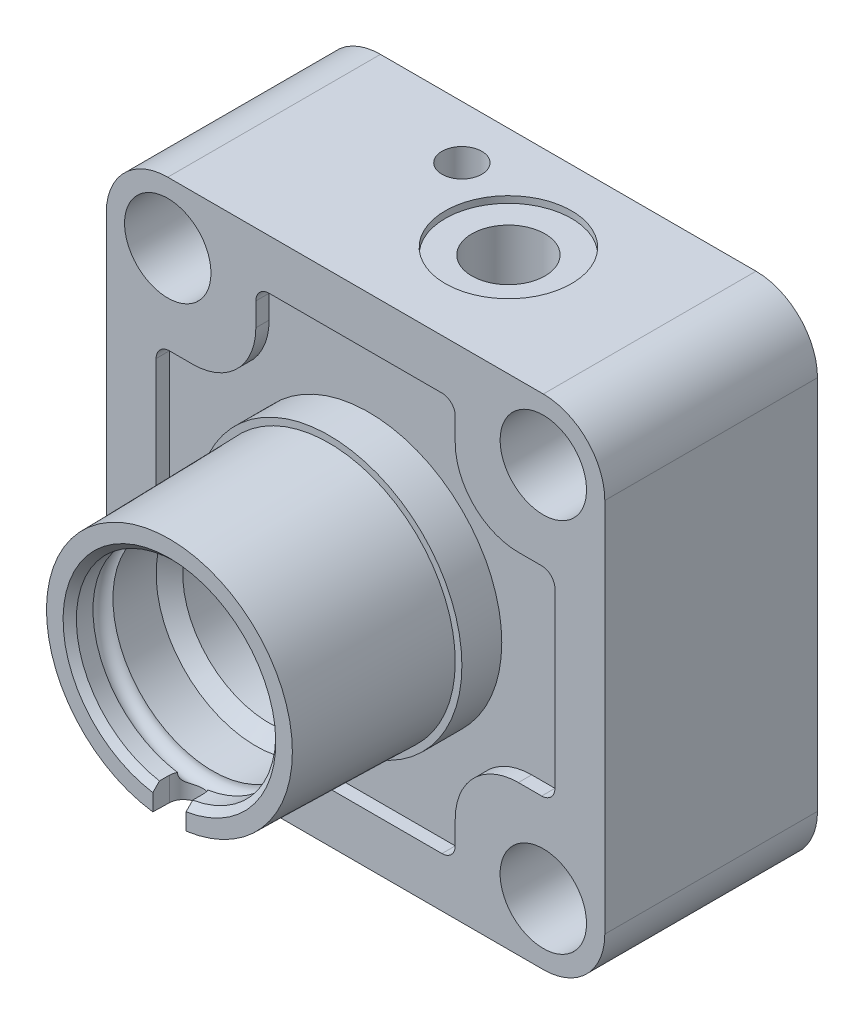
ISO-10303-21;
HEADER;
FILE_DESCRIPTION(('STEP AP214'),'2;1');
FILE_NAME('part.step','',(''),(''),'','','');
FILE_SCHEMA(('AUTOMOTIVE_DESIGN { 1 0 10303 214 1 1 1 1 }'));
ENDSEC;
DATA;
#1=APPLICATION_CONTEXT('core data for automotive mechanical design processes');
#2=APPLICATION_PROTOCOL_DEFINITION('international standard','automotive_design',2000,#1);
#3=PRODUCT_CONTEXT('',#1,'mechanical');
#4=PRODUCT('Part','Part','',(#3));
#5=PRODUCT_RELATED_PRODUCT_CATEGORY('part','',(#4));
#6=PRODUCT_DEFINITION_FORMATION('','',#4);
#7=PRODUCT_DEFINITION_CONTEXT('part definition',#1,'design');
#8=PRODUCT_DEFINITION('design','',#6,#7);
#9=PRODUCT_DEFINITION_SHAPE('','',#8);
#10=(LENGTH_UNIT() NAMED_UNIT(*) SI_UNIT(.MILLI.,.METRE.));
#11=(NAMED_UNIT(*) PLANE_ANGLE_UNIT() SI_UNIT($,.RADIAN.));
#12=(NAMED_UNIT(*) SI_UNIT($,.STERADIAN.) SOLID_ANGLE_UNIT());
#13=UNCERTAINTY_MEASURE_WITH_UNIT(LENGTH_MEASURE(1.E-05),#10,'distance_accuracy_value','');
#14=(GEOMETRIC_REPRESENTATION_CONTEXT(3) GLOBAL_UNCERTAINTY_ASSIGNED_CONTEXT((#13)) GLOBAL_UNIT_ASSIGNED_CONTEXT((#10,
#11,#12)) REPRESENTATION_CONTEXT('',''));
#15=CARTESIAN_POINT('',(0.,0.,0.));
#16=DIRECTION('',(0.,0.,1.));
#17=DIRECTION('',(1.,0.,0.));
#18=AXIS2_PLACEMENT_3D('',#15,#16,#17);
#19=CARTESIAN_POINT('',(0.,0.,-39.5));
#20=DIRECTION('',(0.,0.,1.));
#21=DIRECTION('',(1.,0.,0.));
#22=AXIS2_PLACEMENT_3D('',#19,#20,#21);
#23=CYLINDRICAL_SURFACE('',#22,17.);
#24=CARTESIAN_POINT('',(0.,0.,-27.9999999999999));
#25=DIRECTION('',(0.,0.,-1.));
#26=DIRECTION('',(-1.,0.,0.));
#27=AXIS2_PLACEMENT_3D('',#24,#25,#26);
#28=CIRCLE('',#27,17.);
#29=CARTESIAN_POINT('',(-16.9999999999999,0.,-27.9999999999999));
#30=VERTEX_POINT('',#29);
#31=EDGE_CURVE('E796',#30,#30,#28,.T.);
#32=ORIENTED_EDGE('',*,*,#31,.F.);
#33=EDGE_LOOP('',(#32));
#34=FACE_BOUND('',#33,.T.);
#35=CARTESIAN_POINT('',(0.,0.,-37.5));
#36=DIRECTION('',(0.,0.,-1.));
#37=DIRECTION('',(-1.,0.,0.));
#38=AXIS2_PLACEMENT_3D('',#35,#36,#37);
#39=CIRCLE('',#38,17.);
#40=CARTESIAN_POINT('',(-16.9999999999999,0.,-37.5));
#41=VERTEX_POINT('',#40);
#42=EDGE_CURVE('E30',#41,#41,#39,.T.);
#43=ORIENTED_EDGE('',*,*,#42,.T.);
#44=EDGE_LOOP('',(#43));
#45=FACE_BOUND('',#44,.T.);
#46=ADVANCED_FACE('F26',(#34,#45),#23,.F.);
#47=CARTESIAN_POINT('',(0.,0.,30.));
#48=DIRECTION('',(0.,0.,1.));
#49=DIRECTION('',(1.,0.,0.));
#50=AXIS2_PLACEMENT_3D('',#47,#48,#49);
#51=CYLINDRICAL_SURFACE('',#50,13.);
#52=CARTESIAN_POINT('',(6.50000000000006,11.2583302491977,-10.9999999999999));
#53=CARTESIAN_POINT('',(6.36123098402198,11.3384493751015,-10.9999996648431));
#54=CARTESIAN_POINT('',(6.22098080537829,11.4159960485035,-11.0052535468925));
#55=CARTESIAN_POINT('',(5.9383403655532,11.5655380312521,-11.02691808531));
#56=CARTESIAN_POINT('',(5.79594970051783,11.637532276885,-11.043330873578));
#57=CARTESIAN_POINT('',(5.51003134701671,11.7756006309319,-11.0878927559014));
#58=CARTESIAN_POINT('',(5.36650310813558,11.8416716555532,-11.116047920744));
#59=CARTESIAN_POINT('',(5.07960506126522,11.967545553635,-11.1845298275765));
#60=CARTESIAN_POINT('',(4.93623523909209,12.0273490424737,-11.2248553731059));
#61=CARTESIAN_POINT('',(4.6503520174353,12.1407569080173,-11.31815586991));
#62=CARTESIAN_POINT('',(4.5078452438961,12.1943325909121,-11.3711861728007));
#63=CARTESIAN_POINT('',(4.22579039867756,12.2949223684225,-11.4898723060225));
#64=CARTESIAN_POINT('',(4.08624240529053,12.3419362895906,-11.5555284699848));
#65=CARTESIAN_POINT('',(3.81164687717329,12.4294856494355,-11.699294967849));
#66=CARTESIAN_POINT('',(3.67659816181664,12.470022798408,-11.7774020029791));
#67=CARTESIAN_POINT('',(3.41245002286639,12.5448806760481,-11.9457101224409));
#68=CARTESIAN_POINT('',(3.28335024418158,12.5792017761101,-12.0359104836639));
#69=CARTESIAN_POINT('',(3.0414754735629,12.6397725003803,-12.2209679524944));
#70=CARTESIAN_POINT('',(2.92819310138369,12.6664235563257,-12.3150321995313));
#71=CARTESIAN_POINT('',(2.70897385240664,12.7151120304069,-12.5125330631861));
#72=CARTESIAN_POINT('',(2.60303955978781,12.7371478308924,-12.6159729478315));
#73=CARTESIAN_POINT('',(2.39954518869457,12.7770471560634,-12.8314546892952));
#74=CARTESIAN_POINT('',(2.3019821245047,12.7949121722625,-12.9434934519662));
#75=CARTESIAN_POINT('',(2.11598508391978,12.8269840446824,-13.1754664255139));
#76=CARTESIAN_POINT('',(2.02755455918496,12.8411895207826,-13.2954035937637));
#77=CARTESIAN_POINT('',(1.86106529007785,12.8663703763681,-13.5415815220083));
#78=CARTESIAN_POINT('',(1.78295007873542,12.8773637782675,-13.667782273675));
#79=CARTESIAN_POINT('',(1.6370765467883,12.8967204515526,-13.9262848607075));
#80=CARTESIAN_POINT('',(1.56932197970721,12.9050827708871,-14.0585888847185));
#81=CARTESIAN_POINT('',(1.44472537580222,12.9196247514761,-14.3283048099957));
#82=CARTESIAN_POINT('',(1.38788007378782,12.9258050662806,-14.4657151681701));
#83=CARTESIAN_POINT('',(1.28546561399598,12.9363917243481,-14.7447979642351));
#84=CARTESIAN_POINT('',(1.23990066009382,12.9407974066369,-14.8864719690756));
#85=CARTESIAN_POINT('',(1.15942871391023,12.9482585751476,-15.1765576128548));
#86=CARTESIAN_POINT('',(1.12480686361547,12.9512787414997,-15.3250493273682));
#87=CARTESIAN_POINT('',(1.06799613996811,12.9560872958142,-15.6244646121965));
#88=CARTESIAN_POINT('',(1.0458116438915,12.9578752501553,-15.7753890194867));
#89=CARTESIAN_POINT('',(1.01405355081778,12.9603992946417,-16.0785523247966));
#90=CARTESIAN_POINT('',(1.00447868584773,12.9611354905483,-16.2307910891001));
#91=CARTESIAN_POINT('',(0.998003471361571,12.9616356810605,-16.5355397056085));
#92=CARTESIAN_POINT('',(1.00110318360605,12.9613996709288,-16.6880495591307));
#93=CARTESIAN_POINT('',(1.02005800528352,12.9599218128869,-16.9939336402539));
#94=CARTESIAN_POINT('',(1.03605122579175,12.9586690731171,-17.147299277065));
#95=CARTESIAN_POINT('',(1.08084341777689,12.9550098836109,-17.4520811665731));
#96=CARTESIAN_POINT('',(1.10963799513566,12.9526038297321,-17.603498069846));
#97=CARTESIAN_POINT('',(1.17983589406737,12.9463982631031,-17.903418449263));
#98=CARTESIAN_POINT('',(1.22124443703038,12.9425981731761,-18.0519206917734));
#99=CARTESIAN_POINT('',(1.31634035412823,12.9332721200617,-18.3448230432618));
#100=CARTESIAN_POINT('',(1.37002303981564,12.9277468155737,-18.4892246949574));
#101=CARTESIAN_POINT('',(1.48920545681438,12.9145598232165,-18.7727881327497));
#102=CARTESIAN_POINT('',(1.5546927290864,12.9069003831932,-18.9119552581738));
#103=CARTESIAN_POINT('',(1.6969818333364,12.8889638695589,-19.1841364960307));
#104=CARTESIAN_POINT('',(1.77377922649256,12.8786878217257,-19.3171529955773));
#105=CARTESIAN_POINT('',(1.93810530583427,12.854984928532,-19.5761407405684));
#106=CARTESIAN_POINT('',(2.02563686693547,12.841557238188,-19.7021100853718));
#107=CARTESIAN_POINT('',(2.21063347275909,12.8110062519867,-19.9459755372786));
#108=CARTESIAN_POINT('',(2.30809445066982,12.7938844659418,-20.0638749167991));
#109=CARTESIAN_POINT('',(2.51046865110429,12.7557036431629,-20.2889542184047));
#110=CARTESIAN_POINT('',(2.61523686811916,12.7347123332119,-20.3962760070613));
#111=CARTESIAN_POINT('',(2.83259024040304,12.6881352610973,-20.60151647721));
#112=CARTESIAN_POINT('',(2.94517236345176,12.662551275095,-20.6994387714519));
#113=CARTESIAN_POINT('',(3.17712605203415,12.6063517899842,-20.8852697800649));
#114=CARTESIAN_POINT('',(3.29649711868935,12.5757366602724,-20.9731792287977));
#115=CARTESIAN_POINT('',(3.54088854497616,12.5091224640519,-21.1384718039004));
#116=CARTESIAN_POINT('',(3.66590881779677,12.4731234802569,-21.2158550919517));
#117=CARTESIAN_POINT('',(3.91748612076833,12.3963785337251,-21.3580887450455));
#118=CARTESIAN_POINT('',(4.0439433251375,12.3557593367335,-21.4231843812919));
#119=CARTESIAN_POINT('',(4.29998047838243,12.269003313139,-21.542805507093));
#120=CARTESIAN_POINT('',(4.42956147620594,12.2228646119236,-21.5973273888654));
#121=CARTESIAN_POINT('',(4.69061036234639,12.1250812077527,-21.6957252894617));
#122=CARTESIAN_POINT('',(4.82207760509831,12.0734383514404,-21.7396048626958));
#123=CARTESIAN_POINT('',(5.08588824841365,11.964702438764,-21.8168777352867));
#124=CARTESIAN_POINT('',(5.21823195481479,11.9076073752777,-21.8502671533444));
#125=CARTESIAN_POINT('',(5.48657888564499,11.7864223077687,-21.9076193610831));
#126=CARTESIAN_POINT('',(5.62257649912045,11.7221770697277,-21.93127946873));
#127=CARTESIAN_POINT('',(5.89342189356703,11.5883737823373,-21.9681580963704));
#128=CARTESIAN_POINT('',(6.0282691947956,11.518813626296,-21.9813724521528));
#129=CARTESIAN_POINT('',(6.2959113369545,11.3747351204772,-21.9978473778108));
#130=CARTESIAN_POINT('',(6.42870600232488,11.3002163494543,-22.0011071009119));
#131=CARTESIAN_POINT('',(6.69152585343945,11.1465989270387,-21.9982358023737));
#132=CARTESIAN_POINT('',(6.8215504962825,11.0674993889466,-21.9921029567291));
#133=CARTESIAN_POINT('',(7.12843087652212,10.8733648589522,-21.9669146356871));
#134=CARTESIAN_POINT('',(7.30372169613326,10.7563707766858,-21.9437443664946));
#135=CARTESIAN_POINT('',(7.64661076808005,10.5153841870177,-21.8819751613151));
#136=CARTESIAN_POINT('',(7.81420659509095,10.391389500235,-21.8433713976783));
#137=CARTESIAN_POINT('',(8.14118399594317,10.1372614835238,-21.752177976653));
#138=CARTESIAN_POINT('',(8.30055042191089,10.00711762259,-21.6995635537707));
#139=CARTESIAN_POINT('',(8.61025063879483,9.74192811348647,-21.5817610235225));
#140=CARTESIAN_POINT('',(8.76058437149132,9.60688243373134,-21.5165728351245));
#141=CARTESIAN_POINT('',(9.09480543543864,9.29254869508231,-21.3539622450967));
#142=CARTESIAN_POINT('',(9.27557108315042,9.1119211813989,-21.2526967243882));
#143=CARTESIAN_POINT('',(9.62138461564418,8.74599206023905,-21.0330942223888));
#144=CARTESIAN_POINT('',(9.78642615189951,8.56068860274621,-20.9147503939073));
#145=CARTESIAN_POINT('',(10.1008481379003,8.18733579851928,-20.6622801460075));
#146=CARTESIAN_POINT('',(10.250218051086,7.99928470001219,-20.528143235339));
#147=CARTESIAN_POINT('',(10.5331905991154,7.62281262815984,-20.2447937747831));
#148=CARTESIAN_POINT('',(10.6667997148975,7.43439183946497,-20.0955874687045));
#149=CARTESIAN_POINT('',(10.8738248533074,7.1260957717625,-19.8371466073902));
#150=CARTESIAN_POINT('',(10.9518359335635,7.00551079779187,-19.732402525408));
#151=CARTESIAN_POINT('',(11.1011655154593,6.76638548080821,-19.5160504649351));
#152=CARTESIAN_POINT('',(11.1724852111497,6.64784477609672,-19.4044437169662));
#153=CARTESIAN_POINT('',(11.3081036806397,6.41443386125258,-19.1739462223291));
#154=CARTESIAN_POINT('',(11.3724174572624,6.29955619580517,-19.0550719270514));
#155=CARTESIAN_POINT('',(11.4938018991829,6.07525743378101,-18.8088478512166));
#156=CARTESIAN_POINT('',(11.5508765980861,5.96583331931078,-18.6815028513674));
#157=CARTESIAN_POINT('',(11.6588308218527,5.75208005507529,-18.412626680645));
#158=CARTESIAN_POINT('',(11.709456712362,5.64802224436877,-18.2707738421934));
#159=CARTESIAN_POINT('',(11.8009569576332,5.45425000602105,-17.9744078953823));
#160=CARTESIAN_POINT('',(11.8418369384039,5.3645273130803,-17.8199021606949));
#161=CARTESIAN_POINT('',(11.9036619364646,5.2256388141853,-17.5328921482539));
#162=CARTESIAN_POINT('',(11.9270201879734,5.1718904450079,-17.4031832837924));
#163=CARTESIAN_POINT('',(11.9647491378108,5.08400339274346,-17.1360896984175));
#164=CARTESIAN_POINT('',(11.9791404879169,5.04981966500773,-16.9987234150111));
#165=CARTESIAN_POINT('',(11.9975141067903,5.00602620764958,-16.7175548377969));
#166=CARTESIAN_POINT('',(12.0013717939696,4.9967106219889,-16.5736958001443));
#167=CARTESIAN_POINT('',(11.9977453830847,5.00540788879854,-16.2869436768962));
#168=CARTESIAN_POINT('',(11.9902560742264,5.02343329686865,-16.1440510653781));
#169=CARTESIAN_POINT('',(11.9639534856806,5.08576254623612,-15.8532352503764));
#170=CARTESIAN_POINT('',(11.9442710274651,5.13207915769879,-15.7058440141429));
#171=CARTESIAN_POINT('',(11.8950385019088,5.24517100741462,-15.4208248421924));
#172=CARTESIAN_POINT('',(11.8654615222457,5.31200200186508,-15.283224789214));
#173=CARTESIAN_POINT('',(11.8019380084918,5.45156016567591,-15.0322260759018));
#174=CARTESIAN_POINT('',(11.7688016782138,5.52288367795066,-14.9178152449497));
#175=CARTESIAN_POINT('',(11.697029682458,5.67331025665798,-14.6959812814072));
#176=CARTESIAN_POINT('',(11.658389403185,5.75241983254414,-14.5885641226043));
#177=CARTESIAN_POINT('',(11.5761256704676,5.91622659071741,-14.3797239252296));
#178=CARTESIAN_POINT('',(11.5324913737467,6.00093575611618,-14.2783146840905));
#179=CARTESIAN_POINT('',(11.4406640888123,6.17420810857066,-14.0809773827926));
#180=CARTESIAN_POINT('',(11.3924695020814,6.26277264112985,-13.9850512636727));
#181=CARTESIAN_POINT('',(11.2445274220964,6.5268946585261,-13.7103936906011));
#182=CARTESIAN_POINT('',(11.1388230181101,6.70613671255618,-13.5383808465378));
#183=CARTESIAN_POINT('',(10.9119941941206,7.06925658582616,-13.2100027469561));
#184=CARTESIAN_POINT('',(10.7908577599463,7.25313792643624,-13.0536498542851));
#185=CARTESIAN_POINT('',(10.5331939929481,7.62250716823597,-12.755372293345));
#186=CARTESIAN_POINT('',(10.3966403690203,7.80799730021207,-12.6134730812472));
#187=CARTESIAN_POINT('',(10.1083589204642,8.17777775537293,-12.3444509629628));
#188=CARTESIAN_POINT('',(9.95663595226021,8.36206844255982,-12.2173233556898));
#189=CARTESIAN_POINT('',(9.63219568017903,8.73406417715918,-11.9743085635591));
#190=CARTESIAN_POINT('',(9.45892093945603,8.92165498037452,-11.8589873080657));
#191=CARTESIAN_POINT('',(9.09594395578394,9.29144439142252,-11.6466208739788));
#192=CARTESIAN_POINT('',(8.90623586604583,9.47364104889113,-11.549582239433));
#193=CARTESIAN_POINT('',(8.51180313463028,9.82951722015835,-11.3766432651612));
#194=CARTESIAN_POINT('',(8.30715987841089,10.0032353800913,-11.3006378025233));
#195=CARTESIAN_POINT('',(7.88305135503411,10.3407332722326,-11.172133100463));
#196=CARTESIAN_POINT('',(7.66360286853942,10.5045238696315,-11.1196077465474));
#197=CARTESIAN_POINT('',(7.28671384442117,10.7674377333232,-11.0544019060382));
#198=CARTESIAN_POINT('',(7.13290143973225,10.8699630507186,-11.0342809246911));
#199=CARTESIAN_POINT('',(6.82005983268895,11.0689264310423,-11.0070756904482));
#200=CARTESIAN_POINT('',(6.66102712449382,11.1653602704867,-11.0000003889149));
#201=CARTESIAN_POINT('',(6.50000000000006,11.2583302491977,-10.9999999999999));
#202=B_SPLINE_CURVE_WITH_KNOTS('',3,(#52,#53,#54,#55,#56,#57,#58,#59,#60,#61,#62,#63,#64,#65,
#66,#67,#68,#69,#70,#71,#72,#73,#74,#75,#76,#77,#78,#79,#80,#81,#82,#83,#84,#85,#86,#87,#88,#89,
#90,#91,#92,#93,#94,#95,#96,#97,#98,#99,#100,#101,#102,#103,#104,#105,#106,#107,#108,#109,#110,
#111,#112,#113,#114,#115,#116,#117,#118,#119,#120,#121,#122,#123,#124,#125,#126,#127,#128,#129,
#130,#131,#132,#133,#134,#135,#136,#137,#138,#139,#140,#141,#142,#143,#144,#145,#146,#147,#148,
#149,#150,#151,#152,#153,#154,#155,#156,#157,#158,#159,#160,#161,#162,#163,#164,#165,#166,#167,
#168,#169,#170,#171,#172,#173,#174,#175,#176,#177,#178,#179,#180,#181,#182,#183,#184,#185,#186,
#187,#188,#189,#190,#191,#192,#193,#194,#195,#196,#197,#198,#199,#200,#201),.UNSPECIFIED.,.T.,
.F.,(4,2,2,2,2,2,2,2,2,2,2,2,2,2,2,2,2,2,2,2,2,2,2,2,2,2,2,2,2,2,2,2,2,2,2,2,2,2,2,2,2,2,2,2,2,
2,2,2,2,2,2,2,2,2,2,2,2,2,2,2,2,2,2,2,2,2,2,2,2,2,2,2,2,2,4),(0.,0.48057895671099,
0.961249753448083,1.44216936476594,1.92304171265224,2.40604847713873,2.88906800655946,
3.37195977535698,3.85482268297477,4.30319455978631,4.75172332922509,5.20009145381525,
5.6486284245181,6.09459814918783,6.54072906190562,6.98672623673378,7.43288937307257,
7.88986819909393,8.34700775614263,8.8041013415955,9.2611971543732,9.72325533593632,
10.1851550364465,10.6472461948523,11.109161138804,11.5705913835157,12.0318410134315,
12.493214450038,12.9543996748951,13.4081702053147,13.8617656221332,14.3153277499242,
14.7688829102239,15.2121097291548,15.6554875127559,16.0987170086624,16.5421103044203,
16.9984099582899,17.4548914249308,17.911411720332,18.3680206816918,19.0031435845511,
19.6384653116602,20.2749175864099,20.9113739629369,21.7348579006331,22.5586729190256,
23.3830383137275,24.2070635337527,24.7401063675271,25.2730539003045,25.8048367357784,
26.3363219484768,26.8846494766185,27.4326597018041,27.8582498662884,28.2828561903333,
28.7124630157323,29.1422671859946,29.6069311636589,30.0728694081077,30.4887767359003,
30.9050347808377,31.322214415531,31.7395408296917,32.5482764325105,33.35764554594,
34.1684163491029,34.978928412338,35.818480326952,36.6583321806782,37.4939073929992,
38.3285509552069,38.8858310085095,39.4434933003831),.UNSPECIFIED.);
#203=CARTESIAN_POINT('',(6.50000000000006,11.2583302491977,-10.9999999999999));
#204=VERTEX_POINT('',#203);
#205=EDGE_CURVE('E432',#204,#204,#202,.T.);
#206=ORIENTED_EDGE('',*,*,#205,.F.);
#207=EDGE_LOOP('',(#206));
#208=FACE_BOUND('',#207,.T.);
#209=CARTESIAN_POINT('',(-7.99999999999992,10.2469507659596,-23.25));
#210=CARTESIAN_POINT('',(-8.05004134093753,10.2078820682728,-23.2500000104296));
#211=CARTESIAN_POINT('',(-8.09980246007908,10.1684379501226,-23.25499997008));
#212=CARTESIAN_POINT('',(-8.19762447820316,10.0897425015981,-23.2747833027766));
#213=CARTESIAN_POINT('',(-8.24568257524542,10.0504915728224,-23.2895820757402));
#214=CARTESIAN_POINT('',(-8.34219547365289,9.97055535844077,-23.3304131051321));
#215=CARTESIAN_POINT('',(-8.39042792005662,9.92997143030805,-23.3571799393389));
#216=CARTESIAN_POINT('',(-8.48154424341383,9.85225684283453,-23.4223018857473));
#217=CARTESIAN_POINT('',(-8.52444280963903,9.81511677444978,-23.4606241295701));
#218=CARTESIAN_POINT('',(-8.58688383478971,9.76045200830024,-23.5316604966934));
#219=CARTESIAN_POINT('',(-8.60897280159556,9.74096100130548,-23.5606437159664));
#220=CARTESIAN_POINT('',(-8.64935208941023,9.70512400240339,-23.6228892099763));
#221=CARTESIAN_POINT('',(-8.66764845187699,9.68877301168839,-23.6561445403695));
#222=CARTESIAN_POINT('',(-8.69678114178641,9.66262477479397,-23.7206593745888));
#223=CARTESIAN_POINT('',(-8.70835294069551,9.65218913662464,-23.7513253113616));
#224=CARTESIAN_POINT('',(-8.72753740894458,9.6348460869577,-23.8148326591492));
#225=CARTESIAN_POINT('',(-8.73515231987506,9.627936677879,-23.84767282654));
#226=CARTESIAN_POINT('',(-8.74593168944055,9.61814608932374,-23.9148610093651));
#227=CARTESIAN_POINT('',(-8.74907234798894,9.61528645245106,-23.949216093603));
#228=CARTESIAN_POINT('',(-8.7505718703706,9.61392185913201,-24.0181155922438));
#229=CARTESIAN_POINT('',(-8.74893177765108,9.61541595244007,-24.0526599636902));
#230=CARTESIAN_POINT('',(-8.74136183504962,9.62229778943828,-24.1177327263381));
#231=CARTESIAN_POINT('',(-8.73582301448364,9.6273305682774,-24.1483466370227));
#232=CARTESIAN_POINT('',(-8.72123364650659,9.64054873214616,-24.2080041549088));
#233=CARTESIAN_POINT('',(-8.71218249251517,9.64873466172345,-24.237047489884));
#234=CARTESIAN_POINT('',(-8.69032414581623,9.66842774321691,-24.2949103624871));
#235=CARTESIAN_POINT('',(-8.67730726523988,9.68011950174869,-24.3235866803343));
#236=CARTESIAN_POINT('',(-8.64838330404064,9.70596948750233,-24.3782284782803));
#237=CARTESIAN_POINT('',(-8.63247435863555,9.72012930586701,-24.404192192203));
#238=CARTESIAN_POINT('',(-8.58946799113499,9.75818771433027,-24.4659192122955));
#239=CARTESIAN_POINT('',(-8.5608289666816,9.78334528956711,-24.4998397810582));
#240=CARTESIAN_POINT('',(-8.49954223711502,9.83663774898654,-24.5611092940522));
#241=CARTESIAN_POINT('',(-8.46688545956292,9.86477935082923,-24.5884429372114));
#242=CARTESIAN_POINT('',(-8.38974786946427,9.93052422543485,-24.642937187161));
#243=CARTESIAN_POINT('',(-8.34440142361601,9.96868414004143,-24.6682022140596));
#244=CARTESIAN_POINT('',(-8.25063258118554,10.046431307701,-24.7087271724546));
#245=CARTESIAN_POINT('',(-8.20220935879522,10.0860189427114,-24.7239844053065));
#246=CARTESIAN_POINT('',(-8.10309448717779,10.1658221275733,-24.7446168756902));
#247=CARTESIAN_POINT('',(-8.05238695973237,10.2060401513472,-24.7499063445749));
#248=CARTESIAN_POINT('',(-7.95031603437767,10.2857508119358,-24.7500912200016));
#249=CARTESIAN_POINT('',(-7.89895225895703,10.325242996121,-24.7449803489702));
#250=CARTESIAN_POINT('',(-7.794867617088,10.4040605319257,-24.7234401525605));
#251=CARTESIAN_POINT('',(-7.74218216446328,10.4433070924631,-24.7065378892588));
#252=CARTESIAN_POINT('',(-7.63992174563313,10.5183454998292,-24.6602848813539));
#253=CARTESIAN_POINT('',(-7.59033969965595,10.5541453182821,-24.6309637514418));
#254=CARTESIAN_POINT('',(-7.51267834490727,10.6094835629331,-24.571450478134));
#255=CARTESIAN_POINT('',(-7.48292291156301,10.6304763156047,-24.544775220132));
#256=CARTESIAN_POINT('',(-7.42719509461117,10.6694856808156,-24.4858349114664));
#257=CARTESIAN_POINT('',(-7.40122068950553,10.6875038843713,-24.4535728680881));
#258=CARTESIAN_POINT('',(-7.35412607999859,10.7199654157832,-24.3835880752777));
#259=CARTESIAN_POINT('',(-7.33304787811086,10.7343778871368,-24.3458222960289));
#260=CARTESIAN_POINT('',(-7.29739361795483,10.7586484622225,-24.2659861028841));
#261=CARTESIAN_POINT('',(-7.2828111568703,10.7685110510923,-24.2239199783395));
#262=CARTESIAN_POINT('',(-7.26277483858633,10.7820325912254,-24.1431199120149));
#263=CARTESIAN_POINT('',(-7.2563290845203,10.7863665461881,-24.1047434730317));
#264=CARTESIAN_POINT('',(-7.24948712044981,10.7909663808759,-24.0272216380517));
#265=CARTESIAN_POINT('',(-7.2490870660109,10.791234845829,-23.9880767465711));
#266=CARTESIAN_POINT('',(-7.25410663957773,10.7878608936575,-23.9140274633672));
#267=CARTESIAN_POINT('',(-7.25898744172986,10.7845805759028,-23.8790678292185));
#268=CARTESIAN_POINT('',(-7.27346338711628,10.774822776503,-23.8106106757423));
#269=CARTESIAN_POINT('',(-7.28305835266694,10.7683454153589,-23.7771131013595));
#270=CARTESIAN_POINT('',(-7.30668140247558,10.7523305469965,-23.7118424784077));
#271=CARTESIAN_POINT('',(-7.32078114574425,10.7427435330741,-23.6801077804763));
#272=CARTESIAN_POINT('',(-7.35272796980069,10.720903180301,-23.6195909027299));
#273=CARTESIAN_POINT('',(-7.37057626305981,10.7086489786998,-23.5908096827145));
#274=CARTESIAN_POINT('',(-7.41140571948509,10.6804373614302,-23.5337221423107));
#275=CARTESIAN_POINT('',(-7.43473019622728,10.6642252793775,-23.505788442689));
#276=CARTESIAN_POINT('',(-7.48428206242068,10.6295079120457,-23.454276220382));
#277=CARTESIAN_POINT('',(-7.51051092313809,10.6110014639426,-23.4306999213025));
#278=CARTESIAN_POINT('',(-7.56961090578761,10.5689408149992,-23.3844555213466));
#279=CARTESIAN_POINT('',(-7.60286442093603,10.5450573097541,-23.3625769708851));
#280=CARTESIAN_POINT('',(-7.67126668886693,10.4954017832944,-23.324748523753));
#281=CARTESIAN_POINT('',(-7.70641662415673,10.4696285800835,-23.3088023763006));
#282=CARTESIAN_POINT('',(-7.78427743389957,10.4119053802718,-23.2802919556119));
#283=CARTESIAN_POINT('',(-7.82720335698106,10.3796829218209,-23.2688656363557));
#284=CARTESIAN_POINT('',(-7.91348884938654,10.314050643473,-23.2537178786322));
#285=CARTESIAN_POINT('',(-7.95684860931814,10.280640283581,-23.2499999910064));
#286=CARTESIAN_POINT('',(-7.99999999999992,10.2469507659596,-23.25));
#287=B_SPLINE_CURVE_WITH_KNOTS('',3,(#209,#210,#211,#212,#213,#214,#215,#216,#217,#218,#219,
#220,#221,#222,#223,#224,#225,#226,#227,#228,#229,#230,#231,#232,#233,#234,#235,#236,#237,#238,
#239,#240,#241,#242,#243,#244,#245,#246,#247,#248,#249,#250,#251,#252,#253,#254,#255,#256,#257,
#258,#259,#260,#261,#262,#263,#264,#265,#266,#267,#268,#269,#270,#271,#272,#273,#274,#275,#276,
#277,#278,#279,#280,#281,#282,#283,#284,#285,#286),.UNSPECIFIED.,.T.,.F.,(4,2,2,2,2,2,2,2,2,2,2,
2,2,2,2,2,2,2,2,2,2,2,2,2,2,2,2,2,2,2,2,2,2,2,2,2,2,2,4),(0.,0.190288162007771,
0.380876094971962,0.585238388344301,0.789024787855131,0.912589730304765,1.03595630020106,
1.13872861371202,1.24144264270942,1.3447010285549,1.44793687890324,1.54206926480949,
1.63621791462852,1.73662515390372,1.83709736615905,1.98933233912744,2.14191760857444,
2.3342051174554,2.52654445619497,2.72053137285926,2.91463541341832,3.11700912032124,
3.31890292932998,3.45380952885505,3.58864373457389,3.72459510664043,3.86041217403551,
3.97722269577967,4.09395893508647,4.19981725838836,4.30567159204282,4.41330146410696,
4.520966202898,4.64002531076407,4.75914500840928,4.8978897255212,5.03672197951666,
5.20073474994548,5.36482305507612),.UNSPECIFIED.);
#288=CARTESIAN_POINT('',(-7.99999999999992,10.2469507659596,-23.25));
#289=VERTEX_POINT('',#288);
#290=EDGE_CURVE('E420',#289,#289,#287,.T.);
#291=ORIENTED_EDGE('',*,*,#290,.F.);
#292=EDGE_LOOP('',(#291));
#293=FACE_BOUND('',#292,.T.);
#294=CARTESIAN_POINT('',(0.,0.,13.));
#295=DIRECTION('',(0.,0.,1.));
#296=DIRECTION('',(1.,0.,0.));
#297=AXIS2_PLACEMENT_3D('',#294,#295,#296);
#298=CIRCLE('',#297,13.);
#299=CARTESIAN_POINT('',(13.0000000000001,0.,13.));
#300=VERTEX_POINT('',#299);
#301=EDGE_CURVE('E11',#300,#300,#298,.T.);
#302=ORIENTED_EDGE('',*,*,#301,.T.);
#303=EDGE_LOOP('',(#302));
#304=FACE_BOUND('',#303,.T.);
#305=CARTESIAN_POINT('',(0.,0.,-27.9999999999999));
#306=DIRECTION('',(0.,0.,-1.));
#307=DIRECTION('',(-1.,0.,0.));
#308=AXIS2_PLACEMENT_3D('',#305,#306,#307);
#309=CIRCLE('',#308,13.);
#310=CARTESIAN_POINT('',(-12.9999999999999,0.,-27.9999999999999));
#311=VERTEX_POINT('',#310);
#312=EDGE_CURVE('E795',#311,#311,#309,.T.);
#313=ORIENTED_EDGE('',*,*,#312,.T.);
#314=EDGE_LOOP('',(#313));
#315=FACE_BOUND('',#314,.T.);
#316=ADVANCED_FACE('F441',(#208,#293,#304,#315),#51,.F.);
#317=CARTESIAN_POINT('',(-8.00000000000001,23.5,-24.));
#318=DIRECTION('',(0.,1.,0.));
#319=DIRECTION('',(0.,0.,1.));
#320=AXIS2_PLACEMENT_3D('',#317,#318,#319);
#321=PLANE('',#320);
#322=DIRECTION('',(0.,0.,-1.));
#323=VECTOR('',#322,1.);
#324=CARTESIAN_POINT('',(-7.09861218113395,23.5,-19.5));
#325=LINE('',#324,#323);
#326=CARTESIAN_POINT('',(-7.098612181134,23.5,-22.5));
#327=VERTEX_POINT('',#326);
#328=CARTESIAN_POINT('',(-7.098612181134,23.5,-25.5));
#329=VERTEX_POINT('',#328);
#330=EDGE_CURVE('E413',#327,#329,#325,.T.);
#331=ORIENTED_EDGE('',*,*,#330,.F.);
#332=CARTESIAN_POINT('',(-8.00000000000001,23.5,-24.));
#333=DIRECTION('',(0.,1.,0.));
#334=DIRECTION('',(0.,0.,1.));
#335=AXIS2_PLACEMENT_3D('',#332,#333,#334);
#336=CIRCLE('',#335,1.75);
#337=EDGE_CURVE('E412',#327,#329,#336,.T.);
#338=ORIENTED_EDGE('',*,*,#337,.T.);
#339=EDGE_LOOP('',(#331,#338));
#340=FACE_BOUND('',#339,.T.);
#341=ADVANCED_FACE('F623',(#340),#321,.T.);
#342=CARTESIAN_POINT('',(0.,0.,28.));
#343=DIRECTION('',(0.,0.,1.));
#344=DIRECTION('',(1.,0.,0.));
#345=AXIS2_PLACEMENT_3D('',#342,#343,#344);
#346=PLANE('',#345);
#347=DIRECTION('',(0.,-1.,0.));
#348=VECTOR('',#347,1.);
#349=CARTESIAN_POINT('',(-2.49999999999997,0.,28.));
#350=LINE('',#349,#348);
#351=CARTESIAN_POINT('',(-2.49999999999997,-15.8034806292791,28.));
#352=VERTEX_POINT('',#351);
#353=CARTESIAN_POINT('',(-2.5,-18.3275491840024,28.));
#354=VERTEX_POINT('',#353);
#355=EDGE_CURVE('E1086',#352,#354,#350,.T.);
#356=ORIENTED_EDGE('',*,*,#355,.F.);
#357=CARTESIAN_POINT('',(0.,0.,28.));
#358=DIRECTION('',(0.,0.,1.));
#359=DIRECTION('',(1.,0.,0.));
#360=AXIS2_PLACEMENT_3D('',#357,#358,#359);
#361=CIRCLE('',#360,16.);
#362=CARTESIAN_POINT('',(2.5,-15.8034806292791,28.));
#363=VERTEX_POINT('',#362);
#364=EDGE_CURVE('E43',#352,#363,#361,.F.);
#365=ORIENTED_EDGE('',*,*,#364,.T.);
#366=DIRECTION('',(0.,1.,0.));
#367=VECTOR('',#366,1.);
#368=CARTESIAN_POINT('',(2.49999999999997,0.,28.));
#369=LINE('',#368,#367);
#370=CARTESIAN_POINT('',(2.5,-18.3275491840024,28.));
#371=VERTEX_POINT('',#370);
#372=EDGE_CURVE('E876',#371,#363,#369,.T.);
#373=ORIENTED_EDGE('',*,*,#372,.F.);
#374=CARTESIAN_POINT('',(0.,0.,28.));
#375=DIRECTION('',(0.,0.,1.));
#376=DIRECTION('',(1.,0.,0.));
#377=AXIS2_PLACEMENT_3D('',#374,#375,#376);
#378=CIRCLE('',#377,18.4972716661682);
#379=EDGE_CURVE('E1026',#371,#354,#378,.T.);
#380=ORIENTED_EDGE('',*,*,#379,.T.);
#381=EDGE_LOOP('',(#356,#365,#373,#380));
#382=FACE_BOUND('',#381,.T.);
#383=ADVANCED_FACE('F863',(#382),#346,.T.);
#384=CARTESIAN_POINT('',(0.,-37.5,25.5));
#385=DIRECTION('',(0.,1.,0.));
#386=DIRECTION('',(0.,0.,1.));
#387=AXIS2_PLACEMENT_3D('',#384,#385,#386);
#388=CYLINDRICAL_SURFACE('',#387,2.5);
#389=CARTESIAN_POINT('',(0.,-15.,28.));
#390=CARTESIAN_POINT('',(-0.139390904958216,-14.9999976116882,27.9999944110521));
#391=CARTESIAN_POINT('',(-0.278857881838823,-14.9980367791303,27.9883027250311));
#392=CARTESIAN_POINT('',(-0.553880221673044,-14.9904034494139,27.9418643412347));
#393=CARTESIAN_POINT('',(-0.689431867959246,-14.9847275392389,27.9070964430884));
#394=CARTESIAN_POINT('',(-0.952604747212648,-14.9703006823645,27.8155845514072));
#395=CARTESIAN_POINT('',(-1.08023236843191,-14.9615522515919,27.7588585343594));
#396=CARTESIAN_POINT('',(-1.32414184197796,-14.9419422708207,27.6250877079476));
#397=CARTESIAN_POINT('',(-1.44042498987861,-14.9310809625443,27.548045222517));
#398=CARTESIAN_POINT('',(-1.65947261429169,-14.9083331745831,27.3750449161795));
#399=CARTESIAN_POINT('',(-1.76211290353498,-14.8964387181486,27.2789308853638));
#400=CARTESIAN_POINT('',(-1.94988849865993,-14.8730262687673,27.0708520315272));
#401=CARTESIAN_POINT('',(-2.03502269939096,-14.8615082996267,26.9588862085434));
#402=CARTESIAN_POINT('',(-2.18586712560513,-14.8400756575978,26.7214290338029));
#403=CARTESIAN_POINT('',(-2.251454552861,-14.8301712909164,26.5958586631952));
#404=CARTESIAN_POINT('',(-2.36055836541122,-14.8131978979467,26.3352904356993));
#405=CARTESIAN_POINT('',(-2.40407624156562,-14.806128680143,26.2002932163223));
#406=CARTESIAN_POINT('',(-2.46741437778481,-14.7957053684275,25.9260197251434));
#407=CARTESIAN_POINT('',(-2.4874490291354,-14.792317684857,25.7867942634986));
#408=CARTESIAN_POINT('',(-2.50391672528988,-14.7895393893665,25.5069197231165));
#409=CARTESIAN_POINT('',(-2.50035144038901,-14.7901484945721,25.3662707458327));
#410=CARTESIAN_POINT('',(-2.46989509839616,-14.7952642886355,25.0890721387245));
#411=CARTESIAN_POINT('',(-2.44324488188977,-14.7997307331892,24.9524951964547));
#412=CARTESIAN_POINT('',(-2.36775314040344,-14.8119949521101,24.6857786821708));
#413=CARTESIAN_POINT('',(-2.31891085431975,-14.8197928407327,24.5556393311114));
#414=CARTESIAN_POINT('',(-2.20017724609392,-14.837884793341,24.3047711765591));
#415=CARTESIAN_POINT('',(-2.13018591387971,-14.8481906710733,24.1840905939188));
#416=CARTESIAN_POINT('',(-1.97121201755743,-14.8701291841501,23.9560955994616));
#417=CARTESIAN_POINT('',(-1.88222792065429,-14.8817619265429,23.848782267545));
#418=CARTESIAN_POINT('',(-1.68648221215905,-14.9052202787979,23.6491739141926));
#419=CARTESIAN_POINT('',(-1.57951396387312,-14.9170464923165,23.5570814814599));
#420=CARTESIAN_POINT('',(-1.35153524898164,-14.9394260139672,23.3921222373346));
#421=CARTESIAN_POINT('',(-1.23052469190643,-14.9499793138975,23.3192555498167));
#422=CARTESIAN_POINT('',(-0.977705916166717,-14.9686389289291,23.1947977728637));
#423=CARTESIAN_POINT('',(-0.845888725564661,-14.9767431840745,23.1432245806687));
#424=CARTESIAN_POINT('',(-0.575298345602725,-14.9895750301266,23.063005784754));
#425=CARTESIAN_POINT('',(-0.436525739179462,-14.9943029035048,23.0343582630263));
#426=CARTESIAN_POINT('',(-0.157709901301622,-14.9998112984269,23.0010786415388));
#427=CARTESIAN_POINT('',(-0.0177007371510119,-15.0006375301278,22.9961684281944));
#428=CARTESIAN_POINT('',(0.261139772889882,-14.9983747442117,23.0097613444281));
#429=CARTESIAN_POINT('',(0.399971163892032,-14.9952858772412,23.0282635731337));
#430=CARTESIAN_POINT('',(0.671656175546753,-14.985568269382,23.0879248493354));
#431=CARTESIAN_POINT('',(0.804540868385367,-14.9789610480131,23.1289462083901));
#432=CARTESIAN_POINT('',(1.06154688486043,-14.9629446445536,23.2323345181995));
#433=CARTESIAN_POINT('',(1.18566771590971,-14.9535353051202,23.2947026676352));
#434=CARTESIAN_POINT('',(1.42283068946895,-14.9328451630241,23.4396511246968));
#435=CARTESIAN_POINT('',(1.53576525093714,-14.9215485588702,23.5224051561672));
#436=CARTESIAN_POINT('',(1.74624358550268,-14.898384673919,23.705537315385));
#437=CARTESIAN_POINT('',(1.84378623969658,-14.8865173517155,23.8059167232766));
#438=CARTESIAN_POINT('',(2.021742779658,-14.8634017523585,24.0226975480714));
#439=CARTESIAN_POINT('',(2.10196876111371,-14.8521611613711,24.1392541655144));
#440=CARTESIAN_POINT('',(2.24170231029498,-14.8317152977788,24.3843529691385));
#441=CARTESIAN_POINT('',(2.30121053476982,-14.8225099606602,24.5128947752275));
#442=CARTESIAN_POINT('',(2.39753833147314,-14.807234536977,24.7777897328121));
#443=CARTESIAN_POINT('',(2.43445143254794,-14.8011515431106,24.9141080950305));
#444=CARTESIAN_POINT('',(2.48483545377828,-14.7927771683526,25.1911201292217));
#445=CARTESIAN_POINT('',(2.49830841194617,-14.7904854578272,25.331813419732));
#446=CARTESIAN_POINT('',(2.50137286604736,-14.7899673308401,25.6117051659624));
#447=CARTESIAN_POINT('',(2.49126013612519,-14.7916905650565,25.7509003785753));
#448=CARTESIAN_POINT('',(2.44807983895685,-14.7988978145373,26.0255792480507));
#449=CARTESIAN_POINT('',(2.41501234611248,-14.8043818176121,26.1610629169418));
#450=CARTESIAN_POINT('',(2.32697448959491,-14.8184735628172,26.4243584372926));
#451=CARTESIAN_POINT('',(2.27202959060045,-14.8270776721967,26.552179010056));
#452=CARTESIAN_POINT('',(2.14182700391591,-14.8464436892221,26.7968356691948));
#453=CARTESIAN_POINT('',(2.06656830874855,-14.857205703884,26.9136712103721));
#454=CARTESIAN_POINT('',(1.89681888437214,-14.8798345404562,27.1345355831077));
#455=CARTESIAN_POINT('',(1.80211056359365,-14.891712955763,27.2383960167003));
#456=CARTESIAN_POINT('',(1.59660903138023,-14.9151437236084,27.4288516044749));
#457=CARTESIAN_POINT('',(1.48581211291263,-14.9266960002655,27.5154427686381));
#458=CARTESIAN_POINT('',(1.25036916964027,-14.9482652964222,27.6694482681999));
#459=CARTESIAN_POINT('',(1.12563278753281,-14.958271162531,27.7367260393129));
#460=CARTESIAN_POINT('',(0.866513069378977,-14.9755116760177,27.8492694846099));
#461=CARTESIAN_POINT('',(0.73213949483,-14.9827490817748,27.8945570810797));
#462=CARTESIAN_POINT('',(0.49770331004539,-14.9920579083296,27.9520052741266));
#463=CARTESIAN_POINT('',(0.399058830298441,-14.9950202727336,27.9699744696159));
#464=CARTESIAN_POINT('',(0.200289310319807,-14.9989921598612,27.9939737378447));
#465=CARTESIAN_POINT('',(0.100164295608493,-15.0000017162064,28.0000040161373));
#466=CARTESIAN_POINT('',(0.,-15.,28.));
#467=B_SPLINE_CURVE_WITH_KNOTS('',3,(#389,#390,#391,#392,#393,#394,#395,#396,#397,#398,#399,
#400,#401,#402,#403,#404,#405,#406,#407,#408,#409,#410,#411,#412,#413,#414,#415,#416,#417,#418,
#419,#420,#421,#422,#423,#424,#425,#426,#427,#428,#429,#430,#431,#432,#433,#434,#435,#436,#437,
#438,#439,#440,#441,#442,#443,#444,#445,#446,#447,#448,#449,#450,#451,#452,#453,#454,#455,#456,
#457,#458,#459,#460,#461,#462,#463,#464,#465,#466),.UNSPECIFIED.,.T.,.F.,(4,2,2,2,2,2,2,2,2,2,2,
2,2,2,2,2,2,2,2,2,2,2,2,2,2,2,2,2,2,2,2,2,2,2,2,2,2,2,4),(0.,0.41780658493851,0.835997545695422,
1.25384686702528,1.67164841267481,2.09302491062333,2.51442800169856,2.9384252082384,
3.36239376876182,3.78246077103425,4.20249804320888,4.6182052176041,5.03392665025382,
5.45164556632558,5.86939820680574,6.29232769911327,6.71525991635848,7.13854688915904,
7.5617984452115,7.98007883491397,8.39834313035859,8.81407807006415,9.22983635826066,
9.64926825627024,10.0687306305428,10.4925382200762,10.9163323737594,11.3383602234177,
11.7603513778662,12.177079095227,12.5938054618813,13.0100481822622,13.4263115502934,
13.8475138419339,14.2688133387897,14.693022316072,15.1168075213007,15.4170424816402,
15.7172722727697),.UNSPECIFIED.);
#468=CARTESIAN_POINT('',(-2.5,-14.790199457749,25.5));
#469=VERTEX_POINT('',#468);
#470=CARTESIAN_POINT('',(-2.29128784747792,-14.8239670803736,24.5));
#471=VERTEX_POINT('',#470);
#472=EDGE_CURVE('E886',#469,#471,#467,.T.);
#473=ORIENTED_EDGE('',*,*,#472,.F.);
#474=DIRECTION('',(0.,1.,0.));
#475=VECTOR('',#474,1.);
#476=CARTESIAN_POINT('',(-2.49999999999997,-37.5,25.5));
#477=LINE('',#476,#475);
#478=CARTESIAN_POINT('',(-2.5,-18.3804002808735,25.5));
#479=VERTEX_POINT('',#478);
#480=EDGE_CURVE('E847',#479,#469,#477,.T.);
#481=ORIENTED_EDGE('',*,*,#480,.F.);
#482=CARTESIAN_POINT('',(2.49999999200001,-18.3803960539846,25.5002));
#483=CARTESIAN_POINT('',(2.5000126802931,-18.3818735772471,25.4300833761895));
#484=CARTESIAN_POINT('',(2.49706146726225,-18.3837599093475,25.3599791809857));
#485=CARTESIAN_POINT('',(2.48529057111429,-18.3883090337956,25.2202969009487));
#486=CARTESIAN_POINT('',(2.47647143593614,-18.3909717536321,25.1507187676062));
#487=CARTESIAN_POINT('',(2.45303696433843,-18.3970294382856,25.0126529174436));
#488=CARTESIAN_POINT('',(2.43842804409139,-18.4004235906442,24.944164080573));
#489=CARTESIAN_POINT('',(2.40354046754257,-18.4078747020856,24.8087028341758));
#490=CARTESIAN_POINT('',(2.3832618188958,-18.4119316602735,24.7417304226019));
#491=CARTESIAN_POINT('',(2.31410892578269,-18.4249763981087,24.5437588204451));
#492=CARTESIAN_POINT('',(2.25690248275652,-18.4348421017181,24.415616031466));
#493=CARTESIAN_POINT('',(2.12200466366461,-18.4560158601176,24.1708446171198));
#494=CARTESIAN_POINT('',(2.04431402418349,-18.4673238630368,24.0542155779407));
#495=CARTESIAN_POINT('',(1.8700106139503,-18.4904079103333,23.8348258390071));
#496=CARTESIAN_POINT('',(1.77327613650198,-18.5021865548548,23.7321619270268));
#497=CARTESIAN_POINT('',(1.56388396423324,-18.5250045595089,23.5444844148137));
#498=CARTESIAN_POINT('',(1.45122405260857,-18.5360438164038,23.4594732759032));
#499=CARTESIAN_POINT('',(1.21280146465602,-18.5563214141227,23.3093368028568));
#500=CARTESIAN_POINT('',(1.08700687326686,-18.5655552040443,23.2442614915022));
#501=CARTESIAN_POINT('',(0.826105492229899,-18.5812570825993,23.1362146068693));
#502=CARTESIAN_POINT('',(0.69099979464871,-18.587725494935,23.0932404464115));
#503=CARTESIAN_POINT('',(0.416577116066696,-18.5971947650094,23.0309750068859));
#504=CARTESIAN_POINT('',(0.277307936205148,-18.6002257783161,23.0114776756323));
#505=CARTESIAN_POINT('',(-0.00255954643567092,-18.6026149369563,22.9960766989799));
#506=CARTESIAN_POINT('',(-0.143157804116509,-18.6019732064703,23.0001722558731));
#507=CARTESIAN_POINT('',(-0.420476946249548,-18.597102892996,23.0316975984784));
#508=CARTESIAN_POINT('',(-0.557220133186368,-18.5929036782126,23.0589363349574));
#509=CARTESIAN_POINT('',(-0.824168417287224,-18.5813760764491,23.13567443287));
#510=CARTESIAN_POINT('',(-0.954373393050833,-18.5740476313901,23.1851742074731));
#511=CARTESIAN_POINT('',(-1.20514055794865,-18.5569485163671,23.305224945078));
#512=CARTESIAN_POINT('',(-1.32566276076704,-18.5471683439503,23.3758580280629));
#513=CARTESIAN_POINT('',(-1.55320551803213,-18.5261334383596,23.5360962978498));
#514=CARTESIAN_POINT('',(-1.66022573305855,-18.5148786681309,23.6257019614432));
#515=CARTESIAN_POINT('',(-1.85890810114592,-18.49185215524,23.8224394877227));
#516=CARTESIAN_POINT('',(-1.95039868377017,-18.4800762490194,23.9297441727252));
#517=CARTESIAN_POINT('',(-2.11413055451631,-18.4572447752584,24.1582801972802));
#518=CARTESIAN_POINT('',(-2.18636578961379,-18.4461894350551,24.2795158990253));
#519=CARTESIAN_POINT('',(-2.3096959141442,-18.4258050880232,24.5329216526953));
#520=CARTESIAN_POINT('',(-2.36071945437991,-18.4164819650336,24.6651268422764));
#521=CARTESIAN_POINT('',(-2.43969545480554,-18.4004578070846,24.9362964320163));
#522=CARTESIAN_POINT('',(-2.46768301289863,-18.393752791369,25.0752502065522));
#523=CARTESIAN_POINT('',(-2.48917354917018,-18.3868853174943,25.2627351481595));
#524=CARTESIAN_POINT('',(-2.49323831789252,-18.3853315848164,25.3101717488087));
#525=CARTESIAN_POINT('',(-2.49864984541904,-18.3825896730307,25.4051308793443));
#526=CARTESIAN_POINT('',(-2.50000112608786,-18.3814008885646,25.4526531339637));
#527=CARTESIAN_POINT('',(-2.49999999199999,-18.3803960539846,25.5002));
#528=B_SPLINE_CURVE_WITH_KNOTS('',3,(#482,#483,#484,#485,#486,#487,#488,#489,#490,#491,#492,
#493,#494,#495,#496,#497,#498,#499,#500,#501,#502,#503,#504,#505,#506,#507,#508,#509,#510,#511,
#512,#513,#514,#515,#516,#517,#518,#519,#520,#521,#522,#523,#524,#525,#526,#527),.UNSPECIFIED.,
.F.,.F.,(4,2,2,2,2,2,2,2,2,2,2,2,2,2,2,2,2,2,2,2,2,2,4),(0.,0.210326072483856,0.420632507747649,
0.630706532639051,0.840780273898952,1.26065932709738,1.6805232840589,2.10316314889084,
2.52586190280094,2.9496127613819,3.37331400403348,3.79326873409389,4.21320926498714,
4.6297164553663,5.04623137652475,5.46438629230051,5.88255171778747,6.3050725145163,
6.72772597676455,7.15178982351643,7.57520635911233,7.71805583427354,7.86066706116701),.UNSPECIFIED.);
#529=CARTESIAN_POINT('',(2.5,-18.3804002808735,25.5));
#530=VERTEX_POINT('',#529);
#531=EDGE_CURVE('E868',#530,#479,#528,.T.);
#532=ORIENTED_EDGE('',*,*,#531,.F.);
#533=DIRECTION('',(0.,1.,0.));
#534=VECTOR('',#533,1.);
#535=CARTESIAN_POINT('',(2.5,-37.5,25.5));
#536=LINE('',#535,#534);
#537=CARTESIAN_POINT('',(2.5,-14.790199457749,25.5));
#538=VERTEX_POINT('',#537);
#539=EDGE_CURVE('E848',#530,#538,#536,.T.);
#540=ORIENTED_EDGE('',*,*,#539,.T.);
#541=CARTESIAN_POINT('',(2.29128784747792,-14.8239670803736,24.5));
#542=VERTEX_POINT('',#541);
#543=EDGE_CURVE('E893',#542,#538,#467,.T.);
#544=ORIENTED_EDGE('',*,*,#543,.F.);
#545=CARTESIAN_POINT('',(-1.71064073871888,-16.2487874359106,23.6768960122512));
#546=CARTESIAN_POINT('',(-1.66757697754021,-16.2738711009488,23.6364851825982));
#547=CARTESIAN_POINT('',(-1.6222675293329,-16.2962884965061,23.596854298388));
#548=CARTESIAN_POINT('',(-1.52759537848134,-16.3363760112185,23.5200588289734));
#549=CARTESIAN_POINT('',(-1.47823036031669,-16.3540433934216,23.4828956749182));
#550=CARTESIAN_POINT('',(-1.37591210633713,-16.3852766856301,23.4117577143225));
#551=CARTESIAN_POINT('',(-1.32295297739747,-16.3988356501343,23.3777883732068));
#552=CARTESIAN_POINT('',(-1.21403301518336,-16.4224913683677,23.3136501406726));
#553=CARTESIAN_POINT('',(-1.15807077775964,-16.4325864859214,23.2834830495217));
#554=CARTESIAN_POINT('',(-1.00314418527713,-16.4561240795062,23.2075077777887));
#555=CARTESIAN_POINT('',(-0.901763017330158,-16.466883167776,23.1657300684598));
#556=CARTESIAN_POINT('',(-0.69414313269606,-16.4830696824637,23.0958014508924));
#557=CARTESIAN_POINT('',(-0.587908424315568,-16.4885014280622,23.0676395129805));
#558=CARTESIAN_POINT('',(-0.415754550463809,-16.4945536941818,23.0339343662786));
#559=CARTESIAN_POINT('',(-0.350724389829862,-16.4962298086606,23.0238495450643));
#560=CARTESIAN_POINT('',(-0.220038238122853,-16.4986558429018,23.0088342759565));
#561=CARTESIAN_POINT('',(-0.154382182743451,-16.4994056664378,23.0039043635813));
#562=CARTESIAN_POINT('',(-0.0228234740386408,-16.5001168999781,22.9992368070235));
#563=CARTESIAN_POINT('',(0.0430793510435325,-16.5000775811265,22.9995039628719));
#564=CARTESIAN_POINT('',(0.174654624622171,-16.4992003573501,23.0052390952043));
#565=CARTESIAN_POINT('',(0.240327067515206,-16.4983624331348,23.0107071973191));
#566=CARTESIAN_POINT('',(0.374501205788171,-16.495669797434,23.0272369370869));
#567=CARTESIAN_POINT('',(0.442967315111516,-16.4937633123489,23.0385809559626));
#568=CARTESIAN_POINT('',(0.578677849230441,-16.488562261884,23.0669077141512));
#569=CARTESIAN_POINT('',(0.645922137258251,-16.4852675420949,23.0838910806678));
#570=CARTESIAN_POINT('',(0.778621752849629,-16.4767983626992,23.1233357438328));
#571=CARTESIAN_POINT('',(0.844078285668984,-16.4716252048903,23.1457932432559));
#572=CARTESIAN_POINT('',(0.972695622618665,-16.4587684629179,23.1959525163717));
#573=CARTESIAN_POINT('',(1.03585612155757,-16.4510845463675,23.2236549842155));
#574=CARTESIAN_POINT('',(1.19570320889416,-16.4269751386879,23.3017774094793));
#575=CARTESIAN_POINT('',(1.29023377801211,-16.4080665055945,23.3559695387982));
#576=CARTESIAN_POINT('',(1.46930463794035,-16.3586993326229,23.4745043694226));
#577=CARTESIAN_POINT('',(1.55386040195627,-16.3282589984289,23.5388309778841));
#578=CARTESIAN_POINT('',(1.69830042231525,-16.2584951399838,23.6633141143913));
#579=CARTESIAN_POINT('',(1.75997681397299,-16.2212856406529,23.7225665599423));
#580=CARTESIAN_POINT('',(1.87310421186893,-16.1349666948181,23.8422155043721));
#581=CARTESIAN_POINT('',(1.92455885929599,-16.0858614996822,23.9026115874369));
#582=CARTESIAN_POINT('',(2.01677245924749,-15.975136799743,24.02071689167));
#583=CARTESIAN_POINT('',(2.05748465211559,-15.91346459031,24.0784134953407));
#584=CARTESIAN_POINT('',(2.12813103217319,-15.778587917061,24.1865140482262));
#585=CARTESIAN_POINT('',(2.15806566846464,-15.705383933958,24.2369183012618));
#586=CARTESIAN_POINT('',(2.20609741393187,-15.5557381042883,24.3229801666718));
#587=CARTESIAN_POINT('',(2.22495409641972,-15.4800326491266,24.3594988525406));
#588=CARTESIAN_POINT('',(2.25535063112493,-15.3226407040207,24.4208458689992));
#589=CARTESIAN_POINT('',(2.26689134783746,-15.2409549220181,24.445675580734));
#590=CARTESIAN_POINT('',(2.28318946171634,-15.0766841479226,24.4814604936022));
#591=CARTESIAN_POINT('',(2.28815019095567,-14.9942096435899,24.4928303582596));
#592=CARTESIAN_POINT('',(2.29226254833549,-14.8283328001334,24.5022209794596));
#593=CARTESIAN_POINT('',(2.29141438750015,-14.7449304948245,24.5002422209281));
#594=CARTESIAN_POINT('',(2.28377255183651,-14.5828612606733,24.4829125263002));
#595=CARTESIAN_POINT('',(2.27719627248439,-14.5041324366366,24.4680506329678));
#596=CARTESIAN_POINT('',(2.25759734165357,-14.3509250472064,24.4258518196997));
#597=CARTESIAN_POINT('',(2.24457861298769,-14.2764439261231,24.3985224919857));
#598=CARTESIAN_POINT('',(2.21214931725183,-14.1397861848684,24.3348533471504));
#599=CARTESIAN_POINT('',(2.19327617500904,-14.0771079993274,24.2993191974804));
#600=CARTESIAN_POINT('',(2.14802805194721,-13.9601836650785,24.2201410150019));
#601=CARTESIAN_POINT('',(2.12166039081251,-13.9059293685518,24.1765049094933));
#602=CARTESIAN_POINT('',(2.06353264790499,-13.8118677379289,24.0877714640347));
#603=CARTESIAN_POINT('',(2.03243784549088,-13.7712159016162,24.0431284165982));
#604=CARTESIAN_POINT('',(1.96366590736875,-13.6989503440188,23.9516836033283));
#605=CARTESIAN_POINT('',(1.92598829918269,-13.6673372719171,23.9048816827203));
#606=CARTESIAN_POINT('',(1.84413343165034,-13.6124526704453,23.8108858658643));
#607=CARTESIAN_POINT('',(1.79987882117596,-13.5892936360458,23.7636946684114));
#608=CARTESIAN_POINT('',(1.70608718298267,-13.5507349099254,23.671448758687));
#609=CARTESIAN_POINT('',(1.65654645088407,-13.5353407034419,23.6263955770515));
#610=CARTESIAN_POINT('',(1.56326251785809,-13.5132262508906,23.5482937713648));
#611=CARTESIAN_POINT('',(1.52028710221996,-13.5053971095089,23.5146234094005));
#612=CARTESIAN_POINT('',(1.4319055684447,-13.4929765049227,23.4499635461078));
#613=CARTESIAN_POINT('',(1.38649819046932,-13.4883867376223,23.4189754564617));
#614=CARTESIAN_POINT('',(1.24700554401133,-13.478305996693,23.3304154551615));
#615=CARTESIAN_POINT('',(1.14975968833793,-13.4765251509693,23.277340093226));
#616=CARTESIAN_POINT('',(0.945487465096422,-13.4776662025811,23.1828405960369));
#617=CARTESIAN_POINT('',(0.838231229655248,-13.4807666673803,23.1419270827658));
#618=CARTESIAN_POINT('',(0.619182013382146,-13.4877489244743,23.0751923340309));
#619=CARTESIAN_POINT('',(0.507392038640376,-13.4916302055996,23.0493612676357));
#620=CARTESIAN_POINT('',(0.325359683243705,-13.4963573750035,23.0202743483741));
#621=CARTESIAN_POINT('',(0.25587402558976,-13.497796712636,23.0121453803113));
#622=CARTESIAN_POINT('',(0.116430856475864,-13.4996684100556,23.0017349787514));
#623=CARTESIAN_POINT('',(0.0464732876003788,-13.5001006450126,22.99945427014));
#624=CARTESIAN_POINT('',(-0.0934398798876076,-13.4998585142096,23.0007663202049));
#625=CARTESIAN_POINT('',(-0.163395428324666,-13.4991832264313,23.0043639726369));
#626=CARTESIAN_POINT('',(-0.302738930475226,-13.4968717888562,23.0174115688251));
#627=CARTESIAN_POINT('',(-0.372126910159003,-13.4952356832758,23.026861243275));
#628=CARTESIAN_POINT('',(-0.509300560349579,-13.4913958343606,23.0514433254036));
#629=CARTESIAN_POINT('',(-0.577094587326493,-13.4891967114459,23.0665299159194));
#630=CARTESIAN_POINT('',(-0.711201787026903,-13.4848097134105,23.1022908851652));
#631=CARTESIAN_POINT('',(-0.777514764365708,-13.4826218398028,23.1229659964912));
#632=CARTESIAN_POINT('',(-0.908193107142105,-13.4790483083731,23.1697642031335));
#633=CARTESIAN_POINT('',(-0.972559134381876,-13.4776623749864,23.1958854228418));
#634=CARTESIAN_POINT('',(-1.09888153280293,-13.4766912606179,23.253385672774));
#635=CARTESIAN_POINT('',(-1.1608387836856,-13.4771054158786,23.2847627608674));
#636=CARTESIAN_POINT('',(-1.30644244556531,-13.4817001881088,23.3662940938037));
#637=CARTESIAN_POINT('',(-1.38870175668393,-13.4873393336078,23.4189044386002));
#638=CARTESIAN_POINT('',(-1.54561739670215,-13.5085706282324,23.5326673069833));
#639=CARTESIAN_POINT('',(-1.62029059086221,-13.5241401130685,23.5938001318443));
#640=CARTESIAN_POINT('',(-1.74356871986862,-13.5643774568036,23.7068855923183));
#641=CARTESIAN_POINT('',(-1.79419627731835,-13.58608512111,23.7576642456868));
#642=CARTESIAN_POINT('',(-1.88848321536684,-13.6397039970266,23.8603434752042));
#643=CARTESIAN_POINT('',(-1.93214798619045,-13.6716072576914,23.9122431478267));
#644=CARTESIAN_POINT('',(-2.0118646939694,-13.7467081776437,24.0145233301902));
#645=CARTESIAN_POINT('',(-2.0478620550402,-13.7899822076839,24.0648908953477));
#646=CARTESIAN_POINT('',(-2.11155191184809,-13.8871807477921,24.1603522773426));
#647=CARTESIAN_POINT('',(-2.13924477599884,-13.9411047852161,24.2054463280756));
#648=CARTESIAN_POINT('',(-2.18424571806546,-14.0514936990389,24.2830892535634));
#649=CARTESIAN_POINT('',(-2.20235086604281,-14.1070599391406,24.3164660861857));
#650=CARTESIAN_POINT('',(-2.23303702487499,-14.2235766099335,24.3754320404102));
#651=CARTESIAN_POINT('',(-2.24561725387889,-14.2845278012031,24.4010200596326));
#652=CARTESIAN_POINT('',(-2.26632384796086,-14.412241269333,24.4443596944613));
#653=CARTESIAN_POINT('',(-2.27428329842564,-14.4791309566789,24.4618135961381));
#654=CARTESIAN_POINT('',(-2.28571000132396,-14.6150543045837,24.4872205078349));
#655=CARTESIAN_POINT('',(-2.28917600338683,-14.6840885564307,24.4951708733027));
#656=CARTESIAN_POINT('',(-2.29210014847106,-14.8287442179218,24.5018539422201));
#657=CARTESIAN_POINT('',(-2.29118127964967,-14.9044137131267,24.4997197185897));
#658=CARTESIAN_POINT('',(-2.28452132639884,-15.0544453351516,24.4846052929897));
#659=CARTESIAN_POINT('',(-2.2787787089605,-15.1288070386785,24.4716216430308));
#660=CARTESIAN_POINT('',(-2.26162384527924,-15.2791070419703,24.4343997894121));
#661=CARTESIAN_POINT('',(-2.24987269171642,-15.3548423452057,24.4094953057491));
#662=CARTESIAN_POINT('',(-2.21986704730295,-15.5008541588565,24.3496506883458));
#663=CARTESIAN_POINT('',(-2.20161203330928,-15.5711302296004,24.3147097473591));
#664=CARTESIAN_POINT('',(-2.1570674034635,-15.706789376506,24.2354095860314));
#665=CARTESIAN_POINT('',(-2.13052867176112,-15.7719290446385,24.1907736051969));
#666=CARTESIAN_POINT('',(-2.06897911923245,-15.8931808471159,24.0955325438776));
#667=CARTESIAN_POINT('',(-2.03396950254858,-15.9492942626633,24.0449283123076));
#668=CARTESIAN_POINT('',(-1.95558966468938,-16.0513707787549,23.9412007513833));
#669=CARTESIAN_POINT('',(-1.9122916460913,-16.09741467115,23.8881019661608));
#670=CARTESIAN_POINT('',(-1.81744457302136,-16.180034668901,23.7818728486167));
#671=CARTESIAN_POINT('',(-1.76589091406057,-16.2166054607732,23.7287425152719));
#672=CARTESIAN_POINT('',(-1.71064073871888,-16.2487874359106,23.6768960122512));
#673=B_SPLINE_CURVE_WITH_KNOTS('',3,(#545,#546,#547,#548,#549,#550,#551,#552,#553,#554,#555,
#556,#557,#558,#559,#560,#561,#562,#563,#564,#565,#566,#567,#568,#569,#570,#571,#572,#573,#574,
#575,#576,#577,#578,#579,#580,#581,#582,#583,#584,#585,#586,#587,#588,#589,#590,#591,#592,#593,
#594,#595,#596,#597,#598,#599,#600,#601,#602,#603,#604,#605,#606,#607,#608,#609,#610,#611,#612,
#613,#614,#615,#616,#617,#618,#619,#620,#621,#622,#623,#624,#625,#626,#627,#628,#629,#630,#631,
#632,#633,#634,#635,#636,#637,#638,#639,#640,#641,#642,#643,#644,#645,#646,#647,#648,#649,#650,
#651,#652,#653,#654,#655,#656,#657,#658,#659,#660,#661,#662,#663,#664,#665,#666,#667,#668,#669,
#670,#671,#672),.UNSPECIFIED.,.T.,.F.,(4,2,2,2,2,2,2,2,2,2,2,2,2,2,2,2,2,2,2,2,2,2,2,2,2,2,2,2,
2,2,2,2,2,2,2,2,2,2,2,2,2,2,2,2,2,2,2,2,2,2,2,2,2,2,2,2,2,2,2,2,2,2,2,4),(0.,0.192354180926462,
0.384818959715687,0.577607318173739,0.770486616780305,1.0998010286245,1.42884822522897,
1.6261465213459,1.82346531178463,2.02096635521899,2.21847216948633,2.42649637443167,
2.63454372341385,2.84244716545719,3.05037814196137,3.38073559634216,3.71057365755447,
3.98918242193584,4.2676917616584,4.5473941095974,4.8270848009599,5.08423502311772,
5.34135485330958,5.59032831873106,5.83929273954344,6.07920086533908,6.31896309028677,
6.54118093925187,6.76318249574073,6.96594646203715,7.16872498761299,7.37411112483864,
7.57964214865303,7.74487484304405,7.91019397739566,8.24126231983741,8.58472589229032,
8.92796534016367,9.13766525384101,9.3473911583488,9.55729174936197,9.76718268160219,
9.97540346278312,10.1836515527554,10.3918280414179,10.5999277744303,10.8923711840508,
11.1841495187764,11.4080323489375,11.6317410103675,11.8569924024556,12.0822338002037,
12.2832245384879,12.484243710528,12.6921331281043,12.900080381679,13.1262134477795,
13.3524184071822,13.5930809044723,13.8337627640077,14.0825231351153,14.3312481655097,
14.5778977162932,14.824685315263),.UNSPECIFIED.);
#674=EDGE_CURVE('E755',#471,#542,#673,.T.);
#675=ORIENTED_EDGE('',*,*,#674,.F.);
#676=EDGE_LOOP('',(#473,#481,#532,#540,#544,#675));
#677=FACE_BOUND('',#676,.T.);
#678=ADVANCED_FACE('F717',(#677),#388,.F.);
#679=CARTESIAN_POINT('',(2.5,-37.5,25.5));
#680=DIRECTION('',(1.,0.,0.));
#681=DIRECTION('',(0.,0.,-1.));
#682=AXIS2_PLACEMENT_3D('',#679,#680,#681);
#683=PLANE('',#682);
#684=ORIENTED_EDGE('',*,*,#372,.T.);
#685=CARTESIAN_POINT('',(2.5,-15.8034806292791,28.));
#686=CARTESIAN_POINT('',(2.5,-15.6346723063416,27.8332605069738));
#687=CARTESIAN_POINT('',(2.5,-15.465828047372,27.6665574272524));
#688=CARTESIAN_POINT('',(2.5,-15.1280676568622,27.3332240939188));
#689=CARTESIAN_POINT('',(2.5,-14.9591515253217,27.166593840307));
#690=CARTESIAN_POINT('',(2.5,-14.790199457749,27.));
#691=B_SPLINE_CURVE_WITH_KNOTS('',3,(#685,#686,#687,#688,#689,#690),.UNSPECIFIED.,.F.,.F.,(4,2,
4),(0.,0.711817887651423,1.42363577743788),.UNSPECIFIED.);
#692=CARTESIAN_POINT('',(2.5,-14.790199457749,27.));
#693=VERTEX_POINT('',#692);
#694=EDGE_CURVE('E35',#363,#693,#691,.T.);
#695=ORIENTED_EDGE('',*,*,#694,.T.);
#696=DIRECTION('',(0.,0.,1.));
#697=VECTOR('',#696,1.);
#698=CARTESIAN_POINT('',(2.5,-14.790199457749,30.));
#699=LINE('',#698,#697);
#700=EDGE_CURVE('E891',#538,#693,#699,.T.);
#701=ORIENTED_EDGE('',*,*,#700,.F.);
#702=ORIENTED_EDGE('',*,*,#539,.F.);
#703=CARTESIAN_POINT('',(2.5,-17.6128984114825,61.7915107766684));
#704=CARTESIAN_POINT('',(2.5,-17.8597567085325,50.1232112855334));
#705=CARTESIAN_POINT('',(2.5,-18.1065243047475,38.4549098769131));
#706=CARTESIAN_POINT('',(2.5,-18.5998780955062,15.1183032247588));
#707=CARTESIAN_POINT('',(2.5,-18.8464642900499,3.44999798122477));
#708=CARTESIAN_POINT('',(2.5,-19.0929597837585,-8.2183091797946));
#709=B_SPLINE_CURVE_WITH_KNOTS('',3,(#703,#704,#705,#706,#707,#708),.UNSPECIFIED.,.F.,.F.,(4,2,
4),(0.,35.0127315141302,70.0254630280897),.UNSPECIFIED.);
#710=EDGE_CURVE('E723',#371,#530,#709,.T.);
#711=ORIENTED_EDGE('',*,*,#710,.F.);
#712=EDGE_LOOP('',(#684,#695,#701,#702,#711));
#713=FACE_BOUND('',#712,.T.);
#714=ADVANCED_FACE('F712',(#713),#683,.F.);
#715=CARTESIAN_POINT('',(-2.49999999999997,-37.5,25.5));
#716=DIRECTION('',(-1.,0.,0.));
#717=DIRECTION('',(0.,0.,1.));
#718=AXIS2_PLACEMENT_3D('',#715,#716,#717);
#719=PLANE('',#718);
#720=DIRECTION('',(0.,0.,1.));
#721=VECTOR('',#720,1.);
#722=CARTESIAN_POINT('',(-2.5,-14.790199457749,30.));
#723=LINE('',#722,#721);
#724=CARTESIAN_POINT('',(-2.5,-14.790199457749,27.));
#725=VERTEX_POINT('',#724);
#726=EDGE_CURVE('E875',#725,#469,#723,.F.);
#727=ORIENTED_EDGE('',*,*,#726,.F.);
#728=CARTESIAN_POINT('',(-2.5,-14.790199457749,27.));
#729=CARTESIAN_POINT('',(-2.49999999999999,-14.9591515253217,27.166593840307));
#730=CARTESIAN_POINT('',(-2.49999999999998,-15.1280676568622,27.3332240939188));
#731=CARTESIAN_POINT('',(-2.49999999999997,-15.465828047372,27.6665574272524));
#732=CARTESIAN_POINT('',(-2.49999999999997,-15.6346723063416,27.8332605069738));
#733=CARTESIAN_POINT('',(-2.49999999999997,-15.8034806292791,28.));
#734=B_SPLINE_CURVE_WITH_KNOTS('',3,(#728,#729,#730,#731,#732,#733),.UNSPECIFIED.,.F.,.F.,(4,2,
4),(0.,0.711817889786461,1.42363577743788),.UNSPECIFIED.);
#735=EDGE_CURVE('E51',#725,#352,#734,.T.);
#736=ORIENTED_EDGE('',*,*,#735,.T.);
#737=ORIENTED_EDGE('',*,*,#355,.T.);
#738=CARTESIAN_POINT('',(-2.49999999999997,-19.0929597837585,-8.21830917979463));
#739=CARTESIAN_POINT('',(-2.49999999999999,-18.8464642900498,3.44999798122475));
#740=CARTESIAN_POINT('',(-2.5,-18.5998780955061,15.1183032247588));
#741=CARTESIAN_POINT('',(-2.50000000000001,-18.1065243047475,38.4549098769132));
#742=CARTESIAN_POINT('',(-2.50000000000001,-17.8597567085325,50.1232112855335));
#743=CARTESIAN_POINT('',(-2.5,-17.6128984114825,61.7915107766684));
#744=B_SPLINE_CURVE_WITH_KNOTS('',3,(#738,#739,#740,#741,#742,#743),.UNSPECIFIED.,.F.,.F.,(4,2,
4),(0.,35.0127315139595,70.0254630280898),.UNSPECIFIED.);
#745=EDGE_CURVE('E851',#479,#354,#744,.T.);
#746=ORIENTED_EDGE('',*,*,#745,.F.);
#747=ORIENTED_EDGE('',*,*,#480,.T.);
#748=EDGE_LOOP('',(#727,#736,#737,#746,#747));
#749=FACE_BOUND('',#748,.T.);
#750=ADVANCED_FACE('F716',(#749),#719,.F.);
#751=CARTESIAN_POINT('',(0.,0.,-34.5));
#752=DIRECTION('',(0.,0.,-1.));
#753=DIRECTION('',(-1.,0.,0.));
#754=AXIS2_PLACEMENT_3D('',#751,#752,#753);
#755=PLANE('',#754);
#756=DIRECTION('',(0.707106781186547,0.707106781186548,0.));
#757=VECTOR('',#756,1.);
#758=CARTESIAN_POINT('',(13.6755672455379,20.9279444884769,-34.5000000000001));
#759=LINE('',#758,#757);
#760=CARTESIAN_POINT('',(13.6755672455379,20.9279444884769,-34.5000000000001));
#761=VERTEX_POINT('',#760);
#762=CARTESIAN_POINT('',(18.3505207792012,25.6028980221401,-34.5000000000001));
#763=VERTEX_POINT('',#762);
#764=EDGE_CURVE('E912',#761,#763,#759,.T.);
#765=ORIENTED_EDGE('',*,*,#764,.F.);
#766=CARTESIAN_POINT('',(0.,0.,-34.5));
#767=DIRECTION('',(0.,0.,-1.));
#768=DIRECTION('',(-1.,0.,0.));
#769=AXIS2_PLACEMENT_3D('',#766,#767,#768);
#770=CIRCLE('',#769,25.);
#771=CARTESIAN_POINT('',(-6.02941304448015,24.262031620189,-34.5));
#772=VERTEX_POINT('',#771);
#773=EDGE_CURVE('E925',#772,#761,#770,.T.);
#774=ORIENTED_EDGE('',*,*,#773,.F.);
#775=CARTESIAN_POINT('',(-7.99999999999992,22.,-34.5));
#776=DIRECTION('',(0.,0.,-1.));
#777=DIRECTION('',(-1.,0.,0.));
#778=AXIS2_PLACEMENT_3D('',#775,#776,#777);
#779=CIRCLE('',#778,3.);
#780=CARTESIAN_POINT('',(-10.9632876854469,22.4678953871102,-34.5));
#781=VERTEX_POINT('',#780);
#782=EDGE_CURVE('E1630',#781,#772,#779,.T.);
#783=ORIENTED_EDGE('',*,*,#782,.F.);
#784=CARTESIAN_POINT('',(0.,0.,-34.5));
#785=DIRECTION('',(0.,0.,-1.));
#786=DIRECTION('',(-1.,0.,0.));
#787=AXIS2_PLACEMENT_3D('',#784,#785,#786);
#788=CIRCLE('',#787,25.);
#789=CARTESIAN_POINT('',(-13.6755672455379,20.9279444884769,-34.5));
#790=VERTEX_POINT('',#789);
#791=EDGE_CURVE('E1637',#790,#781,#788,.T.);
#792=ORIENTED_EDGE('',*,*,#791,.F.);
#793=DIRECTION('',(0.707106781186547,-0.707106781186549,0.));
#794=VECTOR('',#793,1.);
#795=CARTESIAN_POINT('',(-13.6755672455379,20.9279444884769,-34.5));
#796=LINE('',#795,#794);
#797=CARTESIAN_POINT('',(-18.350520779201,25.6028980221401,-34.5));
#798=VERTEX_POINT('',#797);
#799=EDGE_CURVE('E1638',#798,#790,#796,.T.);
#800=ORIENTED_EDGE('',*,*,#799,.F.);
#801=CARTESIAN_POINT('',(0.,0.,-34.5));
#802=DIRECTION('',(0.,0.,-1.));
#803=DIRECTION('',(-1.,0.,0.));
#804=AXIS2_PLACEMENT_3D('',#801,#802,#803);
#805=CIRCLE('',#804,31.5);
#806=EDGE_CURVE('E844',#798,#763,#805,.T.);
#807=ORIENTED_EDGE('',*,*,#806,.T.);
#808=EDGE_LOOP('',(#765,#774,#783,#792,#800,#807));
#809=FACE_BOUND('',#808,.T.);
#810=ADVANCED_FACE('F697',(#809),#755,.T.);
#811=DIRECTION('',(-0.707106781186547,0.707106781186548,0.));
#812=VECTOR('',#811,1.);
#813=CARTESIAN_POINT('',(-20.9279444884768,13.6755672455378,-34.5));
#814=LINE('',#813,#812);
#815=CARTESIAN_POINT('',(-20.9279444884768,13.6755672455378,-34.5));
#816=VERTEX_POINT('',#815);
#817=CARTESIAN_POINT('',(-25.6028980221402,18.3505207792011,-34.5));
#818=VERTEX_POINT('',#817);
#819=EDGE_CURVE('E1645',#816,#818,#814,.T.);
#820=ORIENTED_EDGE('',*,*,#819,.F.);
#821=CARTESIAN_POINT('',(0.,0.,-34.5));
#822=DIRECTION('',(0.,0.,-1.));
#823=DIRECTION('',(-1.,0.,0.));
#824=AXIS2_PLACEMENT_3D('',#821,#822,#823);
#825=CIRCLE('',#824,25.);
#826=CARTESIAN_POINT('',(-20.9279444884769,-13.6755672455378,-34.5));
#827=VERTEX_POINT('',#826);
#828=EDGE_CURVE('E1643',#827,#816,#825,.T.);
#829=ORIENTED_EDGE('',*,*,#828,.F.);
#830=DIRECTION('',(0.707106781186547,0.707106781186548,0.));
#831=VECTOR('',#830,1.);
#832=CARTESIAN_POINT('',(-20.9279444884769,-13.6755672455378,-34.5));
#833=LINE('',#832,#831);
#834=CARTESIAN_POINT('',(-25.6028980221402,-18.350520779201,-34.5));
#835=VERTEX_POINT('',#834);
#836=EDGE_CURVE('E1655',#835,#827,#833,.T.);
#837=ORIENTED_EDGE('',*,*,#836,.F.);
#838=EDGE_CURVE('E831',#835,#818,#805,.T.);
#839=ORIENTED_EDGE('',*,*,#838,.T.);
#840=EDGE_LOOP('',(#820,#829,#837,#839));
#841=FACE_BOUND('',#840,.T.);
#842=ADVANCED_FACE('F1612',(#841),#755,.T.);
#843=DIRECTION('',(-0.707106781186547,-0.707106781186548,0.));
#844=VECTOR('',#843,1.);
#845=CARTESIAN_POINT('',(-13.6755672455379,-20.9279444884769,-34.5));
#846=LINE('',#845,#844);
#847=CARTESIAN_POINT('',(-13.6755672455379,-20.9279444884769,-34.5));
#848=VERTEX_POINT('',#847);
#849=CARTESIAN_POINT('',(-18.350520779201,-25.6028980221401,-34.5));
#850=VERTEX_POINT('',#849);
#851=EDGE_CURVE('E1000',#848,#850,#846,.T.);
#852=ORIENTED_EDGE('',*,*,#851,.F.);
#853=CARTESIAN_POINT('',(0.,0.,-34.5));
#854=DIRECTION('',(0.,0.,-1.));
#855=DIRECTION('',(-1.,0.,0.));
#856=AXIS2_PLACEMENT_3D('',#853,#854,#855);
#857=CIRCLE('',#856,25.);
#858=CARTESIAN_POINT('',(13.6755672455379,-20.9279444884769,-34.5000000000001));
#859=VERTEX_POINT('',#858);
#860=EDGE_CURVE('E901',#859,#848,#857,.T.);
#861=ORIENTED_EDGE('',*,*,#860,.F.);
#862=DIRECTION('',(-0.707106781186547,0.707106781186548,0.));
#863=VECTOR('',#862,1.);
#864=CARTESIAN_POINT('',(13.6755672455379,-20.9279444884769,-34.5000000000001));
#865=LINE('',#864,#863);
#866=CARTESIAN_POINT('',(18.3505207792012,-25.6028980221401,-34.5));
#867=VERTEX_POINT('',#866);
#868=EDGE_CURVE('E905',#867,#859,#865,.T.);
#869=ORIENTED_EDGE('',*,*,#868,.F.);
#870=EDGE_CURVE('E1669',#867,#850,#805,.T.);
#871=ORIENTED_EDGE('',*,*,#870,.T.);
#872=EDGE_LOOP('',(#852,#861,#869,#871));
#873=FACE_BOUND('',#872,.T.);
#874=ADVANCED_FACE('F698',(#873),#755,.T.);
#875=CARTESIAN_POINT('',(0.,0.,-30.5));
#876=DIRECTION('',(0.,0.,-1.));
#877=DIRECTION('',(-1.,0.,0.));
#878=AXIS2_PLACEMENT_3D('',#875,#876,#877);
#879=PLANE('',#878);
#880=CARTESIAN_POINT('',(0.,0.,-30.5));
#881=DIRECTION('',(0.,0.,-1.));
#882=DIRECTION('',(-1.,0.,0.));
#883=AXIS2_PLACEMENT_3D('',#880,#881,#882);
#884=CIRCLE('',#883,34.);
#885=CARTESIAN_POINT('',(-33.9999999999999,0.,-30.5));
#886=VERTEX_POINT('',#885);
#887=EDGE_CURVE('E843',#886,#886,#884,.T.);
#888=ORIENTED_EDGE('',*,*,#887,.T.);
#889=EDGE_LOOP('',(#888));
#890=FACE_BOUND('',#889,.T.);
#891=CARTESIAN_POINT('',(0.,0.,-30.5));
#892=DIRECTION('',(0.,0.,-1.));
#893=DIRECTION('',(-1.,0.,0.));
#894=AXIS2_PLACEMENT_3D('',#891,#892,#893);
#895=CIRCLE('',#894,31.5);
#896=CARTESIAN_POINT('',(-31.4999999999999,0.,-30.5));
#897=VERTEX_POINT('',#896);
#898=EDGE_CURVE('E827',#897,#897,#895,.T.);
#899=ORIENTED_EDGE('',*,*,#898,.F.);
#900=EDGE_LOOP('',(#899));
#901=FACE_BOUND('',#900,.T.);
#902=ADVANCED_FACE('F703',(#890,#901),#879,.T.);
#903=CARTESIAN_POINT('',(0.,0.,3.99999999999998));
#904=DIRECTION('',(0.,0.,1.));
#905=DIRECTION('',(1.,0.,0.));
#906=AXIS2_PLACEMENT_3D('',#903,#904,#905);
#907=PLANE('',#906);
#908=CARTESIAN_POINT('',(0.,0.,3.99999999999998));
#909=DIRECTION('',(0.,0.,1.));
#910=DIRECTION('',(1.,0.,0.));
#911=AXIS2_PLACEMENT_3D('',#908,#909,#910);
#912=CIRCLE('',#911,20.);
#913=CARTESIAN_POINT('',(20.,0.,3.99999999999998));
#914=VERTEX_POINT('',#913);
#915=EDGE_CURVE('E1030',#914,#914,#912,.T.);
#916=ORIENTED_EDGE('',*,*,#915,.T.);
#917=EDGE_LOOP('',(#916));
#918=FACE_BOUND('',#917,.T.);
#919=CARTESIAN_POINT('',(0.,0.,3.99999999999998));
#920=DIRECTION('',(0.,0.,1.));
#921=DIRECTION('',(1.,0.,0.));
#922=AXIS2_PLACEMENT_3D('',#919,#920,#921);
#923=CIRCLE('',#922,19.);
#924=CARTESIAN_POINT('',(19.,0.,3.99999999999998));
#925=VERTEX_POINT('',#924);
#926=EDGE_CURVE('E1027',#925,#925,#923,.T.);
#927=ORIENTED_EDGE('',*,*,#926,.F.);
#928=EDGE_LOOP('',(#927));
#929=FACE_BOUND('',#928,.T.);
#930=ADVANCED_FACE('F706',(#918,#929),#907,.T.);
#931=CARTESIAN_POINT('',(-28.25,28.25,0.));
#932=DIRECTION('',(0.,0.,-1.));
#933=DIRECTION('',(-1.,0.,0.));
#934=AXIS2_PLACEMENT_3D('',#931,#932,#933);
#935=PLANE('',#934);
#936=DIRECTION('',(-1.,0.,0.));
#937=VECTOR('',#936,1.);
#938=CARTESIAN_POINT('',(13.,30.,0.));
#939=LINE('',#938,#937);
#940=CARTESIAN_POINT('',(13.,30.,0.));
#941=VERTEX_POINT('',#940);
#942=CARTESIAN_POINT('',(-13.,30.,0.));
#943=VERTEX_POINT('',#942);
#944=EDGE_CURVE('E1201',#941,#943,#939,.T.);
#945=ORIENTED_EDGE('',*,*,#944,.F.);
#946=CARTESIAN_POINT('',(13.,28.,0.));
#947=DIRECTION('',(0.,0.,1.));
#948=DIRECTION('',(1.,0.,0.));
#949=AXIS2_PLACEMENT_3D('',#946,#947,#948);
#950=CIRCLE('',#949,2.);
#951=CARTESIAN_POINT('',(15.,28.,0.));
#952=VERTEX_POINT('',#951);
#953=EDGE_CURVE('E1503',#952,#941,#950,.T.);
#954=ORIENTED_EDGE('',*,*,#953,.F.);
#955=DIRECTION('',(0.,1.,0.));
#956=VECTOR('',#955,1.);
#957=CARTESIAN_POINT('',(15.,24.5,0.));
#958=LINE('',#957,#956);
#959=CARTESIAN_POINT('',(15.,24.5,0.));
#960=VERTEX_POINT('',#959);
#961=EDGE_CURVE('E1436',#960,#952,#958,.T.);
#962=ORIENTED_EDGE('',*,*,#961,.F.);
#963=CARTESIAN_POINT('',(24.5,24.5,0.));
#964=DIRECTION('',(0.,0.,-1.));
#965=DIRECTION('',(-1.,0.,0.));
#966=AXIS2_PLACEMENT_3D('',#963,#964,#965);
#967=CIRCLE('',#966,9.5);
#968=CARTESIAN_POINT('',(24.5000000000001,15.,0.));
#969=VERTEX_POINT('',#968);
#970=EDGE_CURVE('E1439',#969,#960,#967,.T.);
#971=ORIENTED_EDGE('',*,*,#970,.F.);
#972=DIRECTION('',(-1.,0.,0.));
#973=VECTOR('',#972,1.);
#974=CARTESIAN_POINT('',(24.5000000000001,15.,0.));
#975=LINE('',#974,#973);
#976=CARTESIAN_POINT('',(28.0000000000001,15.,0.));
#977=VERTEX_POINT('',#976);
#978=EDGE_CURVE('E1442',#977,#969,#975,.T.);
#979=ORIENTED_EDGE('',*,*,#978,.F.);
#980=CARTESIAN_POINT('',(28.0000000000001,13.,0.));
#981=DIRECTION('',(0.,0.,1.));
#982=DIRECTION('',(1.,0.,0.));
#983=AXIS2_PLACEMENT_3D('',#980,#981,#982);
#984=CIRCLE('',#983,2.);
#985=CARTESIAN_POINT('',(30.0000000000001,13.,0.));
#986=VERTEX_POINT('',#985);
#987=EDGE_CURVE('E1445',#986,#977,#984,.T.);
#988=ORIENTED_EDGE('',*,*,#987,.F.);
#989=DIRECTION('',(0.,1.,0.));
#990=VECTOR('',#989,1.);
#991=CARTESIAN_POINT('',(30.0000000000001,13.,0.));
#992=LINE('',#991,#990);
#993=CARTESIAN_POINT('',(30.,-13.,0.));
#994=VERTEX_POINT('',#993);
#995=EDGE_CURVE('E1448',#994,#986,#992,.T.);
#996=ORIENTED_EDGE('',*,*,#995,.F.);
#997=CARTESIAN_POINT('',(28.,-13.,0.));
#998=DIRECTION('',(0.,0.,1.));
#999=DIRECTION('',(-1.,0.,0.));
#1000=AXIS2_PLACEMENT_3D('',#997,#998,#999);
#1001=CIRCLE('',#1000,2.);
#1002=CARTESIAN_POINT('',(28.,-15.,0.));
#1003=VERTEX_POINT('',#1002);
#1004=EDGE_CURVE('E1451',#1003,#994,#1001,.T.);
#1005=ORIENTED_EDGE('',*,*,#1004,.F.);
#1006=DIRECTION('',(1.,0.,0.));
#1007=VECTOR('',#1006,1.);
#1008=CARTESIAN_POINT('',(24.5,-15.,0.));
#1009=LINE('',#1008,#1007);
#1010=CARTESIAN_POINT('',(24.5,-15.,0.));
#1011=VERTEX_POINT('',#1010);
#1012=EDGE_CURVE('E1454',#1011,#1003,#1009,.T.);
#1013=ORIENTED_EDGE('',*,*,#1012,.F.);
#1014=CARTESIAN_POINT('',(24.5,-24.5,0.));
#1015=DIRECTION('',(0.,0.,-1.));
#1016=DIRECTION('',(1.,0.,0.));
#1017=AXIS2_PLACEMENT_3D('',#1014,#1015,#1016);
#1018=CIRCLE('',#1017,9.5);
#1019=CARTESIAN_POINT('',(15.0000000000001,-24.5,0.));
#1020=VERTEX_POINT('',#1019);
#1021=EDGE_CURVE('E1457',#1020,#1011,#1018,.T.);
#1022=ORIENTED_EDGE('',*,*,#1021,.F.);
#1023=DIRECTION('',(0.,1.,0.));
#1024=VECTOR('',#1023,1.);
#1025=CARTESIAN_POINT('',(15.0000000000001,-24.5,0.));
#1026=LINE('',#1025,#1024);
#1027=CARTESIAN_POINT('',(15.0000000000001,-28.,0.));
#1028=VERTEX_POINT('',#1027);
#1029=EDGE_CURVE('E1460',#1028,#1020,#1026,.T.);
#1030=ORIENTED_EDGE('',*,*,#1029,.F.);
#1031=CARTESIAN_POINT('',(13.0000000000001,-28.,0.));
#1032=DIRECTION('',(0.,0.,1.));
#1033=DIRECTION('',(-1.,0.,0.));
#1034=AXIS2_PLACEMENT_3D('',#1031,#1032,#1033);
#1035=CIRCLE('',#1034,2.);
#1036=CARTESIAN_POINT('',(13.0000000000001,-30.,0.));
#1037=VERTEX_POINT('',#1036);
#1038=EDGE_CURVE('E1463',#1037,#1028,#1035,.T.);
#1039=ORIENTED_EDGE('',*,*,#1038,.F.);
#1040=DIRECTION('',(1.,0.,0.));
#1041=VECTOR('',#1040,1.);
#1042=CARTESIAN_POINT('',(13.0000000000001,-30.,0.));
#1043=LINE('',#1042,#1041);
#1044=CARTESIAN_POINT('',(-12.9999999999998,-30.,0.));
#1045=VERTEX_POINT('',#1044);
#1046=EDGE_CURVE('E1466',#1045,#1037,#1043,.T.);
#1047=ORIENTED_EDGE('',*,*,#1046,.F.);
#1048=CARTESIAN_POINT('',(-12.9999999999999,-28.,0.));
#1049=DIRECTION('',(0.,0.,1.));
#1050=DIRECTION('',(1.,0.,0.));
#1051=AXIS2_PLACEMENT_3D('',#1048,#1049,#1050);
#1052=CIRCLE('',#1051,2.);
#1053=CARTESIAN_POINT('',(-14.9999999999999,-28.,0.));
#1054=VERTEX_POINT('',#1053);
#1055=EDGE_CURVE('E1469',#1054,#1045,#1052,.T.);
#1056=ORIENTED_EDGE('',*,*,#1055,.F.);
#1057=DIRECTION('',(0.,-1.,0.));
#1058=VECTOR('',#1057,1.);
#1059=CARTESIAN_POINT('',(-14.9999999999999,-24.5,0.));
#1060=LINE('',#1059,#1058);
#1061=CARTESIAN_POINT('',(-14.9999999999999,-24.5,0.));
#1062=VERTEX_POINT('',#1061);
#1063=EDGE_CURVE('E1472',#1062,#1054,#1060,.T.);
#1064=ORIENTED_EDGE('',*,*,#1063,.F.);
#1065=CARTESIAN_POINT('',(-24.5,-24.5,0.));
#1066=DIRECTION('',(0.,0.,-1.));
#1067=DIRECTION('',(-1.,0.,0.));
#1068=AXIS2_PLACEMENT_3D('',#1065,#1066,#1067);
#1069=CIRCLE('',#1068,9.5);
#1070=CARTESIAN_POINT('',(-24.5,-15.,0.));
#1071=VERTEX_POINT('',#1070);
#1072=EDGE_CURVE('E1475',#1071,#1062,#1069,.T.);
#1073=ORIENTED_EDGE('',*,*,#1072,.F.);
#1074=DIRECTION('',(1.,0.,0.));
#1075=VECTOR('',#1074,1.);
#1076=CARTESIAN_POINT('',(-24.5,-15.,0.));
#1077=LINE('',#1076,#1075);
#1078=CARTESIAN_POINT('',(-28.,-15.,0.));
#1079=VERTEX_POINT('',#1078);
#1080=EDGE_CURVE('E1478',#1079,#1071,#1077,.T.);
#1081=ORIENTED_EDGE('',*,*,#1080,.F.);
#1082=CARTESIAN_POINT('',(-28.,-13.,0.));
#1083=DIRECTION('',(0.,0.,1.));
#1084=DIRECTION('',(1.,0.,0.));
#1085=AXIS2_PLACEMENT_3D('',#1082,#1083,#1084);
#1086=CIRCLE('',#1085,2.);
#1087=CARTESIAN_POINT('',(-30.,-13.,0.));
#1088=VERTEX_POINT('',#1087);
#1089=EDGE_CURVE('E1481',#1088,#1079,#1086,.T.);
#1090=ORIENTED_EDGE('',*,*,#1089,.F.);
#1091=DIRECTION('',(0.,-1.,0.));
#1092=VECTOR('',#1091,1.);
#1093=CARTESIAN_POINT('',(-29.9999999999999,13.,0.));
#1094=LINE('',#1093,#1092);
#1095=CARTESIAN_POINT('',(-29.9999999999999,13.,0.));
#1096=VERTEX_POINT('',#1095);
#1097=EDGE_CURVE('E1484',#1096,#1088,#1094,.T.);
#1098=ORIENTED_EDGE('',*,*,#1097,.F.);
#1099=CARTESIAN_POINT('',(-27.9999999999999,13.,0.));
#1100=DIRECTION('',(0.,0.,1.));
#1101=DIRECTION('',(-1.,0.,0.));
#1102=AXIS2_PLACEMENT_3D('',#1099,#1100,#1101);
#1103=CIRCLE('',#1102,2.);
#1104=CARTESIAN_POINT('',(-27.9999999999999,15.,0.));
#1105=VERTEX_POINT('',#1104);
#1106=EDGE_CURVE('E1487',#1105,#1096,#1103,.T.);
#1107=ORIENTED_EDGE('',*,*,#1106,.F.);
#1108=DIRECTION('',(-1.,0.,0.));
#1109=VECTOR('',#1108,1.);
#1110=CARTESIAN_POINT('',(-24.4999999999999,15.,0.));
#1111=LINE('',#1110,#1109);
#1112=CARTESIAN_POINT('',(-24.4999999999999,15.,0.));
#1113=VERTEX_POINT('',#1112);
#1114=EDGE_CURVE('E1490',#1113,#1105,#1111,.T.);
#1115=ORIENTED_EDGE('',*,*,#1114,.F.);
#1116=CARTESIAN_POINT('',(-24.5,24.5,0.));
#1117=DIRECTION('',(0.,0.,-1.));
#1118=DIRECTION('',(1.,0.,0.));
#1119=AXIS2_PLACEMENT_3D('',#1116,#1117,#1118);
#1120=CIRCLE('',#1119,9.5);
#1121=CARTESIAN_POINT('',(-15.,24.5,0.));
#1122=VERTEX_POINT('',#1121);
#1123=EDGE_CURVE('E1493',#1122,#1113,#1120,.T.);
#1124=ORIENTED_EDGE('',*,*,#1123,.F.);
#1125=DIRECTION('',(0.,-1.,0.));
#1126=VECTOR('',#1125,1.);
#1127=CARTESIAN_POINT('',(-15.,24.5,0.));
#1128=LINE('',#1127,#1126);
#1129=CARTESIAN_POINT('',(-15.,28.,0.));
#1130=VERTEX_POINT('',#1129);
#1131=EDGE_CURVE('E1496',#1130,#1122,#1128,.T.);
#1132=ORIENTED_EDGE('',*,*,#1131,.F.);
#1133=CARTESIAN_POINT('',(-13.,28.,0.));
#1134=DIRECTION('',(0.,0.,1.));
#1135=DIRECTION('',(-1.,0.,0.));
#1136=AXIS2_PLACEMENT_3D('',#1133,#1134,#1135);
#1137=CIRCLE('',#1136,2.);
#1138=EDGE_CURVE('E1499',#943,#1130,#1137,.T.);
#1139=ORIENTED_EDGE('',*,*,#1138,.F.);
#1140=EDGE_LOOP('',(#945,#954,#962,#971,#979,#988,#996,#1005,#1013,#1022,#1030,#1039,#1047,
#1056,#1064,#1073,#1081,#1090,#1098,#1107,#1115,#1124,#1132,#1139));
#1141=FACE_BOUND('',#1140,.T.);
#1142=CARTESIAN_POINT('',(-28.2499999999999,-28.25,0.));
#1143=DIRECTION('',(0.,0.,1.));
#1144=DIRECTION('',(-1.,0.,0.));
#1145=AXIS2_PLACEMENT_3D('',#1142,#1143,#1144);
#1146=CIRCLE('',#1145,6.50000000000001);
#1147=CARTESIAN_POINT('',(-34.7499999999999,-28.25,0.));
#1148=VERTEX_POINT('',#1147);
#1149=EDGE_CURVE('E1205',#1148,#1148,#1146,.T.);
#1150=ORIENTED_EDGE('',*,*,#1149,.F.);
#1151=EDGE_LOOP('',(#1150));
#1152=FACE_BOUND('',#1151,.T.);
#1153=CARTESIAN_POINT('',(28.2500000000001,-28.25,0.));
#1154=DIRECTION('',(0.,0.,1.));
#1155=DIRECTION('',(1.,0.,0.));
#1156=AXIS2_PLACEMENT_3D('',#1153,#1154,#1155);
#1157=CIRCLE('',#1156,6.50000000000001);
#1158=CARTESIAN_POINT('',(34.7500000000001,-28.25,0.));
#1159=VERTEX_POINT('',#1158);
#1160=EDGE_CURVE('E1209',#1159,#1159,#1157,.T.);
#1161=ORIENTED_EDGE('',*,*,#1160,.F.);
#1162=EDGE_LOOP('',(#1161));
#1163=FACE_BOUND('',#1162,.T.);
#1164=CARTESIAN_POINT('',(28.25,28.25,0.));
#1165=DIRECTION('',(0.,0.,1.));
#1166=DIRECTION('',(-1.,0.,0.));
#1167=AXIS2_PLACEMENT_3D('',#1164,#1165,#1166);
#1168=CIRCLE('',#1167,6.50000000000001);
#1169=CARTESIAN_POINT('',(21.75,28.25,0.));
#1170=VERTEX_POINT('',#1169);
#1171=EDGE_CURVE('E1213',#1170,#1170,#1168,.T.);
#1172=ORIENTED_EDGE('',*,*,#1171,.F.);
#1173=EDGE_LOOP('',(#1172));
#1174=FACE_BOUND('',#1173,.T.);
#1175=CARTESIAN_POINT('',(-28.25,28.25,0.));
#1176=DIRECTION('',(0.,0.,1.));
#1177=DIRECTION('',(1.,0.,0.));
#1178=AXIS2_PLACEMENT_3D('',#1175,#1176,#1177);
#1179=CIRCLE('',#1178,6.50000000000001);
#1180=CARTESIAN_POINT('',(-21.75,28.25,0.));
#1181=VERTEX_POINT('',#1180);
#1182=EDGE_CURVE('E1216',#1181,#1181,#1179,.T.);
#1183=ORIENTED_EDGE('',*,*,#1182,.F.);
#1184=EDGE_LOOP('',(#1183));
#1185=FACE_BOUND('',#1184,.T.);
#1186=CARTESIAN_POINT('',(-28.25,28.25,0.));
#1187=DIRECTION('',(0.,0.,1.));
#1188=DIRECTION('',(-1.,0.,0.));
#1189=AXIS2_PLACEMENT_3D('',#1186,#1187,#1188);
#1190=CIRCLE('',#1189,9.25000000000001);
#1191=CARTESIAN_POINT('',(-28.25,37.5,0.));
#1192=VERTEX_POINT('',#1191);
#1193=CARTESIAN_POINT('',(-37.5,28.25,0.));
#1194=VERTEX_POINT('',#1193);
#1195=EDGE_CURVE('E1035',#1192,#1194,#1190,.T.);
#1196=ORIENTED_EDGE('',*,*,#1195,.T.);
#1197=DIRECTION('',(0.,-1.,0.));
#1198=VECTOR('',#1197,1.);
#1199=CARTESIAN_POINT('',(-37.5,28.25,0.));
#1200=LINE('',#1199,#1198);
#1201=CARTESIAN_POINT('',(-37.4999999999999,-28.25,0.));
#1202=VERTEX_POINT('',#1201);
#1203=EDGE_CURVE('E1038',#1194,#1202,#1200,.T.);
#1204=ORIENTED_EDGE('',*,*,#1203,.T.);
#1205=CARTESIAN_POINT('',(-28.2499999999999,-28.25,0.));
#1206=DIRECTION('',(0.,0.,1.));
#1207=DIRECTION('',(-1.,0.,0.));
#1208=AXIS2_PLACEMENT_3D('',#1205,#1206,#1207);
#1209=CIRCLE('',#1208,9.25000000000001);
#1210=CARTESIAN_POINT('',(-28.2499999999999,-37.5,0.));
#1211=VERTEX_POINT('',#1210);
#1212=EDGE_CURVE('E1041',#1202,#1211,#1209,.T.);
#1213=ORIENTED_EDGE('',*,*,#1212,.T.);
#1214=DIRECTION('',(1.,0.,0.));
#1215=VECTOR('',#1214,1.);
#1216=CARTESIAN_POINT('',(28.2500000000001,-37.5,0.));
#1217=LINE('',#1216,#1215);
#1218=CARTESIAN_POINT('',(28.2500000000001,-37.5,0.));
#1219=VERTEX_POINT('',#1218);
#1220=EDGE_CURVE('E1044',#1211,#1219,#1217,.T.);
#1221=ORIENTED_EDGE('',*,*,#1220,.T.);
#1222=CARTESIAN_POINT('',(28.2500000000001,-28.25,0.));
#1223=DIRECTION('',(0.,0.,1.));
#1224=DIRECTION('',(1.,0.,0.));
#1225=AXIS2_PLACEMENT_3D('',#1222,#1223,#1224);
#1226=CIRCLE('',#1225,9.25000000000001);
#1227=CARTESIAN_POINT('',(37.5000000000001,-28.25,0.));
#1228=VERTEX_POINT('',#1227);
#1229=EDGE_CURVE('E1047',#1219,#1228,#1226,.T.);
#1230=ORIENTED_EDGE('',*,*,#1229,.T.);
#1231=DIRECTION('',(0.,1.,0.));
#1232=VECTOR('',#1231,1.);
#1233=CARTESIAN_POINT('',(37.5,28.25,0.));
#1234=LINE('',#1233,#1232);
#1235=CARTESIAN_POINT('',(37.5,28.25,0.));
#1236=VERTEX_POINT('',#1235);
#1237=EDGE_CURVE('E1050',#1228,#1236,#1234,.T.);
#1238=ORIENTED_EDGE('',*,*,#1237,.T.);
#1239=CARTESIAN_POINT('',(28.25,28.25,0.));
#1240=DIRECTION('',(0.,0.,1.));
#1241=DIRECTION('',(1.,0.,0.));
#1242=AXIS2_PLACEMENT_3D('',#1239,#1240,#1241);
#1243=CIRCLE('',#1242,9.25000000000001);
#1244=CARTESIAN_POINT('',(28.25,37.5,0.));
#1245=VERTEX_POINT('',#1244);
#1246=EDGE_CURVE('E1053',#1236,#1245,#1243,.T.);
#1247=ORIENTED_EDGE('',*,*,#1246,.T.);
#1248=DIRECTION('',(-1.,0.,0.));
#1249=VECTOR('',#1248,1.);
#1250=CARTESIAN_POINT('',(-28.25,37.5,0.));
#1251=LINE('',#1250,#1249);
#1252=EDGE_CURVE('E1056',#1245,#1192,#1251,.T.);
#1253=ORIENTED_EDGE('',*,*,#1252,.T.);
#1254=EDGE_LOOP('',(#1196,#1204,#1213,#1221,#1230,#1238,#1247,#1253));
#1255=FACE_BOUND('',#1254,.T.);
#1256=ADVANCED_FACE('F1134',(#1141,#1152,#1163,#1174,#1185,#1255),#935,.F.);
#1257=CARTESIAN_POINT('',(-28.25,28.25,-32.));
#1258=DIRECTION('',(0.,0.,1.));
#1259=DIRECTION('',(1.,0.,0.));
#1260=AXIS2_PLACEMENT_3D('',#1257,#1258,#1259);
#1261=CYLINDRICAL_SURFACE('',#1260,9.25000000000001);
#1262=ORIENTED_EDGE('',*,*,#1195,.F.);
#1263=DIRECTION('',(0.,0.,1.));
#1264=VECTOR('',#1263,1.);
#1265=CARTESIAN_POINT('',(-28.2499999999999,37.5,-32.));
#1266=LINE('',#1265,#1264);
#1267=CARTESIAN_POINT('',(-28.2499999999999,37.5,-32.));
#1268=VERTEX_POINT('',#1267);
#1269=EDGE_CURVE('E1084',#1268,#1192,#1266,.T.);
#1270=ORIENTED_EDGE('',*,*,#1269,.F.);
#1271=CARTESIAN_POINT('',(-28.25,28.25,-32.));
#1272=DIRECTION('',(0.,0.,1.));
#1273=DIRECTION('',(-1.,0.,0.));
#1274=AXIS2_PLACEMENT_3D('',#1271,#1272,#1273);
#1275=CIRCLE('',#1274,9.25000000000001);
#1276=CARTESIAN_POINT('',(-37.5,28.25,-32.0000000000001));
#1277=VERTEX_POINT('',#1276);
#1278=EDGE_CURVE('E1059',#1268,#1277,#1275,.T.);
#1279=ORIENTED_EDGE('',*,*,#1278,.T.);
#1280=DIRECTION('',(0.,0.,1.));
#1281=VECTOR('',#1280,1.);
#1282=CARTESIAN_POINT('',(-37.5,28.25,-32.0000000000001));
#1283=LINE('',#1282,#1281);
#1284=EDGE_CURVE('E1083',#1277,#1194,#1283,.T.);
#1285=ORIENTED_EDGE('',*,*,#1284,.T.);
#1286=EDGE_LOOP('',(#1262,#1270,#1279,#1285));
#1287=FACE_BOUND('',#1286,.T.);
#1288=ADVANCED_FACE('F28',(#1287),#1261,.T.);
#1289=CARTESIAN_POINT('',(-28.2499999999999,37.5,-32.));
#1290=DIRECTION('',(0.,1.,0.));
#1291=DIRECTION('',(-1.,0.,0.));
#1292=AXIS2_PLACEMENT_3D('',#1289,#1290,#1291);
#1293=PLANE('',#1292);
#1294=CARTESIAN_POINT('',(-8.00000000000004,37.5,-24.));
#1295=DIRECTION('',(0.,1.,0.));
#1296=DIRECTION('',(0.,0.,1.));
#1297=AXIS2_PLACEMENT_3D('',#1294,#1295,#1296);
#1298=CIRCLE('',#1297,3.);
#1299=CARTESIAN_POINT('',(-8.00000000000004,37.5,-21.));
#1300=VERTEX_POINT('',#1299);
#1301=EDGE_CURVE('E418',#1300,#1300,#1298,.T.);
#1302=ORIENTED_EDGE('',*,*,#1301,.F.);
#1303=EDGE_LOOP('',(#1302));
#1304=FACE_BOUND('',#1303,.T.);
#1305=CARTESIAN_POINT('',(6.50000000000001,37.5,-16.5));
#1306=DIRECTION('',(0.,1.,0.));
#1307=DIRECTION('',(0.,0.,1.));
#1308=AXIS2_PLACEMENT_3D('',#1305,#1306,#1307);
#1309=CIRCLE('',#1308,9.5);
#1310=CARTESIAN_POINT('',(6.50000000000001,37.5,-6.99999999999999));
#1311=VERTEX_POINT('',#1310);
#1312=EDGE_CURVE('E439',#1311,#1311,#1309,.T.);
#1313=ORIENTED_EDGE('',*,*,#1312,.F.);
#1314=EDGE_LOOP('',(#1313));
#1315=FACE_BOUND('',#1314,.T.);
#1316=ORIENTED_EDGE('',*,*,#1252,.F.);
#1317=DIRECTION('',(0.,0.,1.));
#1318=VECTOR('',#1317,1.);
#1319=CARTESIAN_POINT('',(28.2500000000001,37.5,-32.));
#1320=LINE('',#1319,#1318);
#1321=CARTESIAN_POINT('',(28.2500000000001,37.5,-32.));
#1322=VERTEX_POINT('',#1321);
#1323=EDGE_CURVE('E1087',#1322,#1245,#1320,.T.);
#1324=ORIENTED_EDGE('',*,*,#1323,.F.);
#1325=DIRECTION('',(-1.,0.,0.));
#1326=VECTOR('',#1325,1.);
#1327=CARTESIAN_POINT('',(-28.2499999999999,37.5,-32.));
#1328=LINE('',#1327,#1326);
#1329=EDGE_CURVE('E1080',#1322,#1268,#1328,.T.);
#1330=ORIENTED_EDGE('',*,*,#1329,.T.);
#1331=ORIENTED_EDGE('',*,*,#1269,.T.);
#1332=EDGE_LOOP('',(#1316,#1324,#1330,#1331));
#1333=FACE_BOUND('',#1332,.T.);
#1334=ADVANCED_FACE('F1123',(#1304,#1315,#1333),#1293,.T.);
#1335=CARTESIAN_POINT('',(28.25,28.25,-32.));
#1336=DIRECTION('',(0.,0.,1.));
#1337=DIRECTION('',(1.,0.,0.));
#1338=AXIS2_PLACEMENT_3D('',#1335,#1336,#1337);
#1339=CYLINDRICAL_SURFACE('',#1338,9.25000000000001);
#1340=ORIENTED_EDGE('',*,*,#1246,.F.);
#1341=DIRECTION('',(0.,0.,1.));
#1342=VECTOR('',#1341,1.);
#1343=CARTESIAN_POINT('',(37.5,28.25,-32.));
#1344=LINE('',#1343,#1342);
#1345=CARTESIAN_POINT('',(37.5,28.25,-32.));
#1346=VERTEX_POINT('',#1345);
#1347=EDGE_CURVE('E1089',#1346,#1236,#1344,.T.);
#1348=ORIENTED_EDGE('',*,*,#1347,.F.);
#1349=CARTESIAN_POINT('',(28.25,28.25,-32.));
#1350=DIRECTION('',(0.,0.,1.));
#1351=DIRECTION('',(1.,0.,0.));
#1352=AXIS2_PLACEMENT_3D('',#1349,#1350,#1351);
#1353=CIRCLE('',#1352,9.25000000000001);
#1354=EDGE_CURVE('E1077',#1346,#1322,#1353,.T.);
#1355=ORIENTED_EDGE('',*,*,#1354,.T.);
#1356=ORIENTED_EDGE('',*,*,#1323,.T.);
#1357=EDGE_LOOP('',(#1340,#1348,#1355,#1356));
#1358=FACE_BOUND('',#1357,.T.);
#1359=ADVANCED_FACE('F1126',(#1358),#1339,.T.);
#1360=CARTESIAN_POINT('',(37.5,28.25,-32.));
#1361=DIRECTION('',(1.,0.,0.));
#1362=DIRECTION('',(0.,0.,-1.));
#1363=AXIS2_PLACEMENT_3D('',#1360,#1361,#1362);
#1364=PLANE('',#1363);
#1365=ORIENTED_EDGE('',*,*,#1237,.F.);
#1366=DIRECTION('',(0.,0.,1.));
#1367=VECTOR('',#1366,1.);
#1368=CARTESIAN_POINT('',(37.5,-28.25,-32.));
#1369=LINE('',#1368,#1367);
#1370=CARTESIAN_POINT('',(37.5,-28.25,-32.));
#1371=VERTEX_POINT('',#1370);
#1372=EDGE_CURVE('E1091',#1371,#1228,#1369,.T.);
#1373=ORIENTED_EDGE('',*,*,#1372,.F.);
#1374=DIRECTION('',(0.,1.,0.));
#1375=VECTOR('',#1374,1.);
#1376=CARTESIAN_POINT('',(37.5,28.25,-32.));
#1377=LINE('',#1376,#1375);
#1378=EDGE_CURVE('E1074',#1371,#1346,#1377,.T.);
#1379=ORIENTED_EDGE('',*,*,#1378,.T.);
#1380=ORIENTED_EDGE('',*,*,#1347,.T.);
#1381=EDGE_LOOP('',(#1365,#1373,#1379,#1380));
#1382=FACE_BOUND('',#1381,.T.);
#1383=ADVANCED_FACE('F1162',(#1382),#1364,.T.);
#1384=CARTESIAN_POINT('',(28.25,-28.25,-32.));
#1385=DIRECTION('',(0.,0.,1.));
#1386=DIRECTION('',(1.,0.,0.));
#1387=AXIS2_PLACEMENT_3D('',#1384,#1385,#1386);
#1388=CYLINDRICAL_SURFACE('',#1387,9.25000000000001);
#1389=ORIENTED_EDGE('',*,*,#1229,.F.);
#1390=DIRECTION('',(0.,0.,1.));
#1391=VECTOR('',#1390,1.);
#1392=CARTESIAN_POINT('',(28.25,-37.5,-32.));
#1393=LINE('',#1392,#1391);
#1394=CARTESIAN_POINT('',(28.25,-37.5,-32.));
#1395=VERTEX_POINT('',#1394);
#1396=EDGE_CURVE('E1093',#1395,#1219,#1393,.T.);
#1397=ORIENTED_EDGE('',*,*,#1396,.F.);
#1398=CARTESIAN_POINT('',(28.25,-28.25,-32.));
#1399=DIRECTION('',(0.,0.,1.));
#1400=DIRECTION('',(1.,0.,0.));
#1401=AXIS2_PLACEMENT_3D('',#1398,#1399,#1400);
#1402=CIRCLE('',#1401,9.25000000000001);
#1403=EDGE_CURVE('E1071',#1395,#1371,#1402,.T.);
#1404=ORIENTED_EDGE('',*,*,#1403,.T.);
#1405=ORIENTED_EDGE('',*,*,#1372,.T.);
#1406=EDGE_LOOP('',(#1389,#1397,#1404,#1405));
#1407=FACE_BOUND('',#1406,.T.);
#1408=ADVANCED_FACE('F1160',(#1407),#1388,.T.);
#1409=CARTESIAN_POINT('',(28.25,-37.5,-32.));
#1410=DIRECTION('',(0.,-1.,0.));
#1411=DIRECTION('',(1.,0.,0.));
#1412=AXIS2_PLACEMENT_3D('',#1409,#1410,#1411);
#1413=PLANE('',#1412);
#1414=ORIENTED_EDGE('',*,*,#1220,.F.);
#1415=DIRECTION('',(0.,0.,1.));
#1416=VECTOR('',#1415,1.);
#1417=CARTESIAN_POINT('',(-28.25,-37.5,-32.));
#1418=LINE('',#1417,#1416);
#1419=CARTESIAN_POINT('',(-28.25,-37.5,-32.));
#1420=VERTEX_POINT('',#1419);
#1421=EDGE_CURVE('E1095',#1420,#1211,#1418,.T.);
#1422=ORIENTED_EDGE('',*,*,#1421,.F.);
#1423=DIRECTION('',(1.,0.,0.));
#1424=VECTOR('',#1423,1.);
#1425=CARTESIAN_POINT('',(28.25,-37.5,-32.));
#1426=LINE('',#1425,#1424);
#1427=EDGE_CURVE('E1068',#1420,#1395,#1426,.T.);
#1428=ORIENTED_EDGE('',*,*,#1427,.T.);
#1429=ORIENTED_EDGE('',*,*,#1396,.T.);
#1430=EDGE_LOOP('',(#1414,#1422,#1428,#1429));
#1431=FACE_BOUND('',#1430,.T.);
#1432=ADVANCED_FACE('F1156',(#1431),#1413,.T.);
#1433=CARTESIAN_POINT('',(-28.25,-28.25,-32.));
#1434=DIRECTION('',(0.,0.,1.));
#1435=DIRECTION('',(1.,0.,0.));
#1436=AXIS2_PLACEMENT_3D('',#1433,#1434,#1435);
#1437=CYLINDRICAL_SURFACE('',#1436,9.25000000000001);
#1438=ORIENTED_EDGE('',*,*,#1212,.F.);
#1439=DIRECTION('',(0.,0.,1.));
#1440=VECTOR('',#1439,1.);
#1441=CARTESIAN_POINT('',(-37.5,-28.25,-32.0000000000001));
#1442=LINE('',#1441,#1440);
#1443=CARTESIAN_POINT('',(-37.5,-28.25,-32.0000000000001));
#1444=VERTEX_POINT('',#1443);
#1445=EDGE_CURVE('E1097',#1444,#1202,#1442,.T.);
#1446=ORIENTED_EDGE('',*,*,#1445,.F.);
#1447=CARTESIAN_POINT('',(-28.25,-28.25,-32.));
#1448=DIRECTION('',(0.,0.,1.));
#1449=DIRECTION('',(-1.,0.,0.));
#1450=AXIS2_PLACEMENT_3D('',#1447,#1448,#1449);
#1451=CIRCLE('',#1450,9.25000000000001);
#1452=EDGE_CURVE('E1065',#1444,#1420,#1451,.T.);
#1453=ORIENTED_EDGE('',*,*,#1452,.T.);
#1454=ORIENTED_EDGE('',*,*,#1421,.T.);
#1455=EDGE_LOOP('',(#1438,#1446,#1453,#1454));
#1456=FACE_BOUND('',#1455,.T.);
#1457=ADVANCED_FACE('F1153',(#1456),#1437,.T.);
#1458=CARTESIAN_POINT('',(-37.5,28.25,-32.0000000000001));
#1459=DIRECTION('',(-1.,0.,0.));
#1460=DIRECTION('',(0.,-1.,0.));
#1461=AXIS2_PLACEMENT_3D('',#1458,#1459,#1460);
#1462=PLANE('',#1461);
#1463=ORIENTED_EDGE('',*,*,#1203,.F.);
#1464=ORIENTED_EDGE('',*,*,#1284,.F.);
#1465=DIRECTION('',(0.,-1.,0.));
#1466=VECTOR('',#1465,1.);
#1467=CARTESIAN_POINT('',(-37.5,28.25,-32.0000000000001));
#1468=LINE('',#1467,#1466);
#1469=EDGE_CURVE('E1062',#1277,#1444,#1468,.T.);
#1470=ORIENTED_EDGE('',*,*,#1469,.T.);
#1471=ORIENTED_EDGE('',*,*,#1445,.T.);
#1472=EDGE_LOOP('',(#1463,#1464,#1470,#1471));
#1473=FACE_BOUND('',#1472,.T.);
#1474=ADVANCED_FACE('F1149',(#1473),#1462,.T.);
#1475=CARTESIAN_POINT('',(-28.25,28.25,-32.));
#1476=DIRECTION('',(0.,0.,-1.));
#1477=DIRECTION('',(-1.,0.,0.));
#1478=AXIS2_PLACEMENT_3D('',#1475,#1476,#1477);
#1479=PLANE('',#1478);
#1480=CARTESIAN_POINT('',(-28.25,-28.25,-32.));
#1481=DIRECTION('',(0.,0.,-1.));
#1482=DIRECTION('',(-1.,0.,0.));
#1483=AXIS2_PLACEMENT_3D('',#1480,#1481,#1482);
#1484=CIRCLE('',#1483,4.);
#1485=CARTESIAN_POINT('',(-32.25,-28.25,-32.));
#1486=VERTEX_POINT('',#1485);
#1487=EDGE_CURVE('E1309',#1486,#1486,#1484,.T.);
#1488=ORIENTED_EDGE('',*,*,#1487,.F.);
#1489=EDGE_LOOP('',(#1488));
#1490=FACE_BOUND('',#1489,.T.);
#1491=CARTESIAN_POINT('',(28.25,-28.25,-32.));
#1492=DIRECTION('',(0.,0.,-1.));
#1493=DIRECTION('',(-1.,0.,0.));
#1494=AXIS2_PLACEMENT_3D('',#1491,#1492,#1493);
#1495=CIRCLE('',#1494,4.);
#1496=CARTESIAN_POINT('',(24.25,-28.25,-32.));
#1497=VERTEX_POINT('',#1496);
#1498=EDGE_CURVE('E1303',#1497,#1497,#1495,.T.);
#1499=ORIENTED_EDGE('',*,*,#1498,.F.);
#1500=EDGE_LOOP('',(#1499));
#1501=FACE_BOUND('',#1500,.T.);
#1502=CARTESIAN_POINT('',(28.25,28.25,-32.));
#1503=DIRECTION('',(0.,0.,-1.));
#1504=DIRECTION('',(-1.,0.,0.));
#1505=AXIS2_PLACEMENT_3D('',#1502,#1503,#1504);
#1506=CIRCLE('',#1505,4.);
#1507=CARTESIAN_POINT('',(24.25,28.25,-32.));
#1508=VERTEX_POINT('',#1507);
#1509=EDGE_CURVE('E1297',#1508,#1508,#1506,.T.);
#1510=ORIENTED_EDGE('',*,*,#1509,.F.);
#1511=EDGE_LOOP('',(#1510));
#1512=FACE_BOUND('',#1511,.T.);
#1513=CARTESIAN_POINT('',(-28.25,28.25,-32.));
#1514=DIRECTION('',(0.,0.,-1.));
#1515=DIRECTION('',(-1.,0.,0.));
#1516=AXIS2_PLACEMENT_3D('',#1513,#1514,#1515);
#1517=CIRCLE('',#1516,4.);
#1518=CARTESIAN_POINT('',(-32.25,28.25,-32.));
#1519=VERTEX_POINT('',#1518);
#1520=EDGE_CURVE('E1291',#1519,#1519,#1517,.T.);
#1521=ORIENTED_EDGE('',*,*,#1520,.F.);
#1522=EDGE_LOOP('',(#1521));
#1523=FACE_BOUND('',#1522,.T.);
#1524=CARTESIAN_POINT('',(0.,0.,-32.));
#1525=DIRECTION('',(0.,0.,-1.));
#1526=DIRECTION('',(-1.,0.,0.));
#1527=AXIS2_PLACEMENT_3D('',#1524,#1525,#1526);
#1528=CIRCLE('',#1527,34.);
#1529=CARTESIAN_POINT('',(-33.9999999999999,0.,-32.));
#1530=VERTEX_POINT('',#1529);
#1531=EDGE_CURVE('E840',#1530,#1530,#1528,.T.);
#1532=ORIENTED_EDGE('',*,*,#1531,.F.);
#1533=EDGE_LOOP('',(#1532));
#1534=FACE_BOUND('',#1533,.T.);
#1535=ORIENTED_EDGE('',*,*,#1278,.F.);
#1536=ORIENTED_EDGE('',*,*,#1329,.F.);
#1537=ORIENTED_EDGE('',*,*,#1354,.F.);
#1538=ORIENTED_EDGE('',*,*,#1378,.F.);
#1539=ORIENTED_EDGE('',*,*,#1403,.F.);
#1540=ORIENTED_EDGE('',*,*,#1427,.F.);
#1541=ORIENTED_EDGE('',*,*,#1452,.F.);
#1542=ORIENTED_EDGE('',*,*,#1469,.F.);
#1543=EDGE_LOOP('',(#1535,#1536,#1537,#1538,#1539,#1540,#1541,#1542));
#1544=FACE_BOUND('',#1543,.T.);
#1545=ADVANCED_FACE('F1143',(#1490,#1501,#1512,#1523,#1534,#1544),#1479,.T.);
#1546=CARTESIAN_POINT('',(0.,0.,3.99999999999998));
#1547=DIRECTION('',(0.,0.,-1.));
#1548=DIRECTION('',(-1.,0.,0.));
#1549=AXIS2_PLACEMENT_3D('',#1546,#1547,#1548);
#1550=CYLINDRICAL_SURFACE('',#1549,20.);
#1551=ORIENTED_EDGE('',*,*,#915,.F.);
#1552=EDGE_LOOP('',(#1551));
#1553=FACE_BOUND('',#1552,.T.);
#1554=CARTESIAN_POINT('',(0.,0.,-2.00000000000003));
#1555=DIRECTION('',(0.,0.,1.));
#1556=DIRECTION('',(1.,0.,0.));
#1557=AXIS2_PLACEMENT_3D('',#1554,#1555,#1556);
#1558=CIRCLE('',#1557,20.);
#1559=CARTESIAN_POINT('',(20.,0.,-2.00000000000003));
#1560=VERTEX_POINT('',#1559);
#1561=EDGE_CURVE('E1505',#1560,#1560,#1558,.T.);
#1562=ORIENTED_EDGE('',*,*,#1561,.T.);
#1563=EDGE_LOOP('',(#1562));
#1564=FACE_BOUND('',#1563,.T.);
#1565=ADVANCED_FACE('F861',(#1553,#1564),#1550,.T.);
#1566=CARTESIAN_POINT('',(0.,0.,3.99999999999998));
#1567=DIRECTION('',(0.,0.,-1.));
#1568=DIRECTION('',(1.,0.,0.));
#1569=AXIS2_PLACEMENT_3D('',#1566,#1567,#1568);
#1570=CONICAL_SURFACE('',#1569,19.,0.020943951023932);
#1571=ORIENTED_EDGE('',*,*,#379,.F.);
#1572=ORIENTED_EDGE('',*,*,#710,.T.);
#1573=ORIENTED_EDGE('',*,*,#531,.T.);
#1574=ORIENTED_EDGE('',*,*,#745,.T.);
#1575=EDGE_LOOP('',(#1571,#1572,#1573,#1574));
#1576=FACE_BOUND('',#1575,.T.);
#1577=ORIENTED_EDGE('',*,*,#926,.T.);
#1578=EDGE_LOOP('',(#1577));
#1579=FACE_BOUND('',#1578,.T.);
#1580=ADVANCED_FACE('F710',(#1576,#1579),#1570,.T.);
#1581=CARTESIAN_POINT('',(0.,0.,-30.5));
#1582=DIRECTION('',(0.,0.,-1.));
#1583=DIRECTION('',(-1.,0.,0.));
#1584=AXIS2_PLACEMENT_3D('',#1581,#1582,#1583);
#1585=CYLINDRICAL_SURFACE('',#1584,34.);
#1586=ORIENTED_EDGE('',*,*,#887,.F.);
#1587=EDGE_LOOP('',(#1586));
#1588=FACE_BOUND('',#1587,.T.);
#1589=ORIENTED_EDGE('',*,*,#1531,.T.);
#1590=EDGE_LOOP('',(#1589));
#1591=FACE_BOUND('',#1590,.T.);
#1592=ADVANCED_FACE('F701',(#1588,#1591),#1585,.F.);
#1593=CARTESIAN_POINT('',(0.,0.,-34.5));
#1594=DIRECTION('',(0.,0.,1.));
#1595=DIRECTION('',(1.,0.,0.));
#1596=AXIS2_PLACEMENT_3D('',#1593,#1594,#1595);
#1597=CYLINDRICAL_SURFACE('',#1596,31.5);
#1598=ORIENTED_EDGE('',*,*,#806,.F.);
#1599=DIRECTION('',(0.,0.,1.));
#1600=VECTOR('',#1599,1.);
#1601=CARTESIAN_POINT('',(-18.350520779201,25.6028980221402,-39.5));
#1602=LINE('',#1601,#1600);
#1603=CARTESIAN_POINT('',(-18.350520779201,25.6028980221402,-39.5));
#1604=VERTEX_POINT('',#1603);
#1605=EDGE_CURVE('E976',#1604,#798,#1602,.T.);
#1606=ORIENTED_EDGE('',*,*,#1605,.F.);
#1607=CARTESIAN_POINT('',(0.,0.,-39.5));
#1608=DIRECTION('',(0.,0.,-1.));
#1609=DIRECTION('',(-1.,0.,0.));
#1610=AXIS2_PLACEMENT_3D('',#1607,#1608,#1609);
#1611=CIRCLE('',#1610,31.5);
#1612=CARTESIAN_POINT('',(-25.6028980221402,18.3505207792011,-39.5));
#1613=VERTEX_POINT('',#1612);
#1614=EDGE_CURVE('E948',#1613,#1604,#1611,.T.);
#1615=ORIENTED_EDGE('',*,*,#1614,.F.);
#1616=DIRECTION('',(0.,0.,1.));
#1617=VECTOR('',#1616,1.);
#1618=CARTESIAN_POINT('',(-25.6028980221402,18.3505207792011,-39.5));
#1619=LINE('',#1618,#1617);
#1620=EDGE_CURVE('E981',#1613,#818,#1619,.T.);
#1621=ORIENTED_EDGE('',*,*,#1620,.T.);
#1622=ORIENTED_EDGE('',*,*,#838,.F.);
#1623=DIRECTION('',(0.,0.,1.));
#1624=VECTOR('',#1623,1.);
#1625=CARTESIAN_POINT('',(-25.6028980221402,-18.350520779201,-39.5));
#1626=LINE('',#1625,#1624);
#1627=CARTESIAN_POINT('',(-25.6028980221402,-18.350520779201,-39.5));
#1628=VERTEX_POINT('',#1627);
#1629=EDGE_CURVE('E983',#1628,#835,#1626,.T.);
#1630=ORIENTED_EDGE('',*,*,#1629,.F.);
#1631=CARTESIAN_POINT('',(0.,0.,-39.5));
#1632=DIRECTION('',(0.,0.,-1.));
#1633=DIRECTION('',(-1.,0.,0.));
#1634=AXIS2_PLACEMENT_3D('',#1631,#1632,#1633);
#1635=CIRCLE('',#1634,31.5);
#1636=CARTESIAN_POINT('',(-18.350520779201,-25.6028980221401,-39.5));
#1637=VERTEX_POINT('',#1636);
#1638=EDGE_CURVE('E940',#1637,#1628,#1635,.T.);
#1639=ORIENTED_EDGE('',*,*,#1638,.F.);
#1640=DIRECTION('',(0.,0.,1.));
#1641=VECTOR('',#1640,1.);
#1642=CARTESIAN_POINT('',(-18.350520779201,-25.6028980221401,-39.5));
#1643=LINE('',#1642,#1641);
#1644=EDGE_CURVE('E986',#1637,#850,#1643,.T.);
#1645=ORIENTED_EDGE('',*,*,#1644,.T.);
#1646=ORIENTED_EDGE('',*,*,#870,.F.);
#1647=DIRECTION('',(0.,0.,1.));
#1648=VECTOR('',#1647,1.);
#1649=CARTESIAN_POINT('',(18.3505207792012,-25.6028980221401,-39.5));
#1650=LINE('',#1649,#1648);
#1651=CARTESIAN_POINT('',(18.3505207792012,-25.6028980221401,-39.5));
#1652=VERTEX_POINT('',#1651);
#1653=EDGE_CURVE('E834',#1652,#867,#1650,.T.);
#1654=ORIENTED_EDGE('',*,*,#1653,.F.);
#1655=CARTESIAN_POINT('',(0.,0.,-39.5));
#1656=DIRECTION('',(0.,0.,-1.));
#1657=DIRECTION('',(-1.,0.,0.));
#1658=AXIS2_PLACEMENT_3D('',#1655,#1656,#1657);
#1659=CIRCLE('',#1658,31.5);
#1660=CARTESIAN_POINT('',(25.6028980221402,-18.350520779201,-39.5));
#1661=VERTEX_POINT('',#1660);
#1662=EDGE_CURVE('E932',#1661,#1652,#1659,.T.);
#1663=ORIENTED_EDGE('',*,*,#1662,.F.);
#1664=DIRECTION('',(0.,0.,1.));
#1665=VECTOR('',#1664,1.);
#1666=CARTESIAN_POINT('',(25.6028980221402,-18.350520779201,-39.5));
#1667=LINE('',#1666,#1665);
#1668=CARTESIAN_POINT('',(25.6028980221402,-18.350520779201,-34.5));
#1669=VERTEX_POINT('',#1668);
#1670=EDGE_CURVE('E828',#1661,#1669,#1667,.T.);
#1671=ORIENTED_EDGE('',*,*,#1670,.T.);
#1672=CARTESIAN_POINT('',(25.6028980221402,18.3505207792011,-34.5));
#1673=VERTEX_POINT('',#1672);
#1674=EDGE_CURVE('E1670',#1673,#1669,#805,.T.);
#1675=ORIENTED_EDGE('',*,*,#1674,.F.);
#1676=DIRECTION('',(0.,0.,1.));
#1677=VECTOR('',#1676,1.);
#1678=CARTESIAN_POINT('',(25.6028980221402,18.3505207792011,-39.5));
#1679=LINE('',#1678,#1677);
#1680=CARTESIAN_POINT('',(25.6028980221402,18.3505207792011,-39.5));
#1681=VERTEX_POINT('',#1680);
#1682=EDGE_CURVE('E915',#1681,#1673,#1679,.T.);
#1683=ORIENTED_EDGE('',*,*,#1682,.F.);
#1684=CARTESIAN_POINT('',(0.,0.,-39.5));
#1685=DIRECTION('',(0.,0.,-1.));
#1686=DIRECTION('',(-1.,0.,0.));
#1687=AXIS2_PLACEMENT_3D('',#1684,#1685,#1686);
#1688=CIRCLE('',#1687,31.5);
#1689=CARTESIAN_POINT('',(18.3505207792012,25.6028980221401,-39.5000000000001));
#1690=VERTEX_POINT('',#1689);
#1691=EDGE_CURVE('E960',#1690,#1681,#1688,.T.);
#1692=ORIENTED_EDGE('',*,*,#1691,.F.);
#1693=DIRECTION('',(0.,0.,1.));
#1694=VECTOR('',#1693,1.);
#1695=CARTESIAN_POINT('',(18.3505207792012,25.6028980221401,-39.5000000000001));
#1696=LINE('',#1695,#1694);
#1697=EDGE_CURVE('E918',#1690,#763,#1696,.T.);
#1698=ORIENTED_EDGE('',*,*,#1697,.T.);
#1699=EDGE_LOOP('',(#1598,#1606,#1615,#1621,#1622,#1630,#1639,#1645,#1646,#1654,#1663,#1671,
#1675,#1683,#1692,#1698));
#1700=FACE_BOUND('',#1699,.T.);
#1701=ORIENTED_EDGE('',*,*,#898,.T.);
#1702=EDGE_LOOP('',(#1701));
#1703=FACE_BOUND('',#1702,.T.);
#1704=ADVANCED_FACE('F695',(#1700,#1703),#1597,.T.);
#1705=DIRECTION('',(-0.707106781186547,-0.707106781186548,0.));
#1706=VECTOR('',#1705,1.);
#1707=CARTESIAN_POINT('',(20.9279444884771,13.6755672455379,-34.5000000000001));
#1708=LINE('',#1707,#1706);
#1709=CARTESIAN_POINT('',(20.9279444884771,13.6755672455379,-34.5000000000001));
#1710=VERTEX_POINT('',#1709);
#1711=EDGE_CURVE('E820',#1673,#1710,#1708,.T.);
#1712=ORIENTED_EDGE('',*,*,#1711,.F.);
#1713=ORIENTED_EDGE('',*,*,#1674,.T.);
#1714=DIRECTION('',(0.707106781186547,-0.707106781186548,0.));
#1715=VECTOR('',#1714,1.);
#1716=CARTESIAN_POINT('',(20.927944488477,-13.6755672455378,-34.5));
#1717=LINE('',#1716,#1715);
#1718=CARTESIAN_POINT('',(20.927944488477,-13.6755672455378,-34.5));
#1719=VERTEX_POINT('',#1718);
#1720=EDGE_CURVE('E898',#1719,#1669,#1717,.T.);
#1721=ORIENTED_EDGE('',*,*,#1720,.F.);
#1722=CARTESIAN_POINT('',(0.,0.,-34.5));
#1723=DIRECTION('',(0.,0.,-1.));
#1724=DIRECTION('',(-1.,0.,0.));
#1725=AXIS2_PLACEMENT_3D('',#1722,#1723,#1724);
#1726=CIRCLE('',#1725,25.);
#1727=EDGE_CURVE('E825',#1710,#1719,#1726,.T.);
#1728=ORIENTED_EDGE('',*,*,#1727,.F.);
#1729=EDGE_LOOP('',(#1712,#1713,#1721,#1728));
#1730=FACE_BOUND('',#1729,.T.);
#1731=ADVANCED_FACE('F635',(#1730),#755,.T.);
#1732=CARTESIAN_POINT('',(0.,0.,-39.5));
#1733=DIRECTION('',(0.,0.,-1.));
#1734=DIRECTION('',(-1.,0.,0.));
#1735=AXIS2_PLACEMENT_3D('',#1732,#1733,#1734);
#1736=PLANE('',#1735);
#1737=CARTESIAN_POINT('',(0.,0.,-39.5));
#1738=DIRECTION('',(0.,0.,-1.));
#1739=DIRECTION('',(-1.,0.,0.));
#1740=AXIS2_PLACEMENT_3D('',#1737,#1738,#1739);
#1741=CIRCLE('',#1740,17.5);
#1742=CARTESIAN_POINT('',(-17.4999999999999,0.,-39.5));
#1743=VERTEX_POINT('',#1742);
#1744=EDGE_CURVE('E802',#1743,#1743,#1741,.T.);
#1745=ORIENTED_EDGE('',*,*,#1744,.F.);
#1746=EDGE_LOOP('',(#1745));
#1747=FACE_BOUND('',#1746,.T.);
#1748=CARTESIAN_POINT('',(-8.00000000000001,22.,-39.5));
#1749=DIRECTION('',(0.,0.,-1.));
#1750=DIRECTION('',(-1.,0.,0.));
#1751=AXIS2_PLACEMENT_3D('',#1748,#1749,#1750);
#1752=CIRCLE('',#1751,1.75);
#1753=CARTESIAN_POINT('',(-9.75000000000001,22.,-39.5));
#1754=VERTEX_POINT('',#1753);
#1755=EDGE_CURVE('E792',#1754,#1754,#1752,.T.);
#1756=ORIENTED_EDGE('',*,*,#1755,.F.);
#1757=EDGE_LOOP('',(#1756));
#1758=FACE_BOUND('',#1757,.T.);
#1759=CARTESIAN_POINT('',(0.,0.,-39.5));
#1760=DIRECTION('',(0.,0.,-1.));
#1761=DIRECTION('',(-1.,0.,0.));
#1762=AXIS2_PLACEMENT_3D('',#1759,#1760,#1761);
#1763=CIRCLE('',#1762,25.);
#1764=CARTESIAN_POINT('',(20.9279444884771,13.6755672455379,-39.5000000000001));
#1765=VERTEX_POINT('',#1764);
#1766=CARTESIAN_POINT('',(20.927944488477,-13.6755672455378,-39.5));
#1767=VERTEX_POINT('',#1766);
#1768=EDGE_CURVE('E812',#1765,#1767,#1763,.T.);
#1769=ORIENTED_EDGE('',*,*,#1768,.T.);
#1770=DIRECTION('',(0.707106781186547,-0.707106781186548,0.));
#1771=VECTOR('',#1770,1.);
#1772=CARTESIAN_POINT('',(20.927944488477,-13.6755672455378,-39.5));
#1773=LINE('',#1772,#1771);
#1774=EDGE_CURVE('E814',#1767,#1661,#1773,.T.);
#1775=ORIENTED_EDGE('',*,*,#1774,.T.);
#1776=ORIENTED_EDGE('',*,*,#1662,.T.);
#1777=DIRECTION('',(-0.707106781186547,0.707106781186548,0.));
#1778=VECTOR('',#1777,1.);
#1779=CARTESIAN_POINT('',(13.6755672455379,-20.9279444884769,-39.5000000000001));
#1780=LINE('',#1779,#1778);
#1781=CARTESIAN_POINT('',(13.6755672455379,-20.9279444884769,-39.5000000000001));
#1782=VERTEX_POINT('',#1781);
#1783=EDGE_CURVE('E934',#1652,#1782,#1780,.T.);
#1784=ORIENTED_EDGE('',*,*,#1783,.T.);
#1785=CARTESIAN_POINT('',(0.,0.,-39.5));
#1786=DIRECTION('',(0.,0.,-1.));
#1787=DIRECTION('',(-1.,0.,0.));
#1788=AXIS2_PLACEMENT_3D('',#1785,#1786,#1787);
#1789=CIRCLE('',#1788,25.);
#1790=CARTESIAN_POINT('',(-13.6755672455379,-20.9279444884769,-39.5));
#1791=VERTEX_POINT('',#1790);
#1792=EDGE_CURVE('E936',#1782,#1791,#1789,.T.);
#1793=ORIENTED_EDGE('',*,*,#1792,.T.);
#1794=DIRECTION('',(-0.707106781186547,-0.707106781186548,0.));
#1795=VECTOR('',#1794,1.);
#1796=CARTESIAN_POINT('',(-13.6755672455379,-20.9279444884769,-39.5));
#1797=LINE('',#1796,#1795);
#1798=EDGE_CURVE('E938',#1791,#1637,#1797,.T.);
#1799=ORIENTED_EDGE('',*,*,#1798,.T.);
#1800=ORIENTED_EDGE('',*,*,#1638,.T.);
#1801=DIRECTION('',(0.707106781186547,0.707106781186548,0.));
#1802=VECTOR('',#1801,1.);
#1803=CARTESIAN_POINT('',(-20.9279444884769,-13.6755672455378,-39.5));
#1804=LINE('',#1803,#1802);
#1805=CARTESIAN_POINT('',(-20.9279444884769,-13.6755672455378,-39.5));
#1806=VERTEX_POINT('',#1805);
#1807=EDGE_CURVE('E942',#1628,#1806,#1804,.T.);
#1808=ORIENTED_EDGE('',*,*,#1807,.T.);
#1809=CARTESIAN_POINT('',(0.,0.,-39.5));
#1810=DIRECTION('',(0.,0.,-1.));
#1811=DIRECTION('',(-1.,0.,0.));
#1812=AXIS2_PLACEMENT_3D('',#1809,#1810,#1811);
#1813=CIRCLE('',#1812,25.);
#1814=CARTESIAN_POINT('',(-20.9279444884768,13.6755672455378,-39.5));
#1815=VERTEX_POINT('',#1814);
#1816=EDGE_CURVE('E944',#1806,#1815,#1813,.T.);
#1817=ORIENTED_EDGE('',*,*,#1816,.T.);
#1818=DIRECTION('',(-0.707106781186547,0.707106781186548,0.));
#1819=VECTOR('',#1818,1.);
#1820=CARTESIAN_POINT('',(-20.9279444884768,13.6755672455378,-39.5));
#1821=LINE('',#1820,#1819);
#1822=EDGE_CURVE('E946',#1815,#1613,#1821,.T.);
#1823=ORIENTED_EDGE('',*,*,#1822,.T.);
#1824=ORIENTED_EDGE('',*,*,#1614,.T.);
#1825=DIRECTION('',(0.707106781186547,-0.707106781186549,0.));
#1826=VECTOR('',#1825,1.);
#1827=CARTESIAN_POINT('',(-13.6755672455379,20.9279444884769,-39.5));
#1828=LINE('',#1827,#1826);
#1829=CARTESIAN_POINT('',(-13.6755672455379,20.9279444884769,-39.5));
#1830=VERTEX_POINT('',#1829);
#1831=EDGE_CURVE('E950',#1604,#1830,#1828,.T.);
#1832=ORIENTED_EDGE('',*,*,#1831,.T.);
#1833=CARTESIAN_POINT('',(0.,0.,-39.5));
#1834=DIRECTION('',(0.,0.,-1.));
#1835=DIRECTION('',(-1.,0.,0.));
#1836=AXIS2_PLACEMENT_3D('',#1833,#1834,#1835);
#1837=CIRCLE('',#1836,25.);
#1838=CARTESIAN_POINT('',(-10.9632876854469,22.4678953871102,-39.5));
#1839=VERTEX_POINT('',#1838);
#1840=EDGE_CURVE('E952',#1830,#1839,#1837,.T.);
#1841=ORIENTED_EDGE('',*,*,#1840,.T.);
#1842=CARTESIAN_POINT('',(-8.00000000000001,22.,-39.5));
#1843=DIRECTION('',(0.,0.,-1.));
#1844=DIRECTION('',(-1.,0.,0.));
#1845=AXIS2_PLACEMENT_3D('',#1842,#1843,#1844);
#1846=CIRCLE('',#1845,3.);
#1847=CARTESIAN_POINT('',(-6.02941304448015,24.262031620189,-39.5));
#1848=VERTEX_POINT('',#1847);
#1849=EDGE_CURVE('E954',#1839,#1848,#1846,.T.);
#1850=ORIENTED_EDGE('',*,*,#1849,.T.);
#1851=CARTESIAN_POINT('',(0.,0.,-39.5));
#1852=DIRECTION('',(0.,0.,-1.));
#1853=DIRECTION('',(-1.,0.,0.));
#1854=AXIS2_PLACEMENT_3D('',#1851,#1852,#1853);
#1855=CIRCLE('',#1854,25.);
#1856=CARTESIAN_POINT('',(13.6755672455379,20.9279444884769,-39.5000000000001));
#1857=VERTEX_POINT('',#1856);
#1858=EDGE_CURVE('E956',#1848,#1857,#1855,.T.);
#1859=ORIENTED_EDGE('',*,*,#1858,.T.);
#1860=DIRECTION('',(0.707106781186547,0.707106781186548,0.));
#1861=VECTOR('',#1860,1.);
#1862=CARTESIAN_POINT('',(13.6755672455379,20.9279444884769,-39.5000000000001));
#1863=LINE('',#1862,#1861);
#1864=EDGE_CURVE('E958',#1857,#1690,#1863,.T.);
#1865=ORIENTED_EDGE('',*,*,#1864,.T.);
#1866=ORIENTED_EDGE('',*,*,#1691,.T.);
#1867=DIRECTION('',(-0.707106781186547,-0.707106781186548,0.));
#1868=VECTOR('',#1867,1.);
#1869=CARTESIAN_POINT('',(20.9279444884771,13.6755672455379,-39.5000000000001));
#1870=LINE('',#1869,#1868);
#1871=EDGE_CURVE('E817',#1681,#1765,#1870,.T.);
#1872=ORIENTED_EDGE('',*,*,#1871,.T.);
#1873=EDGE_LOOP('',(#1769,#1775,#1776,#1784,#1793,#1799,#1800,#1808,#1817,#1823,#1824,#1832,
#1841,#1850,#1859,#1865,#1866,#1872));
#1874=FACE_BOUND('',#1873,.T.);
#1875=ADVANCED_FACE('F631',(#1747,#1758,#1874),#1736,.T.);
#1876=CARTESIAN_POINT('',(0.,0.,-39.5));
#1877=DIRECTION('',(0.,0.,1.));
#1878=DIRECTION('',(1.,0.,0.));
#1879=AXIS2_PLACEMENT_3D('',#1876,#1877,#1878);
#1880=CYLINDRICAL_SURFACE('',#1879,25.);
#1881=ORIENTED_EDGE('',*,*,#1727,.T.);
#1882=DIRECTION('',(0.,0.,1.));
#1883=VECTOR('',#1882,1.);
#1884=CARTESIAN_POINT('',(20.927944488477,-13.6755672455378,-39.5));
#1885=LINE('',#1884,#1883);
#1886=EDGE_CURVE('E824',#1767,#1719,#1885,.T.);
#1887=ORIENTED_EDGE('',*,*,#1886,.F.);
#1888=ORIENTED_EDGE('',*,*,#1768,.F.);
#1889=DIRECTION('',(0.,0.,1.));
#1890=VECTOR('',#1889,1.);
#1891=CARTESIAN_POINT('',(20.9279444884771,13.6755672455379,-39.5000000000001));
#1892=LINE('',#1891,#1890);
#1893=EDGE_CURVE('E919',#1765,#1710,#1892,.T.);
#1894=ORIENTED_EDGE('',*,*,#1893,.T.);
#1895=EDGE_LOOP('',(#1881,#1887,#1888,#1894));
#1896=FACE_BOUND('',#1895,.T.);
#1897=ADVANCED_FACE('F634',(#1896),#1880,.T.);
#1898=CARTESIAN_POINT('',(20.927944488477,-13.6755672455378,-39.5));
#1899=DIRECTION('',(-0.707106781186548,-0.707106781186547,0.));
#1900=DIRECTION('',(0.707106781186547,-0.707106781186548,0.));
#1901=AXIS2_PLACEMENT_3D('',#1898,#1899,#1900);
#1902=PLANE('',#1901);
#1903=ORIENTED_EDGE('',*,*,#1720,.T.);
#1904=ORIENTED_EDGE('',*,*,#1670,.F.);
#1905=ORIENTED_EDGE('',*,*,#1774,.F.);
#1906=ORIENTED_EDGE('',*,*,#1886,.T.);
#1907=EDGE_LOOP('',(#1903,#1904,#1905,#1906));
#1908=FACE_BOUND('',#1907,.T.);
#1909=ADVANCED_FACE('F685',(#1908),#1902,.F.);
#1910=CARTESIAN_POINT('',(13.6755672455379,-20.9279444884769,-39.5000000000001));
#1911=DIRECTION('',(0.707106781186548,0.707106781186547,0.));
#1912=DIRECTION('',(-0.707106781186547,0.707106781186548,0.));
#1913=AXIS2_PLACEMENT_3D('',#1910,#1911,#1912);
#1914=PLANE('',#1913);
#1915=ORIENTED_EDGE('',*,*,#868,.T.);
#1916=DIRECTION('',(0.,0.,1.));
#1917=VECTOR('',#1916,1.);
#1918=CARTESIAN_POINT('',(13.6755672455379,-20.9279444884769,-39.5000000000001));
#1919=LINE('',#1918,#1917);
#1920=EDGE_CURVE('E837',#1782,#859,#1919,.T.);
#1921=ORIENTED_EDGE('',*,*,#1920,.F.);
#1922=ORIENTED_EDGE('',*,*,#1783,.F.);
#1923=ORIENTED_EDGE('',*,*,#1653,.T.);
#1924=EDGE_LOOP('',(#1915,#1921,#1922,#1923));
#1925=FACE_BOUND('',#1924,.T.);
#1926=ADVANCED_FACE('F681',(#1925),#1914,.F.);
#1927=CARTESIAN_POINT('',(0.,0.,-39.5));
#1928=DIRECTION('',(0.,0.,1.));
#1929=DIRECTION('',(1.,0.,0.));
#1930=AXIS2_PLACEMENT_3D('',#1927,#1928,#1929);
#1931=CYLINDRICAL_SURFACE('',#1930,25.);
#1932=ORIENTED_EDGE('',*,*,#860,.T.);
#1933=DIRECTION('',(0.,0.,1.));
#1934=VECTOR('',#1933,1.);
#1935=CARTESIAN_POINT('',(-13.6755672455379,-20.9279444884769,-39.5));
#1936=LINE('',#1935,#1934);
#1937=EDGE_CURVE('E984',#1791,#848,#1936,.T.);
#1938=ORIENTED_EDGE('',*,*,#1937,.F.);
#1939=ORIENTED_EDGE('',*,*,#1792,.F.);
#1940=ORIENTED_EDGE('',*,*,#1920,.T.);
#1941=EDGE_LOOP('',(#1932,#1938,#1939,#1940));
#1942=FACE_BOUND('',#1941,.T.);
#1943=ADVANCED_FACE('F677',(#1942),#1931,.T.);
#1944=CARTESIAN_POINT('',(-13.6755672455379,-20.9279444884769,-39.5));
#1945=DIRECTION('',(-0.707106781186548,0.707106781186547,0.));
#1946=DIRECTION('',(-0.707106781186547,-0.707106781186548,0.));
#1947=AXIS2_PLACEMENT_3D('',#1944,#1945,#1946);
#1948=PLANE('',#1947);
#1949=ORIENTED_EDGE('',*,*,#851,.T.);
#1950=ORIENTED_EDGE('',*,*,#1644,.F.);
#1951=ORIENTED_EDGE('',*,*,#1798,.F.);
#1952=ORIENTED_EDGE('',*,*,#1937,.T.);
#1953=EDGE_LOOP('',(#1949,#1950,#1951,#1952));
#1954=FACE_BOUND('',#1953,.T.);
#1955=ADVANCED_FACE('F673',(#1954),#1948,.F.);
#1956=CARTESIAN_POINT('',(-20.9279444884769,-13.6755672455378,-39.5));
#1957=DIRECTION('',(0.707106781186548,-0.707106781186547,0.));
#1958=DIRECTION('',(0.707106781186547,0.707106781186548,0.));
#1959=AXIS2_PLACEMENT_3D('',#1956,#1957,#1958);
#1960=PLANE('',#1959);
#1961=ORIENTED_EDGE('',*,*,#836,.T.);
#1962=DIRECTION('',(0.,0.,1.));
#1963=VECTOR('',#1962,1.);
#1964=CARTESIAN_POINT('',(-20.9279444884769,-13.6755672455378,-39.5));
#1965=LINE('',#1964,#1963);
#1966=EDGE_CURVE('E980',#1806,#827,#1965,.T.);
#1967=ORIENTED_EDGE('',*,*,#1966,.F.);
#1968=ORIENTED_EDGE('',*,*,#1807,.F.);
#1969=ORIENTED_EDGE('',*,*,#1629,.T.);
#1970=EDGE_LOOP('',(#1961,#1967,#1968,#1969));
#1971=FACE_BOUND('',#1970,.T.);
#1972=ADVANCED_FACE('F669',(#1971),#1960,.F.);
#1973=CARTESIAN_POINT('',(0.,0.,-39.5));
#1974=DIRECTION('',(0.,0.,1.));
#1975=DIRECTION('',(1.,0.,0.));
#1976=AXIS2_PLACEMENT_3D('',#1973,#1974,#1975);
#1977=CYLINDRICAL_SURFACE('',#1976,25.);
#1978=ORIENTED_EDGE('',*,*,#828,.T.);
#1979=DIRECTION('',(0.,0.,1.));
#1980=VECTOR('',#1979,1.);
#1981=CARTESIAN_POINT('',(-20.9279444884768,13.6755672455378,-39.5));
#1982=LINE('',#1981,#1980);
#1983=EDGE_CURVE('E977',#1815,#816,#1982,.T.);
#1984=ORIENTED_EDGE('',*,*,#1983,.F.);
#1985=ORIENTED_EDGE('',*,*,#1816,.F.);
#1986=ORIENTED_EDGE('',*,*,#1966,.T.);
#1987=EDGE_LOOP('',(#1978,#1984,#1985,#1986));
#1988=FACE_BOUND('',#1987,.T.);
#1989=ADVANCED_FACE('F665',(#1988),#1977,.T.);
#1990=CARTESIAN_POINT('',(-20.9279444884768,13.6755672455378,-39.5));
#1991=DIRECTION('',(0.707106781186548,0.707106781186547,0.));
#1992=DIRECTION('',(-0.707106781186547,0.707106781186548,0.));
#1993=AXIS2_PLACEMENT_3D('',#1990,#1991,#1992);
#1994=PLANE('',#1993);
#1995=ORIENTED_EDGE('',*,*,#819,.T.);
#1996=ORIENTED_EDGE('',*,*,#1620,.F.);
#1997=ORIENTED_EDGE('',*,*,#1822,.F.);
#1998=ORIENTED_EDGE('',*,*,#1983,.T.);
#1999=EDGE_LOOP('',(#1995,#1996,#1997,#1998));
#2000=FACE_BOUND('',#1999,.T.);
#2001=ADVANCED_FACE('F661',(#2000),#1994,.F.);
#2002=CARTESIAN_POINT('',(-13.6755672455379,20.9279444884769,-39.5));
#2003=DIRECTION('',(-0.707106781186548,-0.707106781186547,0.));
#2004=DIRECTION('',(0.707106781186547,-0.707106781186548,0.));
#2005=AXIS2_PLACEMENT_3D('',#2002,#2003,#2004);
#2006=PLANE('',#2005);
#2007=ORIENTED_EDGE('',*,*,#799,.T.);
#2008=DIRECTION('',(0.,0.,1.));
#2009=VECTOR('',#2008,1.);
#2010=CARTESIAN_POINT('',(-13.6755672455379,20.9279444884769,-39.5));
#2011=LINE('',#2010,#2009);
#2012=EDGE_CURVE('E973',#1830,#790,#2011,.T.);
#2013=ORIENTED_EDGE('',*,*,#2012,.F.);
#2014=ORIENTED_EDGE('',*,*,#1831,.F.);
#2015=ORIENTED_EDGE('',*,*,#1605,.T.);
#2016=EDGE_LOOP('',(#2007,#2013,#2014,#2015));
#2017=FACE_BOUND('',#2016,.T.);
#2018=ADVANCED_FACE('F657',(#2017),#2006,.F.);
#2019=CARTESIAN_POINT('',(0.,0.,-39.5));
#2020=DIRECTION('',(0.,0.,1.));
#2021=DIRECTION('',(1.,0.,0.));
#2022=AXIS2_PLACEMENT_3D('',#2019,#2020,#2021);
#2023=CYLINDRICAL_SURFACE('',#2022,25.);
#2024=ORIENTED_EDGE('',*,*,#791,.T.);
#2025=DIRECTION('',(0.,0.,1.));
#2026=VECTOR('',#2025,1.);
#2027=CARTESIAN_POINT('',(-10.9632876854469,22.4678953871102,-39.5));
#2028=LINE('',#2027,#2026);
#2029=EDGE_CURVE('E970',#1839,#781,#2028,.T.);
#2030=ORIENTED_EDGE('',*,*,#2029,.F.);
#2031=ORIENTED_EDGE('',*,*,#1840,.F.);
#2032=ORIENTED_EDGE('',*,*,#2012,.T.);
#2033=EDGE_LOOP('',(#2024,#2030,#2031,#2032));
#2034=FACE_BOUND('',#2033,.T.);
#2035=ADVANCED_FACE('F653',(#2034),#2023,.T.);
#2036=CARTESIAN_POINT('',(-8.00000000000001,22.,-39.5));
#2037=DIRECTION('',(0.,0.,1.));
#2038=DIRECTION('',(1.,0.,0.));
#2039=AXIS2_PLACEMENT_3D('',#2036,#2037,#2038);
#2040=CYLINDRICAL_SURFACE('',#2039,3.);
#2041=ORIENTED_EDGE('',*,*,#782,.T.);
#2042=DIRECTION('',(0.,0.,1.));
#2043=VECTOR('',#2042,1.);
#2044=CARTESIAN_POINT('',(-6.02941304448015,24.262031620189,-39.5));
#2045=LINE('',#2044,#2043);
#2046=EDGE_CURVE('E967',#1848,#772,#2045,.T.);
#2047=ORIENTED_EDGE('',*,*,#2046,.F.);
#2048=ORIENTED_EDGE('',*,*,#1849,.F.);
#2049=ORIENTED_EDGE('',*,*,#2029,.T.);
#2050=EDGE_LOOP('',(#2041,#2047,#2048,#2049));
#2051=FACE_BOUND('',#2050,.T.);
#2052=ADVANCED_FACE('F649',(#2051),#2040,.T.);
#2053=CARTESIAN_POINT('',(0.,0.,-39.5));
#2054=DIRECTION('',(0.,0.,1.));
#2055=DIRECTION('',(1.,0.,0.));
#2056=AXIS2_PLACEMENT_3D('',#2053,#2054,#2055);
#2057=CYLINDRICAL_SURFACE('',#2056,25.);
#2058=ORIENTED_EDGE('',*,*,#773,.T.);
#2059=DIRECTION('',(0.,0.,1.));
#2060=VECTOR('',#2059,1.);
#2061=CARTESIAN_POINT('',(13.6755672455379,20.9279444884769,-39.5000000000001));
#2062=LINE('',#2061,#2060);
#2063=EDGE_CURVE('E964',#1857,#761,#2062,.T.);
#2064=ORIENTED_EDGE('',*,*,#2063,.F.);
#2065=ORIENTED_EDGE('',*,*,#1858,.F.);
#2066=ORIENTED_EDGE('',*,*,#2046,.T.);
#2067=EDGE_LOOP('',(#2058,#2064,#2065,#2066));
#2068=FACE_BOUND('',#2067,.T.);
#2069=ADVANCED_FACE('F645',(#2068),#2057,.T.);
#2070=CARTESIAN_POINT('',(13.6755672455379,20.9279444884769,-39.5000000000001));
#2071=DIRECTION('',(0.707106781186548,-0.707106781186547,0.));
#2072=DIRECTION('',(0.707106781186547,0.707106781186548,0.));
#2073=AXIS2_PLACEMENT_3D('',#2070,#2071,#2072);
#2074=PLANE('',#2073);
#2075=ORIENTED_EDGE('',*,*,#764,.T.);
#2076=ORIENTED_EDGE('',*,*,#1697,.F.);
#2077=ORIENTED_EDGE('',*,*,#1864,.F.);
#2078=ORIENTED_EDGE('',*,*,#2063,.T.);
#2079=EDGE_LOOP('',(#2075,#2076,#2077,#2078));
#2080=FACE_BOUND('',#2079,.T.);
#2081=ADVANCED_FACE('F641',(#2080),#2074,.F.);
#2082=CARTESIAN_POINT('',(20.9279444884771,13.6755672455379,-39.5000000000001));
#2083=DIRECTION('',(-0.707106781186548,0.707106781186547,0.));
#2084=DIRECTION('',(-0.707106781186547,-0.707106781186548,0.));
#2085=AXIS2_PLACEMENT_3D('',#2082,#2083,#2084);
#2086=PLANE('',#2085);
#2087=ORIENTED_EDGE('',*,*,#1711,.T.);
#2088=ORIENTED_EDGE('',*,*,#1893,.F.);
#2089=ORIENTED_EDGE('',*,*,#1871,.F.);
#2090=ORIENTED_EDGE('',*,*,#1682,.T.);
#2091=EDGE_LOOP('',(#2087,#2088,#2089,#2090));
#2092=FACE_BOUND('',#2091,.T.);
#2093=ADVANCED_FACE('F637',(#2092),#2086,.F.);
#2094=CARTESIAN_POINT('',(0.,0.,23.));
#2095=DIRECTION('',(0.,0.,1.));
#2096=DIRECTION('',(1.,0.,0.));
#2097=AXIS2_PLACEMENT_3D('',#2094,#2095,#2096);
#2098=TOROIDAL_SURFACE('',#2097,15.,1.5);
#2099=CARTESIAN_POINT('',(0.,0.,21.5));
#2100=DIRECTION('',(0.,0.,1.));
#2101=DIRECTION('',(1.,0.,0.));
#2102=AXIS2_PLACEMENT_3D('',#2099,#2100,#2101);
#2103=CIRCLE('',#2102,15.);
#2104=CARTESIAN_POINT('',(15.0000000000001,0.,21.5));
#2105=VERTEX_POINT('',#2104);
#2106=EDGE_CURVE('E1019',#2105,#2105,#2103,.T.);
#2107=ORIENTED_EDGE('',*,*,#2106,.F.);
#2108=EDGE_LOOP('',(#2107));
#2109=FACE_BOUND('',#2108,.T.);
#2110=ORIENTED_EDGE('',*,*,#674,.T.);
#2111=CARTESIAN_POINT('',(0.,0.,24.5));
#2112=DIRECTION('',(0.,0.,1.));
#2113=DIRECTION('',(1.,0.,0.));
#2114=AXIS2_PLACEMENT_3D('',#2111,#2112,#2113);
#2115=CIRCLE('',#2114,15.);
#2116=EDGE_CURVE('E892',#542,#471,#2115,.T.);
#2117=ORIENTED_EDGE('',*,*,#2116,.T.);
#2118=EDGE_LOOP('',(#2110,#2117));
#2119=FACE_BOUND('',#2118,.T.);
#2120=ADVANCED_FACE('F640',(#2109,#2119),#2098,.F.);
#2121=CARTESIAN_POINT('',(0.,0.,30.));
#2122=DIRECTION('',(0.,0.,1.));
#2123=DIRECTION('',(1.,0.,0.));
#2124=AXIS2_PLACEMENT_3D('',#2121,#2122,#2123);
#2125=CYLINDRICAL_SURFACE('',#2124,15.);
#2126=ORIENTED_EDGE('',*,*,#700,.T.);
#2127=CARTESIAN_POINT('',(0.,0.,27.));
#2128=DIRECTION('',(0.,0.,1.));
#2129=DIRECTION('',(1.,0.,0.));
#2130=AXIS2_PLACEMENT_3D('',#2127,#2128,#2129);
#2131=CIRCLE('',#2130,15.);
#2132=EDGE_CURVE('E752',#693,#725,#2131,.T.);
#2133=ORIENTED_EDGE('',*,*,#2132,.T.);
#2134=ORIENTED_EDGE('',*,*,#726,.T.);
#2135=ORIENTED_EDGE('',*,*,#472,.T.);
#2136=ORIENTED_EDGE('',*,*,#2116,.F.);
#2137=ORIENTED_EDGE('',*,*,#543,.T.);
#2138=EDGE_LOOP('',(#2126,#2133,#2134,#2135,#2136,#2137));
#2139=FACE_BOUND('',#2138,.T.);
#2140=ADVANCED_FACE('F611',(#2139),#2125,.F.);
#2141=CARTESIAN_POINT('',(0.,0.,30.));
#2142=DIRECTION('',(0.,0.,1.));
#2143=DIRECTION('',(1.,0.,0.));
#2144=AXIS2_PLACEMENT_3D('',#2141,#2142,#2143);
#2145=CYLINDRICAL_SURFACE('',#2144,15.);
#2146=ORIENTED_EDGE('',*,*,#2106,.T.);
#2147=EDGE_LOOP('',(#2146));
#2148=FACE_BOUND('',#2147,.T.);
#2149=CARTESIAN_POINT('',(0.,0.,15.));
#2150=DIRECTION('',(0.,0.,1.));
#2151=DIRECTION('',(1.,0.,0.));
#2152=AXIS2_PLACEMENT_3D('',#2149,#2150,#2151);
#2153=CIRCLE('',#2152,15.);
#2154=CARTESIAN_POINT('',(15.0000000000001,0.,15.));
#2155=VERTEX_POINT('',#2154);
#2156=EDGE_CURVE('E1221',#2155,#2155,#2153,.T.);
#2157=ORIENTED_EDGE('',*,*,#2156,.F.);
#2158=EDGE_LOOP('',(#2157));
#2159=FACE_BOUND('',#2158,.T.);
#2160=ADVANCED_FACE('F606',(#2148,#2159),#2145,.F.);
#2161=CARTESIAN_POINT('',(-28.2499999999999,28.25,-27.));
#2162=DIRECTION('',(0.,0.,1.));
#2163=DIRECTION('',(1.,0.,0.));
#2164=AXIS2_PLACEMENT_3D('',#2161,#2162,#2163);
#2165=CYLINDRICAL_SURFACE('',#2164,6.50000000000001);
#2166=CARTESIAN_POINT('',(-28.2499999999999,28.25,-27.));
#2167=DIRECTION('',(0.,0.,1.));
#2168=DIRECTION('',(1.,0.,0.));
#2169=AXIS2_PLACEMENT_3D('',#2166,#2167,#2168);
#2170=CIRCLE('',#2169,6.50000000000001);
#2171=CARTESIAN_POINT('',(-21.7499999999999,28.25,-27.));
#2172=VERTEX_POINT('',#2171);
#2173=EDGE_CURVE('E1217',#2172,#2172,#2170,.T.);
#2174=ORIENTED_EDGE('',*,*,#2173,.F.);
#2175=EDGE_LOOP('',(#2174));
#2176=FACE_BOUND('',#2175,.T.);
#2177=ORIENTED_EDGE('',*,*,#1182,.T.);
#2178=EDGE_LOOP('',(#2177));
#2179=FACE_BOUND('',#2178,.T.);
#2180=ADVANCED_FACE('F603',(#2176,#2179),#2165,.F.);
#2181=CARTESIAN_POINT('',(-28.2499999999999,28.25,-27.));
#2182=DIRECTION('',(0.,0.,1.));
#2183=DIRECTION('',(1.,0.,0.));
#2184=AXIS2_PLACEMENT_3D('',#2181,#2182,#2183);
#2185=PLANE('',#2184);
#2186=CARTESIAN_POINT('',(-28.2499999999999,28.25,-27.));
#2187=DIRECTION('',(0.,0.,1.));
#2188=DIRECTION('',(1.,0.,0.));
#2189=AXIS2_PLACEMENT_3D('',#2186,#2187,#2188);
#2190=CIRCLE('',#2189,4.);
#2191=CARTESIAN_POINT('',(-24.2499999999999,28.25,-27.));
#2192=VERTEX_POINT('',#2191);
#2193=EDGE_CURVE('E1294',#2192,#2192,#2190,.T.);
#2194=ORIENTED_EDGE('',*,*,#2193,.F.);
#2195=EDGE_LOOP('',(#2194));
#2196=FACE_BOUND('',#2195,.T.);
#2197=ORIENTED_EDGE('',*,*,#2173,.T.);
#2198=EDGE_LOOP('',(#2197));
#2199=FACE_BOUND('',#2198,.T.);
#2200=ADVANCED_FACE('F600',(#2196,#2199),#2185,.T.);
#2201=CARTESIAN_POINT('',(28.2500000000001,28.25,-27.));
#2202=DIRECTION('',(0.,0.,1.));
#2203=DIRECTION('',(1.,0.,0.));
#2204=AXIS2_PLACEMENT_3D('',#2201,#2202,#2203);
#2205=CYLINDRICAL_SURFACE('',#2204,6.50000000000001);
#2206=CARTESIAN_POINT('',(28.2500000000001,28.25,-27.));
#2207=DIRECTION('',(0.,0.,1.));
#2208=DIRECTION('',(-1.,0.,0.));
#2209=AXIS2_PLACEMENT_3D('',#2206,#2207,#2208);
#2210=CIRCLE('',#2209,6.50000000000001);
#2211=CARTESIAN_POINT('',(21.7500000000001,28.25,-27.));
#2212=VERTEX_POINT('',#2211);
#2213=EDGE_CURVE('E1218',#2212,#2212,#2210,.T.);
#2214=ORIENTED_EDGE('',*,*,#2213,.F.);
#2215=EDGE_LOOP('',(#2214));
#2216=FACE_BOUND('',#2215,.T.);
#2217=ORIENTED_EDGE('',*,*,#1171,.T.);
#2218=EDGE_LOOP('',(#2217));
#2219=FACE_BOUND('',#2218,.T.);
#2220=ADVANCED_FACE('F596',(#2216,#2219),#2205,.F.);
#2221=CARTESIAN_POINT('',(28.2500000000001,28.25,-27.));
#2222=DIRECTION('',(0.,0.,-1.));
#2223=DIRECTION('',(-1.,0.,0.));
#2224=AXIS2_PLACEMENT_3D('',#2221,#2222,#2223);
#2225=PLANE('',#2224);
#2226=CARTESIAN_POINT('',(28.2500000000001,28.25,-27.));
#2227=DIRECTION('',(0.,0.,1.));
#2228=DIRECTION('',(-1.,0.,0.));
#2229=AXIS2_PLACEMENT_3D('',#2226,#2227,#2228);
#2230=CIRCLE('',#2229,4.);
#2231=CARTESIAN_POINT('',(24.2500000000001,28.25,-27.));
#2232=VERTEX_POINT('',#2231);
#2233=EDGE_CURVE('E1300',#2232,#2232,#2230,.T.);
#2234=ORIENTED_EDGE('',*,*,#2233,.F.);
#2235=EDGE_LOOP('',(#2234));
#2236=FACE_BOUND('',#2235,.T.);
#2237=ORIENTED_EDGE('',*,*,#2213,.T.);
#2238=EDGE_LOOP('',(#2237));
#2239=FACE_BOUND('',#2238,.T.);
#2240=ADVANCED_FACE('F592',(#2236,#2239),#2225,.F.);
#2241=CARTESIAN_POINT('',(28.25,-28.25,-27.));
#2242=DIRECTION('',(0.,0.,1.));
#2243=DIRECTION('',(1.,0.,0.));
#2244=AXIS2_PLACEMENT_3D('',#2241,#2242,#2243);
#2245=CYLINDRICAL_SURFACE('',#2244,6.50000000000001);
#2246=CARTESIAN_POINT('',(28.25,-28.25,-27.));
#2247=DIRECTION('',(0.,0.,1.));
#2248=DIRECTION('',(1.,0.,0.));
#2249=AXIS2_PLACEMENT_3D('',#2246,#2247,#2248);
#2250=CIRCLE('',#2249,6.50000000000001);
#2251=CARTESIAN_POINT('',(34.75,-28.25,-27.));
#2252=VERTEX_POINT('',#2251);
#2253=EDGE_CURVE('E1283',#2252,#2252,#2250,.T.);
#2254=ORIENTED_EDGE('',*,*,#2253,.F.);
#2255=EDGE_LOOP('',(#2254));
#2256=FACE_BOUND('',#2255,.T.);
#2257=ORIENTED_EDGE('',*,*,#1160,.T.);
#2258=EDGE_LOOP('',(#2257));
#2259=FACE_BOUND('',#2258,.T.);
#2260=ADVANCED_FACE('F588',(#2256,#2259),#2245,.F.);
#2261=CARTESIAN_POINT('',(28.25,-28.25,-27.));
#2262=DIRECTION('',(0.,0.,1.));
#2263=DIRECTION('',(1.,0.,0.));
#2264=AXIS2_PLACEMENT_3D('',#2261,#2262,#2263);
#2265=PLANE('',#2264);
#2266=CARTESIAN_POINT('',(28.25,-28.25,-27.));
#2267=DIRECTION('',(0.,0.,1.));
#2268=DIRECTION('',(1.,0.,0.));
#2269=AXIS2_PLACEMENT_3D('',#2266,#2267,#2268);
#2270=CIRCLE('',#2269,4.);
#2271=CARTESIAN_POINT('',(32.25,-28.25,-27.));
#2272=VERTEX_POINT('',#2271);
#2273=EDGE_CURVE('E1306',#2272,#2272,#2270,.T.);
#2274=ORIENTED_EDGE('',*,*,#2273,.F.);
#2275=EDGE_LOOP('',(#2274));
#2276=FACE_BOUND('',#2275,.T.);
#2277=ORIENTED_EDGE('',*,*,#2253,.T.);
#2278=EDGE_LOOP('',(#2277));
#2279=FACE_BOUND('',#2278,.T.);
#2280=ADVANCED_FACE('F584',(#2276,#2279),#2265,.T.);
#2281=CARTESIAN_POINT('',(-28.25,-28.25,-27.));
#2282=DIRECTION('',(0.,0.,1.));
#2283=DIRECTION('',(1.,0.,0.));
#2284=AXIS2_PLACEMENT_3D('',#2281,#2282,#2283);
#2285=CYLINDRICAL_SURFACE('',#2284,6.50000000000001);
#2286=CARTESIAN_POINT('',(-28.25,-28.25,-27.));
#2287=DIRECTION('',(0.,0.,1.));
#2288=DIRECTION('',(-1.,0.,0.));
#2289=AXIS2_PLACEMENT_3D('',#2286,#2287,#2288);
#2290=CIRCLE('',#2289,6.50000000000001);
#2291=CARTESIAN_POINT('',(-34.75,-28.25,-27.));
#2292=VERTEX_POINT('',#2291);
#2293=EDGE_CURVE('E1287',#2292,#2292,#2290,.T.);
#2294=ORIENTED_EDGE('',*,*,#2293,.F.);
#2295=EDGE_LOOP('',(#2294));
#2296=FACE_BOUND('',#2295,.T.);
#2297=ORIENTED_EDGE('',*,*,#1149,.T.);
#2298=EDGE_LOOP('',(#2297));
#2299=FACE_BOUND('',#2298,.T.);
#2300=ADVANCED_FACE('F580',(#2296,#2299),#2285,.F.);
#2301=CARTESIAN_POINT('',(-28.25,-28.25,-27.));
#2302=DIRECTION('',(0.,0.,-1.));
#2303=DIRECTION('',(-1.,0.,0.));
#2304=AXIS2_PLACEMENT_3D('',#2301,#2302,#2303);
#2305=PLANE('',#2304);
#2306=CARTESIAN_POINT('',(-28.25,-28.25,-27.));
#2307=DIRECTION('',(0.,0.,1.));
#2308=DIRECTION('',(-1.,0.,0.));
#2309=AXIS2_PLACEMENT_3D('',#2306,#2307,#2308);
#2310=CIRCLE('',#2309,4.);
#2311=CARTESIAN_POINT('',(-32.25,-28.25,-27.));
#2312=VERTEX_POINT('',#2311);
#2313=EDGE_CURVE('E1312',#2312,#2312,#2310,.T.);
#2314=ORIENTED_EDGE('',*,*,#2313,.F.);
#2315=EDGE_LOOP('',(#2314));
#2316=FACE_BOUND('',#2315,.T.);
#2317=ORIENTED_EDGE('',*,*,#2293,.T.);
#2318=EDGE_LOOP('',(#2317));
#2319=FACE_BOUND('',#2318,.T.);
#2320=ADVANCED_FACE('F576',(#2316,#2319),#2305,.F.);
#2321=CARTESIAN_POINT('',(-28.25,28.25,-39.500025));
#2322=DIRECTION('',(0.,0.,1.));
#2323=DIRECTION('',(1.,0.,0.));
#2324=AXIS2_PLACEMENT_3D('',#2321,#2322,#2323);
#2325=CYLINDRICAL_SURFACE('',#2324,4.);
#2326=ORIENTED_EDGE('',*,*,#1520,.T.);
#2327=EDGE_LOOP('',(#2326));
#2328=FACE_BOUND('',#2327,.T.);
#2329=ORIENTED_EDGE('',*,*,#2193,.T.);
#2330=EDGE_LOOP('',(#2329));
#2331=FACE_BOUND('',#2330,.T.);
#2332=ADVANCED_FACE('F572',(#2328,#2331),#2325,.F.);
#2333=CARTESIAN_POINT('',(28.25,28.25,-39.500025));
#2334=DIRECTION('',(0.,0.,1.));
#2335=DIRECTION('',(1.,0.,0.));
#2336=AXIS2_PLACEMENT_3D('',#2333,#2334,#2335);
#2337=CYLINDRICAL_SURFACE('',#2336,4.);
#2338=ORIENTED_EDGE('',*,*,#1509,.T.);
#2339=EDGE_LOOP('',(#2338));
#2340=FACE_BOUND('',#2339,.T.);
#2341=ORIENTED_EDGE('',*,*,#2233,.T.);
#2342=EDGE_LOOP('',(#2341));
#2343=FACE_BOUND('',#2342,.T.);
#2344=ADVANCED_FACE('F568',(#2340,#2343),#2337,.F.);
#2345=CARTESIAN_POINT('',(28.25,-28.25,-39.500025));
#2346=DIRECTION('',(0.,0.,1.));
#2347=DIRECTION('',(1.,0.,0.));
#2348=AXIS2_PLACEMENT_3D('',#2345,#2346,#2347);
#2349=CYLINDRICAL_SURFACE('',#2348,4.);
#2350=ORIENTED_EDGE('',*,*,#1498,.T.);
#2351=EDGE_LOOP('',(#2350));
#2352=FACE_BOUND('',#2351,.T.);
#2353=ORIENTED_EDGE('',*,*,#2273,.T.);
#2354=EDGE_LOOP('',(#2353));
#2355=FACE_BOUND('',#2354,.T.);
#2356=ADVANCED_FACE('F564',(#2352,#2355),#2349,.F.);
#2357=CARTESIAN_POINT('',(-28.25,-28.25,-39.500025));
#2358=DIRECTION('',(0.,0.,1.));
#2359=DIRECTION('',(1.,0.,0.));
#2360=AXIS2_PLACEMENT_3D('',#2357,#2358,#2359);
#2361=CYLINDRICAL_SURFACE('',#2360,4.);
#2362=ORIENTED_EDGE('',*,*,#1487,.T.);
#2363=EDGE_LOOP('',(#2362));
#2364=FACE_BOUND('',#2363,.T.);
#2365=ORIENTED_EDGE('',*,*,#2313,.T.);
#2366=EDGE_LOOP('',(#2365));
#2367=FACE_BOUND('',#2366,.T.);
#2368=ADVANCED_FACE('F560',(#2364,#2367),#2361,.F.);
#2369=CARTESIAN_POINT('',(13.,28.,-2.00000000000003));
#2370=DIRECTION('',(0.,0.,1.));
#2371=DIRECTION('',(1.,0.,0.));
#2372=AXIS2_PLACEMENT_3D('',#2369,#2370,#2371);
#2373=CYLINDRICAL_SURFACE('',#2372,2.);
#2374=ORIENTED_EDGE('',*,*,#953,.T.);
#2375=DIRECTION('',(0.,0.,1.));
#2376=VECTOR('',#2375,1.);
#2377=CARTESIAN_POINT('',(13.,30.,-2.00000000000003));
#2378=LINE('',#2377,#2376);
#2379=CARTESIAN_POINT('',(13.,30.,-2.00000000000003));
#2380=VERTEX_POINT('',#2379);
#2381=EDGE_CURVE('E1316',#2380,#941,#2378,.T.);
#2382=ORIENTED_EDGE('',*,*,#2381,.F.);
#2383=CARTESIAN_POINT('',(13.,28.,-2.00000000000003));
#2384=DIRECTION('',(0.,0.,1.));
#2385=DIRECTION('',(1.,0.,0.));
#2386=AXIS2_PLACEMENT_3D('',#2383,#2384,#2385);
#2387=CIRCLE('',#2386,2.);
#2388=CARTESIAN_POINT('',(15.,28.,-2.00000000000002));
#2389=VERTEX_POINT('',#2388);
#2390=EDGE_CURVE('E1433',#2389,#2380,#2387,.T.);
#2391=ORIENTED_EDGE('',*,*,#2390,.F.);
#2392=DIRECTION('',(0.,0.,1.));
#2393=VECTOR('',#2392,1.);
#2394=CARTESIAN_POINT('',(15.,28.,-2.00000000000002));
#2395=LINE('',#2394,#2393);
#2396=EDGE_CURVE('E1315',#2389,#952,#2395,.T.);
#2397=ORIENTED_EDGE('',*,*,#2396,.T.);
#2398=EDGE_LOOP('',(#2374,#2382,#2391,#2397));
#2399=FACE_BOUND('',#2398,.T.);
#2400=ADVANCED_FACE('F470',(#2399),#2373,.F.);
#2401=CARTESIAN_POINT('',(15.,24.5,-2.00000000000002));
#2402=DIRECTION('',(1.,0.,0.));
#2403=DIRECTION('',(0.,1.,0.));
#2404=AXIS2_PLACEMENT_3D('',#2401,#2402,#2403);
#2405=PLANE('',#2404);
#2406=ORIENTED_EDGE('',*,*,#961,.T.);
#2407=ORIENTED_EDGE('',*,*,#2396,.F.);
#2408=DIRECTION('',(0.,1.,0.));
#2409=VECTOR('',#2408,1.);
#2410=CARTESIAN_POINT('',(15.,24.5,-2.00000000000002));
#2411=LINE('',#2410,#2409);
#2412=CARTESIAN_POINT('',(15.,24.5,-2.00000000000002));
#2413=VERTEX_POINT('',#2412);
#2414=EDGE_CURVE('E1320',#2413,#2389,#2411,.T.);
#2415=ORIENTED_EDGE('',*,*,#2414,.F.);
#2416=DIRECTION('',(0.,0.,1.));
#2417=VECTOR('',#2416,1.);
#2418=CARTESIAN_POINT('',(15.,24.5,-2.00000000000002));
#2419=LINE('',#2418,#2417);
#2420=EDGE_CURVE('E1362',#2413,#960,#2419,.T.);
#2421=ORIENTED_EDGE('',*,*,#2420,.T.);
#2422=EDGE_LOOP('',(#2406,#2407,#2415,#2421));
#2423=FACE_BOUND('',#2422,.T.);
#2424=ADVANCED_FACE('F466',(#2423),#2405,.F.);
#2425=CARTESIAN_POINT('',(24.5,24.5,-2.00000000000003));
#2426=DIRECTION('',(0.,0.,1.));
#2427=DIRECTION('',(1.,0.,0.));
#2428=AXIS2_PLACEMENT_3D('',#2425,#2426,#2427);
#2429=CYLINDRICAL_SURFACE('',#2428,9.5);
#2430=ORIENTED_EDGE('',*,*,#970,.T.);
#2431=ORIENTED_EDGE('',*,*,#2420,.F.);
#2432=CARTESIAN_POINT('',(24.5,24.5,-2.00000000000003));
#2433=DIRECTION('',(0.,0.,-1.));
#2434=DIRECTION('',(-1.,0.,0.));
#2435=AXIS2_PLACEMENT_3D('',#2432,#2433,#2434);
#2436=CIRCLE('',#2435,9.5);
#2437=CARTESIAN_POINT('',(24.5000000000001,15.,-2.00000000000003));
#2438=VERTEX_POINT('',#2437);
#2439=EDGE_CURVE('E1367',#2438,#2413,#2436,.T.);
#2440=ORIENTED_EDGE('',*,*,#2439,.F.);
#2441=DIRECTION('',(0.,0.,1.));
#2442=VECTOR('',#2441,1.);
#2443=CARTESIAN_POINT('',(24.5000000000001,15.,-2.00000000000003));
#2444=LINE('',#2443,#2442);
#2445=EDGE_CURVE('E1360',#2438,#969,#2444,.T.);
#2446=ORIENTED_EDGE('',*,*,#2445,.T.);
#2447=EDGE_LOOP('',(#2430,#2431,#2440,#2446));
#2448=FACE_BOUND('',#2447,.T.);
#2449=ADVANCED_FACE('F469',(#2448),#2429,.T.);
#2450=CARTESIAN_POINT('',(24.5000000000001,15.,-2.00000000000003));
#2451=DIRECTION('',(0.,1.,0.));
#2452=DIRECTION('',(-1.,0.,0.));
#2453=AXIS2_PLACEMENT_3D('',#2450,#2451,#2452);
#2454=PLANE('',#2453);
#2455=ORIENTED_EDGE('',*,*,#978,.T.);
#2456=ORIENTED_EDGE('',*,*,#2445,.F.);
#2457=DIRECTION('',(-1.,0.,0.));
#2458=VECTOR('',#2457,1.);
#2459=CARTESIAN_POINT('',(24.5000000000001,15.,-2.00000000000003));
#2460=LINE('',#2459,#2458);
#2461=CARTESIAN_POINT('',(28.0000000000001,15.,-2.00000000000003));
#2462=VERTEX_POINT('',#2461);
#2463=EDGE_CURVE('E1370',#2462,#2438,#2460,.T.);
#2464=ORIENTED_EDGE('',*,*,#2463,.F.);
#2465=DIRECTION('',(0.,0.,1.));
#2466=VECTOR('',#2465,1.);
#2467=CARTESIAN_POINT('',(28.0000000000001,15.,-2.00000000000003));
#2468=LINE('',#2467,#2466);
#2469=EDGE_CURVE('E1358',#2462,#977,#2468,.T.);
#2470=ORIENTED_EDGE('',*,*,#2469,.T.);
#2471=EDGE_LOOP('',(#2455,#2456,#2464,#2470));
#2472=FACE_BOUND('',#2471,.T.);
#2473=ADVANCED_FACE('F474',(#2472),#2454,.F.);
#2474=CARTESIAN_POINT('',(28.0000000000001,13.,-2.00000000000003));
#2475=DIRECTION('',(0.,0.,1.));
#2476=DIRECTION('',(1.,0.,0.));
#2477=AXIS2_PLACEMENT_3D('',#2474,#2475,#2476);
#2478=CYLINDRICAL_SURFACE('',#2477,2.);
#2479=ORIENTED_EDGE('',*,*,#987,.T.);
#2480=ORIENTED_EDGE('',*,*,#2469,.F.);
#2481=CARTESIAN_POINT('',(28.0000000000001,13.,-2.00000000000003));
#2482=DIRECTION('',(0.,0.,1.));
#2483=DIRECTION('',(1.,0.,0.));
#2484=AXIS2_PLACEMENT_3D('',#2481,#2482,#2483);
#2485=CIRCLE('',#2484,2.);
#2486=CARTESIAN_POINT('',(30.0000000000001,13.,-2.00000000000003));
#2487=VERTEX_POINT('',#2486);
#2488=EDGE_CURVE('E1373',#2487,#2462,#2485,.T.);
#2489=ORIENTED_EDGE('',*,*,#2488,.F.);
#2490=DIRECTION('',(0.,0.,1.));
#2491=VECTOR('',#2490,1.);
#2492=CARTESIAN_POINT('',(30.0000000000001,13.,-2.00000000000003));
#2493=LINE('',#2492,#2491);
#2494=EDGE_CURVE('E1356',#2487,#986,#2493,.T.);
#2495=ORIENTED_EDGE('',*,*,#2494,.T.);
#2496=EDGE_LOOP('',(#2479,#2480,#2489,#2495));
#2497=FACE_BOUND('',#2496,.T.);
#2498=ADVANCED_FACE('F478',(#2497),#2478,.F.);
#2499=CARTESIAN_POINT('',(30.0000000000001,13.,-2.00000000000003));
#2500=DIRECTION('',(1.,0.,0.));
#2501=DIRECTION('',(0.,0.,-1.));
#2502=AXIS2_PLACEMENT_3D('',#2499,#2500,#2501);
#2503=PLANE('',#2502);
#2504=ORIENTED_EDGE('',*,*,#995,.T.);
#2505=ORIENTED_EDGE('',*,*,#2494,.F.);
#2506=DIRECTION('',(0.,1.,0.));
#2507=VECTOR('',#2506,1.);
#2508=CARTESIAN_POINT('',(30.0000000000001,13.,-2.00000000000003));
#2509=LINE('',#2508,#2507);
#2510=CARTESIAN_POINT('',(30.,-13.,-2.00000000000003));
#2511=VERTEX_POINT('',#2510);
#2512=EDGE_CURVE('E1376',#2511,#2487,#2509,.T.);
#2513=ORIENTED_EDGE('',*,*,#2512,.F.);
#2514=DIRECTION('',(0.,0.,1.));
#2515=VECTOR('',#2514,1.);
#2516=CARTESIAN_POINT('',(30.,-13.,-2.00000000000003));
#2517=LINE('',#2516,#2515);
#2518=EDGE_CURVE('E1354',#2511,#994,#2517,.T.);
#2519=ORIENTED_EDGE('',*,*,#2518,.T.);
#2520=EDGE_LOOP('',(#2504,#2505,#2513,#2519));
#2521=FACE_BOUND('',#2520,.T.);
#2522=ADVANCED_FACE('F482',(#2521),#2503,.F.);
#2523=CARTESIAN_POINT('',(28.,-13.,-2.00000000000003));
#2524=DIRECTION('',(0.,0.,1.));
#2525=DIRECTION('',(1.,0.,0.));
#2526=AXIS2_PLACEMENT_3D('',#2523,#2524,#2525);
#2527=CYLINDRICAL_SURFACE('',#2526,2.);
#2528=ORIENTED_EDGE('',*,*,#1004,.T.);
#2529=ORIENTED_EDGE('',*,*,#2518,.F.);
#2530=CARTESIAN_POINT('',(28.,-13.,-2.00000000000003));
#2531=DIRECTION('',(0.,0.,1.));
#2532=DIRECTION('',(-1.,0.,0.));
#2533=AXIS2_PLACEMENT_3D('',#2530,#2531,#2532);
#2534=CIRCLE('',#2533,2.);
#2535=CARTESIAN_POINT('',(28.,-15.,-2.00000000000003));
#2536=VERTEX_POINT('',#2535);
#2537=EDGE_CURVE('E1379',#2536,#2511,#2534,.T.);
#2538=ORIENTED_EDGE('',*,*,#2537,.F.);
#2539=DIRECTION('',(0.,0.,1.));
#2540=VECTOR('',#2539,1.);
#2541=CARTESIAN_POINT('',(28.,-15.,-2.00000000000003));
#2542=LINE('',#2541,#2540);
#2543=EDGE_CURVE('E1352',#2536,#1003,#2542,.T.);
#2544=ORIENTED_EDGE('',*,*,#2543,.T.);
#2545=EDGE_LOOP('',(#2528,#2529,#2538,#2544));
#2546=FACE_BOUND('',#2545,.T.);
#2547=ADVANCED_FACE('F486',(#2546),#2527,.F.);
#2548=CARTESIAN_POINT('',(24.5,-15.,-2.00000000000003));
#2549=DIRECTION('',(0.,-1.,0.));
#2550=DIRECTION('',(1.,0.,0.));
#2551=AXIS2_PLACEMENT_3D('',#2548,#2549,#2550);
#2552=PLANE('',#2551);
#2553=ORIENTED_EDGE('',*,*,#1012,.T.);
#2554=ORIENTED_EDGE('',*,*,#2543,.F.);
#2555=DIRECTION('',(1.,0.,0.));
#2556=VECTOR('',#2555,1.);
#2557=CARTESIAN_POINT('',(24.5,-15.,-2.00000000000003));
#2558=LINE('',#2557,#2556);
#2559=CARTESIAN_POINT('',(24.5,-15.,-2.00000000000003));
#2560=VERTEX_POINT('',#2559);
#2561=EDGE_CURVE('E1382',#2560,#2536,#2558,.T.);
#2562=ORIENTED_EDGE('',*,*,#2561,.F.);
#2563=DIRECTION('',(0.,0.,1.));
#2564=VECTOR('',#2563,1.);
#2565=CARTESIAN_POINT('',(24.5,-15.,-2.00000000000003));
#2566=LINE('',#2565,#2564);
#2567=EDGE_CURVE('E1350',#2560,#1011,#2566,.T.);
#2568=ORIENTED_EDGE('',*,*,#2567,.T.);
#2569=EDGE_LOOP('',(#2553,#2554,#2562,#2568));
#2570=FACE_BOUND('',#2569,.T.);
#2571=ADVANCED_FACE('F490',(#2570),#2552,.F.);
#2572=CARTESIAN_POINT('',(24.5000000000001,-24.5,-2.00000000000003));
#2573=DIRECTION('',(0.,0.,1.));
#2574=DIRECTION('',(1.,0.,0.));
#2575=AXIS2_PLACEMENT_3D('',#2572,#2573,#2574);
#2576=CYLINDRICAL_SURFACE('',#2575,9.5);
#2577=ORIENTED_EDGE('',*,*,#1021,.T.);
#2578=ORIENTED_EDGE('',*,*,#2567,.F.);
#2579=CARTESIAN_POINT('',(24.5000000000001,-24.5,-2.00000000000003));
#2580=DIRECTION('',(0.,0.,-1.));
#2581=DIRECTION('',(1.,0.,0.));
#2582=AXIS2_PLACEMENT_3D('',#2579,#2580,#2581);
#2583=CIRCLE('',#2582,9.5);
#2584=CARTESIAN_POINT('',(15.0000000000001,-24.5,-1.99999999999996));
#2585=VERTEX_POINT('',#2584);
#2586=EDGE_CURVE('E1385',#2585,#2560,#2583,.T.);
#2587=ORIENTED_EDGE('',*,*,#2586,.F.);
#2588=DIRECTION('',(0.,0.,1.));
#2589=VECTOR('',#2588,1.);
#2590=CARTESIAN_POINT('',(15.0000000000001,-24.5,-1.99999999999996));
#2591=LINE('',#2590,#2589);
#2592=EDGE_CURVE('E1348',#2585,#1020,#2591,.T.);
#2593=ORIENTED_EDGE('',*,*,#2592,.T.);
#2594=EDGE_LOOP('',(#2577,#2578,#2587,#2593));
#2595=FACE_BOUND('',#2594,.T.);
#2596=ADVANCED_FACE('F494',(#2595),#2576,.T.);
#2597=CARTESIAN_POINT('',(15.0000000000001,-24.5,-1.99999999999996));
#2598=DIRECTION('',(1.,0.,0.));
#2599=DIRECTION('',(0.,1.,0.));
#2600=AXIS2_PLACEMENT_3D('',#2597,#2598,#2599);
#2601=PLANE('',#2600);
#2602=ORIENTED_EDGE('',*,*,#1029,.T.);
#2603=ORIENTED_EDGE('',*,*,#2592,.F.);
#2604=DIRECTION('',(0.,1.,0.));
#2605=VECTOR('',#2604,1.);
#2606=CARTESIAN_POINT('',(15.0000000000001,-24.5,-1.99999999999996));
#2607=LINE('',#2606,#2605);
#2608=CARTESIAN_POINT('',(15.0000000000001,-28.,-1.99999999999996));
#2609=VERTEX_POINT('',#2608);
#2610=EDGE_CURVE('E1388',#2609,#2585,#2607,.T.);
#2611=ORIENTED_EDGE('',*,*,#2610,.F.);
#2612=DIRECTION('',(0.,0.,1.));
#2613=VECTOR('',#2612,1.);
#2614=CARTESIAN_POINT('',(15.0000000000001,-28.,-1.99999999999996));
#2615=LINE('',#2614,#2613);
#2616=EDGE_CURVE('E1346',#2609,#1028,#2615,.T.);
#2617=ORIENTED_EDGE('',*,*,#2616,.T.);
#2618=EDGE_LOOP('',(#2602,#2603,#2611,#2617));
#2619=FACE_BOUND('',#2618,.T.);
#2620=ADVANCED_FACE('F498',(#2619),#2601,.F.);
#2621=CARTESIAN_POINT('',(13.0000000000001,-28.,-1.99999999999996));
#2622=DIRECTION('',(0.,0.,1.));
#2623=DIRECTION('',(1.,0.,0.));
#2624=AXIS2_PLACEMENT_3D('',#2621,#2622,#2623);
#2625=CYLINDRICAL_SURFACE('',#2624,2.);
#2626=ORIENTED_EDGE('',*,*,#1038,.T.);
#2627=ORIENTED_EDGE('',*,*,#2616,.F.);
#2628=CARTESIAN_POINT('',(13.0000000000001,-28.,-1.99999999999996));
#2629=DIRECTION('',(0.,0.,1.));
#2630=DIRECTION('',(-1.,0.,0.));
#2631=AXIS2_PLACEMENT_3D('',#2628,#2629,#2630);
#2632=CIRCLE('',#2631,2.);
#2633=CARTESIAN_POINT('',(13.0000000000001,-30.,-1.99999999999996));
#2634=VERTEX_POINT('',#2633);
#2635=EDGE_CURVE('E1391',#2634,#2609,#2632,.T.);
#2636=ORIENTED_EDGE('',*,*,#2635,.F.);
#2637=DIRECTION('',(0.,0.,1.));
#2638=VECTOR('',#2637,1.);
#2639=CARTESIAN_POINT('',(13.0000000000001,-30.,-1.99999999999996));
#2640=LINE('',#2639,#2638);
#2641=EDGE_CURVE('E1344',#2634,#1037,#2640,.T.);
#2642=ORIENTED_EDGE('',*,*,#2641,.T.);
#2643=EDGE_LOOP('',(#2626,#2627,#2636,#2642));
#2644=FACE_BOUND('',#2643,.T.);
#2645=ADVANCED_FACE('F502',(#2644),#2625,.F.);
#2646=CARTESIAN_POINT('',(13.0000000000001,-30.,-1.99999999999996));
#2647=DIRECTION('',(0.,-1.,0.));
#2648=DIRECTION('',(0.,0.,-1.));
#2649=AXIS2_PLACEMENT_3D('',#2646,#2647,#2648);
#2650=PLANE('',#2649);
#2651=ORIENTED_EDGE('',*,*,#1046,.T.);
#2652=ORIENTED_EDGE('',*,*,#2641,.F.);
#2653=DIRECTION('',(1.,0.,0.));
#2654=VECTOR('',#2653,1.);
#2655=CARTESIAN_POINT('',(13.0000000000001,-30.,-1.99999999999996));
#2656=LINE('',#2655,#2654);
#2657=CARTESIAN_POINT('',(-12.9999999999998,-30.,-1.99999999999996));
#2658=VERTEX_POINT('',#2657);
#2659=EDGE_CURVE('E1394',#2658,#2634,#2656,.T.);
#2660=ORIENTED_EDGE('',*,*,#2659,.F.);
#2661=DIRECTION('',(0.,0.,1.));
#2662=VECTOR('',#2661,1.);
#2663=CARTESIAN_POINT('',(-12.9999999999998,-30.,-1.99999999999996));
#2664=LINE('',#2663,#2662);
#2665=EDGE_CURVE('E1342',#2658,#1045,#2664,.T.);
#2666=ORIENTED_EDGE('',*,*,#2665,.T.);
#2667=EDGE_LOOP('',(#2651,#2652,#2660,#2666));
#2668=FACE_BOUND('',#2667,.T.);
#2669=ADVANCED_FACE('F506',(#2668),#2650,.F.);
#2670=CARTESIAN_POINT('',(-12.9999999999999,-28.,-1.99999999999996));
#2671=DIRECTION('',(0.,0.,1.));
#2672=DIRECTION('',(1.,0.,0.));
#2673=AXIS2_PLACEMENT_3D('',#2670,#2671,#2672);
#2674=CYLINDRICAL_SURFACE('',#2673,2.);
#2675=ORIENTED_EDGE('',*,*,#1055,.T.);
#2676=ORIENTED_EDGE('',*,*,#2665,.F.);
#2677=CARTESIAN_POINT('',(-12.9999999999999,-28.,-1.99999999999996));
#2678=DIRECTION('',(0.,0.,1.));
#2679=DIRECTION('',(1.,0.,0.));
#2680=AXIS2_PLACEMENT_3D('',#2677,#2678,#2679);
#2681=CIRCLE('',#2680,2.);
#2682=CARTESIAN_POINT('',(-14.9999999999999,-28.,-1.99999999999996));
#2683=VERTEX_POINT('',#2682);
#2684=EDGE_CURVE('E1397',#2683,#2658,#2681,.T.);
#2685=ORIENTED_EDGE('',*,*,#2684,.F.);
#2686=DIRECTION('',(0.,0.,1.));
#2687=VECTOR('',#2686,1.);
#2688=CARTESIAN_POINT('',(-14.9999999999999,-28.,-1.99999999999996));
#2689=LINE('',#2688,#2687);
#2690=EDGE_CURVE('E1340',#2683,#1054,#2689,.T.);
#2691=ORIENTED_EDGE('',*,*,#2690,.T.);
#2692=EDGE_LOOP('',(#2675,#2676,#2685,#2691));
#2693=FACE_BOUND('',#2692,.T.);
#2694=ADVANCED_FACE('F510',(#2693),#2674,.F.);
#2695=CARTESIAN_POINT('',(-14.9999999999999,-24.5,-1.99999999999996));
#2696=DIRECTION('',(-1.,0.,0.));
#2697=DIRECTION('',(0.,-1.,0.));
#2698=AXIS2_PLACEMENT_3D('',#2695,#2696,#2697);
#2699=PLANE('',#2698);
#2700=ORIENTED_EDGE('',*,*,#1063,.T.);
#2701=ORIENTED_EDGE('',*,*,#2690,.F.);
#2702=DIRECTION('',(0.,-1.,0.));
#2703=VECTOR('',#2702,1.);
#2704=CARTESIAN_POINT('',(-14.9999999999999,-24.5,-1.99999999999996));
#2705=LINE('',#2704,#2703);
#2706=CARTESIAN_POINT('',(-14.9999999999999,-24.5,-1.99999999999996));
#2707=VERTEX_POINT('',#2706);
#2708=EDGE_CURVE('E1400',#2707,#2683,#2705,.T.);
#2709=ORIENTED_EDGE('',*,*,#2708,.F.);
#2710=DIRECTION('',(0.,0.,1.));
#2711=VECTOR('',#2710,1.);
#2712=CARTESIAN_POINT('',(-14.9999999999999,-24.5,-1.99999999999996));
#2713=LINE('',#2712,#2711);
#2714=EDGE_CURVE('E1338',#2707,#1062,#2713,.T.);
#2715=ORIENTED_EDGE('',*,*,#2714,.T.);
#2716=EDGE_LOOP('',(#2700,#2701,#2709,#2715));
#2717=FACE_BOUND('',#2716,.T.);
#2718=ADVANCED_FACE('F514',(#2717),#2699,.F.);
#2719=CARTESIAN_POINT('',(-24.4999999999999,-24.5,-2.00000000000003));
#2720=DIRECTION('',(0.,0.,1.));
#2721=DIRECTION('',(1.,0.,0.));
#2722=AXIS2_PLACEMENT_3D('',#2719,#2720,#2721);
#2723=CYLINDRICAL_SURFACE('',#2722,9.5);
#2724=ORIENTED_EDGE('',*,*,#1072,.T.);
#2725=ORIENTED_EDGE('',*,*,#2714,.F.);
#2726=CARTESIAN_POINT('',(-24.4999999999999,-24.5,-2.00000000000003));
#2727=DIRECTION('',(0.,0.,-1.));
#2728=DIRECTION('',(-1.,0.,0.));
#2729=AXIS2_PLACEMENT_3D('',#2726,#2727,#2728);
#2730=CIRCLE('',#2729,9.5);
#2731=CARTESIAN_POINT('',(-24.5,-15.,-2.00000000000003));
#2732=VERTEX_POINT('',#2731);
#2733=EDGE_CURVE('E1403',#2732,#2707,#2730,.T.);
#2734=ORIENTED_EDGE('',*,*,#2733,.F.);
#2735=DIRECTION('',(0.,0.,1.));
#2736=VECTOR('',#2735,1.);
#2737=CARTESIAN_POINT('',(-24.5,-15.,-2.00000000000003));
#2738=LINE('',#2737,#2736);
#2739=EDGE_CURVE('E1336',#2732,#1071,#2738,.T.);
#2740=ORIENTED_EDGE('',*,*,#2739,.T.);
#2741=EDGE_LOOP('',(#2724,#2725,#2734,#2740));
#2742=FACE_BOUND('',#2741,.T.);
#2743=ADVANCED_FACE('F518',(#2742),#2723,.T.);
#2744=CARTESIAN_POINT('',(-24.5,-15.,-2.00000000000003));
#2745=DIRECTION('',(0.,-1.,0.));
#2746=DIRECTION('',(1.,0.,0.));
#2747=AXIS2_PLACEMENT_3D('',#2744,#2745,#2746);
#2748=PLANE('',#2747);
#2749=ORIENTED_EDGE('',*,*,#1080,.T.);
#2750=ORIENTED_EDGE('',*,*,#2739,.F.);
#2751=DIRECTION('',(1.,0.,0.));
#2752=VECTOR('',#2751,1.);
#2753=CARTESIAN_POINT('',(-24.5,-15.,-2.00000000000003));
#2754=LINE('',#2753,#2752);
#2755=CARTESIAN_POINT('',(-28.,-15.,-2.00000000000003));
#2756=VERTEX_POINT('',#2755);
#2757=EDGE_CURVE('E1406',#2756,#2732,#2754,.T.);
#2758=ORIENTED_EDGE('',*,*,#2757,.F.);
#2759=DIRECTION('',(0.,0.,1.));
#2760=VECTOR('',#2759,1.);
#2761=CARTESIAN_POINT('',(-28.,-15.,-2.00000000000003));
#2762=LINE('',#2761,#2760);
#2763=EDGE_CURVE('E1334',#2756,#1079,#2762,.T.);
#2764=ORIENTED_EDGE('',*,*,#2763,.T.);
#2765=EDGE_LOOP('',(#2749,#2750,#2758,#2764));
#2766=FACE_BOUND('',#2765,.T.);
#2767=ADVANCED_FACE('F522',(#2766),#2748,.F.);
#2768=CARTESIAN_POINT('',(-28.,-13.,-2.00000000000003));
#2769=DIRECTION('',(0.,0.,1.));
#2770=DIRECTION('',(1.,0.,0.));
#2771=AXIS2_PLACEMENT_3D('',#2768,#2769,#2770);
#2772=CYLINDRICAL_SURFACE('',#2771,2.);
#2773=ORIENTED_EDGE('',*,*,#1089,.T.);
#2774=ORIENTED_EDGE('',*,*,#2763,.F.);
#2775=CARTESIAN_POINT('',(-28.,-13.,-2.00000000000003));
#2776=DIRECTION('',(0.,0.,1.));
#2777=DIRECTION('',(1.,0.,0.));
#2778=AXIS2_PLACEMENT_3D('',#2775,#2776,#2777);
#2779=CIRCLE('',#2778,2.);
#2780=CARTESIAN_POINT('',(-30.,-13.,-2.00000000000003));
#2781=VERTEX_POINT('',#2780);
#2782=EDGE_CURVE('E1409',#2781,#2756,#2779,.T.);
#2783=ORIENTED_EDGE('',*,*,#2782,.F.);
#2784=DIRECTION('',(0.,0.,1.));
#2785=VECTOR('',#2784,1.);
#2786=CARTESIAN_POINT('',(-30.,-13.,-2.00000000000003));
#2787=LINE('',#2786,#2785);
#2788=EDGE_CURVE('E1332',#2781,#1088,#2787,.T.);
#2789=ORIENTED_EDGE('',*,*,#2788,.T.);
#2790=EDGE_LOOP('',(#2773,#2774,#2783,#2789));
#2791=FACE_BOUND('',#2790,.T.);
#2792=ADVANCED_FACE('F526',(#2791),#2772,.F.);
#2793=CARTESIAN_POINT('',(-29.9999999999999,13.,-2.00000000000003));
#2794=DIRECTION('',(-1.,0.,0.));
#2795=DIRECTION('',(0.,0.,1.));
#2796=AXIS2_PLACEMENT_3D('',#2793,#2794,#2795);
#2797=PLANE('',#2796);
#2798=ORIENTED_EDGE('',*,*,#1097,.T.);
#2799=ORIENTED_EDGE('',*,*,#2788,.F.);
#2800=DIRECTION('',(0.,-1.,0.));
#2801=VECTOR('',#2800,1.);
#2802=CARTESIAN_POINT('',(-29.9999999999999,13.,-2.00000000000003));
#2803=LINE('',#2802,#2801);
#2804=CARTESIAN_POINT('',(-29.9999999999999,13.,-2.00000000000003));
#2805=VERTEX_POINT('',#2804);
#2806=EDGE_CURVE('E1412',#2805,#2781,#2803,.T.);
#2807=ORIENTED_EDGE('',*,*,#2806,.F.);
#2808=DIRECTION('',(0.,0.,1.));
#2809=VECTOR('',#2808,1.);
#2810=CARTESIAN_POINT('',(-29.9999999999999,13.,-2.00000000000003));
#2811=LINE('',#2810,#2809);
#2812=EDGE_CURVE('E1330',#2805,#1096,#2811,.T.);
#2813=ORIENTED_EDGE('',*,*,#2812,.T.);
#2814=EDGE_LOOP('',(#2798,#2799,#2807,#2813));
#2815=FACE_BOUND('',#2814,.T.);
#2816=ADVANCED_FACE('F530',(#2815),#2797,.F.);
#2817=CARTESIAN_POINT('',(-27.9999999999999,13.,-2.00000000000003));
#2818=DIRECTION('',(0.,0.,1.));
#2819=DIRECTION('',(1.,0.,0.));
#2820=AXIS2_PLACEMENT_3D('',#2817,#2818,#2819);
#2821=CYLINDRICAL_SURFACE('',#2820,2.);
#2822=ORIENTED_EDGE('',*,*,#1106,.T.);
#2823=ORIENTED_EDGE('',*,*,#2812,.F.);
#2824=CARTESIAN_POINT('',(-27.9999999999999,13.,-2.00000000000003));
#2825=DIRECTION('',(0.,0.,1.));
#2826=DIRECTION('',(-1.,0.,0.));
#2827=AXIS2_PLACEMENT_3D('',#2824,#2825,#2826);
#2828=CIRCLE('',#2827,2.);
#2829=CARTESIAN_POINT('',(-27.9999999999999,15.,-2.00000000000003));
#2830=VERTEX_POINT('',#2829);
#2831=EDGE_CURVE('E1415',#2830,#2805,#2828,.T.);
#2832=ORIENTED_EDGE('',*,*,#2831,.F.);
#2833=DIRECTION('',(0.,0.,1.));
#2834=VECTOR('',#2833,1.);
#2835=CARTESIAN_POINT('',(-27.9999999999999,15.,-2.00000000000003));
#2836=LINE('',#2835,#2834);
#2837=EDGE_CURVE('E1328',#2830,#1105,#2836,.T.);
#2838=ORIENTED_EDGE('',*,*,#2837,.T.);
#2839=EDGE_LOOP('',(#2822,#2823,#2832,#2838));
#2840=FACE_BOUND('',#2839,.T.);
#2841=ADVANCED_FACE('F534',(#2840),#2821,.F.);
#2842=CARTESIAN_POINT('',(-24.4999999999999,15.,-2.00000000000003));
#2843=DIRECTION('',(0.,1.,0.));
#2844=DIRECTION('',(-1.,0.,0.));
#2845=AXIS2_PLACEMENT_3D('',#2842,#2843,#2844);
#2846=PLANE('',#2845);
#2847=ORIENTED_EDGE('',*,*,#1114,.T.);
#2848=ORIENTED_EDGE('',*,*,#2837,.F.);
#2849=DIRECTION('',(-1.,0.,0.));
#2850=VECTOR('',#2849,1.);
#2851=CARTESIAN_POINT('',(-24.4999999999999,15.,-2.00000000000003));
#2852=LINE('',#2851,#2850);
#2853=CARTESIAN_POINT('',(-24.4999999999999,15.,-2.00000000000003));
#2854=VERTEX_POINT('',#2853);
#2855=EDGE_CURVE('E1418',#2854,#2830,#2852,.T.);
#2856=ORIENTED_EDGE('',*,*,#2855,.F.);
#2857=DIRECTION('',(0.,0.,1.));
#2858=VECTOR('',#2857,1.);
#2859=CARTESIAN_POINT('',(-24.4999999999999,15.,-2.00000000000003));
#2860=LINE('',#2859,#2858);
#2861=EDGE_CURVE('E1326',#2854,#1113,#2860,.T.);
#2862=ORIENTED_EDGE('',*,*,#2861,.T.);
#2863=EDGE_LOOP('',(#2847,#2848,#2856,#2862));
#2864=FACE_BOUND('',#2863,.T.);
#2865=ADVANCED_FACE('F538',(#2864),#2846,.F.);
#2866=CARTESIAN_POINT('',(-24.5,24.5,-2.00000000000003));
#2867=DIRECTION('',(0.,0.,1.));
#2868=DIRECTION('',(1.,0.,0.));
#2869=AXIS2_PLACEMENT_3D('',#2866,#2867,#2868);
#2870=CYLINDRICAL_SURFACE('',#2869,9.5);
#2871=ORIENTED_EDGE('',*,*,#1123,.T.);
#2872=ORIENTED_EDGE('',*,*,#2861,.F.);
#2873=CARTESIAN_POINT('',(-24.5,24.5,-2.00000000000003));
#2874=DIRECTION('',(0.,0.,-1.));
#2875=DIRECTION('',(1.,0.,0.));
#2876=AXIS2_PLACEMENT_3D('',#2873,#2874,#2875);
#2877=CIRCLE('',#2876,9.5);
#2878=CARTESIAN_POINT('',(-15.,24.5,-2.00000000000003));
#2879=VERTEX_POINT('',#2878);
#2880=EDGE_CURVE('E1421',#2879,#2854,#2877,.T.);
#2881=ORIENTED_EDGE('',*,*,#2880,.F.);
#2882=DIRECTION('',(0.,0.,1.));
#2883=VECTOR('',#2882,1.);
#2884=CARTESIAN_POINT('',(-15.,24.5,-2.00000000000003));
#2885=LINE('',#2884,#2883);
#2886=EDGE_CURVE('E1324',#2879,#1122,#2885,.T.);
#2887=ORIENTED_EDGE('',*,*,#2886,.T.);
#2888=EDGE_LOOP('',(#2871,#2872,#2881,#2887));
#2889=FACE_BOUND('',#2888,.T.);
#2890=ADVANCED_FACE('F542',(#2889),#2870,.T.);
#2891=CARTESIAN_POINT('',(-15.,24.5,-2.00000000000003));
#2892=DIRECTION('',(-1.,0.,0.));
#2893=DIRECTION('',(0.,-1.,0.));
#2894=AXIS2_PLACEMENT_3D('',#2891,#2892,#2893);
#2895=PLANE('',#2894);
#2896=ORIENTED_EDGE('',*,*,#1131,.T.);
#2897=ORIENTED_EDGE('',*,*,#2886,.F.);
#2898=DIRECTION('',(0.,-1.,0.));
#2899=VECTOR('',#2898,1.);
#2900=CARTESIAN_POINT('',(-15.,24.5,-2.00000000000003));
#2901=LINE('',#2900,#2899);
#2902=CARTESIAN_POINT('',(-15.,28.,-2.00000000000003));
#2903=VERTEX_POINT('',#2902);
#2904=EDGE_CURVE('E1424',#2903,#2879,#2901,.T.);
#2905=ORIENTED_EDGE('',*,*,#2904,.F.);
#2906=DIRECTION('',(0.,0.,1.));
#2907=VECTOR('',#2906,1.);
#2908=CARTESIAN_POINT('',(-15.,28.,-2.00000000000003));
#2909=LINE('',#2908,#2907);
#2910=EDGE_CURVE('E1322',#2903,#1130,#2909,.T.);
#2911=ORIENTED_EDGE('',*,*,#2910,.T.);
#2912=EDGE_LOOP('',(#2896,#2897,#2905,#2911));
#2913=FACE_BOUND('',#2912,.T.);
#2914=ADVANCED_FACE('F546',(#2913),#2895,.F.);
#2915=CARTESIAN_POINT('',(-13.,28.,-2.00000000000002));
#2916=DIRECTION('',(0.,0.,1.));
#2917=DIRECTION('',(1.,0.,0.));
#2918=AXIS2_PLACEMENT_3D('',#2915,#2916,#2917);
#2919=CYLINDRICAL_SURFACE('',#2918,2.);
#2920=ORIENTED_EDGE('',*,*,#1138,.T.);
#2921=ORIENTED_EDGE('',*,*,#2910,.F.);
#2922=CARTESIAN_POINT('',(-13.,28.,-2.00000000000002));
#2923=DIRECTION('',(0.,0.,1.));
#2924=DIRECTION('',(-1.,0.,0.));
#2925=AXIS2_PLACEMENT_3D('',#2922,#2923,#2924);
#2926=CIRCLE('',#2925,2.);
#2927=CARTESIAN_POINT('',(-13.,30.,-2.00000000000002));
#2928=VERTEX_POINT('',#2927);
#2929=EDGE_CURVE('E1427',#2928,#2903,#2926,.T.);
#2930=ORIENTED_EDGE('',*,*,#2929,.F.);
#2931=DIRECTION('',(0.,0.,1.));
#2932=VECTOR('',#2931,1.);
#2933=CARTESIAN_POINT('',(-13.,30.,-2.00000000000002));
#2934=LINE('',#2933,#2932);
#2935=EDGE_CURVE('E1319',#2928,#943,#2934,.T.);
#2936=ORIENTED_EDGE('',*,*,#2935,.T.);
#2937=EDGE_LOOP('',(#2920,#2921,#2930,#2936));
#2938=FACE_BOUND('',#2937,.T.);
#2939=ADVANCED_FACE('F550',(#2938),#2919,.F.);
#2940=CARTESIAN_POINT('',(13.,30.,-2.00000000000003));
#2941=DIRECTION('',(0.,1.,0.));
#2942=DIRECTION('',(0.,0.,1.));
#2943=AXIS2_PLACEMENT_3D('',#2940,#2941,#2942);
#2944=PLANE('',#2943);
#2945=ORIENTED_EDGE('',*,*,#944,.T.);
#2946=ORIENTED_EDGE('',*,*,#2935,.F.);
#2947=DIRECTION('',(-1.,0.,0.));
#2948=VECTOR('',#2947,1.);
#2949=CARTESIAN_POINT('',(13.,30.,-2.00000000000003));
#2950=LINE('',#2949,#2948);
#2951=EDGE_CURVE('E1430',#2380,#2928,#2950,.T.);
#2952=ORIENTED_EDGE('',*,*,#2951,.F.);
#2953=ORIENTED_EDGE('',*,*,#2381,.T.);
#2954=EDGE_LOOP('',(#2945,#2946,#2952,#2953));
#2955=FACE_BOUND('',#2954,.T.);
#2956=ADVANCED_FACE('F464',(#2955),#2944,.F.);
#2957=CARTESIAN_POINT('',(13.,28.,-2.00000000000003));
#2958=DIRECTION('',(0.,0.,1.));
#2959=DIRECTION('',(1.,0.,0.));
#2960=AXIS2_PLACEMENT_3D('',#2957,#2958,#2959);
#2961=PLANE('',#2960);
#2962=ORIENTED_EDGE('',*,*,#1561,.F.);
#2963=EDGE_LOOP('',(#2962));
#2964=FACE_BOUND('',#2963,.T.);
#2965=ORIENTED_EDGE('',*,*,#2390,.T.);
#2966=ORIENTED_EDGE('',*,*,#2951,.T.);
#2967=ORIENTED_EDGE('',*,*,#2929,.T.);
#2968=ORIENTED_EDGE('',*,*,#2904,.T.);
#2969=ORIENTED_EDGE('',*,*,#2880,.T.);
#2970=ORIENTED_EDGE('',*,*,#2855,.T.);
#2971=ORIENTED_EDGE('',*,*,#2831,.T.);
#2972=ORIENTED_EDGE('',*,*,#2806,.T.);
#2973=ORIENTED_EDGE('',*,*,#2782,.T.);
#2974=ORIENTED_EDGE('',*,*,#2757,.T.);
#2975=ORIENTED_EDGE('',*,*,#2733,.T.);
#2976=ORIENTED_EDGE('',*,*,#2708,.T.);
#2977=ORIENTED_EDGE('',*,*,#2684,.T.);
#2978=ORIENTED_EDGE('',*,*,#2659,.T.);
#2979=ORIENTED_EDGE('',*,*,#2635,.T.);
#2980=ORIENTED_EDGE('',*,*,#2610,.T.);
#2981=ORIENTED_EDGE('',*,*,#2586,.T.);
#2982=ORIENTED_EDGE('',*,*,#2561,.T.);
#2983=ORIENTED_EDGE('',*,*,#2537,.T.);
#2984=ORIENTED_EDGE('',*,*,#2512,.T.);
#2985=ORIENTED_EDGE('',*,*,#2488,.T.);
#2986=ORIENTED_EDGE('',*,*,#2463,.T.);
#2987=ORIENTED_EDGE('',*,*,#2439,.T.);
#2988=ORIENTED_EDGE('',*,*,#2414,.T.);
#2989=EDGE_LOOP('',(#2965,#2966,#2967,#2968,#2969,#2970,#2971,#2972,#2973,#2974,#2975,#2976,
#2977,#2978,#2979,#2980,#2981,#2982,#2983,#2984,#2985,#2986,#2987,#2988));
#2990=FACE_BOUND('',#2989,.T.);
#2991=ADVANCED_FACE('F460',(#2964,#2990),#2961,.T.);
#2992=CARTESIAN_POINT('',(6.50000000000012,36.5,-16.5));
#2993=DIRECTION('',(0.,1.,0.));
#2994=DIRECTION('',(0.,0.,1.));
#2995=AXIS2_PLACEMENT_3D('',#2992,#2993,#2994);
#2996=CYLINDRICAL_SURFACE('',#2995,9.5);
#2997=CARTESIAN_POINT('',(6.50000000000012,36.5,-16.5));
#2998=DIRECTION('',(0.,1.,0.));
#2999=DIRECTION('',(0.,0.,1.));
#3000=AXIS2_PLACEMENT_3D('',#2997,#2998,#2999);
#3001=CIRCLE('',#3000,9.5);
#3002=CARTESIAN_POINT('',(6.50000000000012,36.5,-6.99999999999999));
#3003=VERTEX_POINT('',#3002);
#3004=EDGE_CURVE('E1507',#3003,#3003,#3001,.T.);
#3005=ORIENTED_EDGE('',*,*,#3004,.F.);
#3006=EDGE_LOOP('',(#3005));
#3007=FACE_BOUND('',#3006,.T.);
#3008=ORIENTED_EDGE('',*,*,#1312,.T.);
#3009=EDGE_LOOP('',(#3008));
#3010=FACE_BOUND('',#3009,.T.);
#3011=ADVANCED_FACE('F456',(#3007,#3010),#2996,.F.);
#3012=CARTESIAN_POINT('',(6.50000000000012,36.5,-16.5));
#3013=DIRECTION('',(0.,1.,0.));
#3014=DIRECTION('',(0.,0.,1.));
#3015=AXIS2_PLACEMENT_3D('',#3012,#3013,#3014);
#3016=PLANE('',#3015);
#3017=CARTESIAN_POINT('',(6.50000000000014,36.5,-16.5));
#3018=DIRECTION('',(0.,1.,0.));
#3019=DIRECTION('',(0.,0.,1.));
#3020=AXIS2_PLACEMENT_3D('',#3017,#3018,#3019);
#3021=CIRCLE('',#3020,5.5);
#3022=CARTESIAN_POINT('',(6.50000000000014,36.5,-11.));
#3023=VERTEX_POINT('',#3022);
#3024=EDGE_CURVE('E429',#3023,#3023,#3021,.T.);
#3025=ORIENTED_EDGE('',*,*,#3024,.F.);
#3026=EDGE_LOOP('',(#3025));
#3027=FACE_BOUND('',#3026,.T.);
#3028=ORIENTED_EDGE('',*,*,#3004,.T.);
#3029=EDGE_LOOP('',(#3028));
#3030=FACE_BOUND('',#3029,.T.);
#3031=ADVANCED_FACE('F451',(#3027,#3030),#3016,.T.);
#3032=CARTESIAN_POINT('',(6.50000000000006,1.5,-16.4999999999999));
#3033=DIRECTION('',(0.,1.,0.));
#3034=DIRECTION('',(0.,0.,1.));
#3035=AXIS2_PLACEMENT_3D('',#3032,#3033,#3034);
#3036=CYLINDRICAL_SURFACE('',#3035,5.5);
#3037=ORIENTED_EDGE('',*,*,#205,.T.);
#3038=EDGE_LOOP('',(#3037));
#3039=FACE_BOUND('',#3038,.T.);
#3040=ORIENTED_EDGE('',*,*,#3024,.T.);
#3041=EDGE_LOOP('',(#3040));
#3042=FACE_BOUND('',#3041,.T.);
#3043=ADVANCED_FACE('F445',(#3039,#3042),#3036,.F.);
#3044=CARTESIAN_POINT('',(-8.00000000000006,31.5,-24.));
#3045=DIRECTION('',(0.,1.,0.));
#3046=DIRECTION('',(0.,0.,1.));
#3047=AXIS2_PLACEMENT_3D('',#3044,#3045,#3046);
#3048=CYLINDRICAL_SURFACE('',#3047,3.);
#3049=CARTESIAN_POINT('',(-8.00000000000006,31.5,-24.));
#3050=DIRECTION('',(0.,1.,0.));
#3051=DIRECTION('',(0.,0.,1.));
#3052=AXIS2_PLACEMENT_3D('',#3049,#3050,#3051);
#3053=CIRCLE('',#3052,3.);
#3054=CARTESIAN_POINT('',(-8.00000000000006,31.5,-21.));
#3055=VERTEX_POINT('',#3054);
#3056=EDGE_CURVE('E426',#3055,#3055,#3053,.T.);
#3057=ORIENTED_EDGE('',*,*,#3056,.F.);
#3058=EDGE_LOOP('',(#3057));
#3059=FACE_BOUND('',#3058,.T.);
#3060=ORIENTED_EDGE('',*,*,#1301,.T.);
#3061=EDGE_LOOP('',(#3060));
#3062=FACE_BOUND('',#3061,.T.);
#3063=ADVANCED_FACE('F450',(#3059,#3062),#3048,.F.);
#3064=CARTESIAN_POINT('',(-8.00000000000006,31.5,-24.));
#3065=DIRECTION('',(0.,1.,0.));
#3066=DIRECTION('',(0.,0.,1.));
#3067=AXIS2_PLACEMENT_3D('',#3064,#3065,#3066);
#3068=PLANE('',#3067);
#3069=CARTESIAN_POINT('',(-8.00000000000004,31.5,-24.));
#3070=DIRECTION('',(0.,1.,0.));
#3071=DIRECTION('',(0.,0.,1.));
#3072=AXIS2_PLACEMENT_3D('',#3069,#3070,#3071);
#3073=CIRCLE('',#3072,1.75);
#3074=CARTESIAN_POINT('',(-8.00000000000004,31.5,-22.25));
#3075=VERTEX_POINT('',#3074);
#3076=EDGE_CURVE('E416',#3075,#3075,#3073,.T.);
#3077=ORIENTED_EDGE('',*,*,#3076,.F.);
#3078=EDGE_LOOP('',(#3077));
#3079=FACE_BOUND('',#3078,.T.);
#3080=ORIENTED_EDGE('',*,*,#3056,.T.);
#3081=EDGE_LOOP('',(#3080));
#3082=FACE_BOUND('',#3081,.T.);
#3083=ADVANCED_FACE('F1110',(#3079,#3082),#3068,.T.);
#3084=CARTESIAN_POINT('',(-8.00000000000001,23.5,-24.));
#3085=DIRECTION('',(0.,1.,0.));
#3086=DIRECTION('',(0.,0.,1.));
#3087=AXIS2_PLACEMENT_3D('',#3084,#3085,#3086);
#3088=CYLINDRICAL_SURFACE('',#3087,1.75);
#3089=ORIENTED_EDGE('',*,*,#337,.F.);
#3090=CARTESIAN_POINT('',(-7.99999999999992,22.,-24.));
#3091=DIRECTION('',(0.,0.707106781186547,-0.707106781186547));
#3092=DIRECTION('',(0.,0.707106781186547,0.707106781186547));
#3093=AXIS2_PLACEMENT_3D('',#3090,#3091,#3092);
#3094=ELLIPSE('',#3093,2.47487373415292,1.75);
#3095=CARTESIAN_POINT('',(-8.90138781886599,23.5,-22.5));
#3096=VERTEX_POINT('',#3095);
#3097=EDGE_CURVE('E397',#327,#3096,#3094,.F.);
#3098=ORIENTED_EDGE('',*,*,#3097,.T.);
#3099=CARTESIAN_POINT('',(-8.90138781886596,23.5,-25.5));
#3100=VERTEX_POINT('',#3099);
#3101=EDGE_CURVE('E410',#3100,#3096,#336,.T.);
#3102=ORIENTED_EDGE('',*,*,#3101,.F.);
#3103=CARTESIAN_POINT('',(-7.99999999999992,22.,-24.));
#3104=DIRECTION('',(0.,0.707106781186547,0.707106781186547));
#3105=DIRECTION('',(0.,0.707106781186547,-0.707106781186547));
#3106=AXIS2_PLACEMENT_3D('',#3103,#3104,#3105);
#3107=ELLIPSE('',#3106,2.47487373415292,1.75);
#3108=EDGE_CURVE('E400',#3100,#329,#3107,.F.);
#3109=ORIENTED_EDGE('',*,*,#3108,.T.);
#3110=EDGE_LOOP('',(#3089,#3098,#3102,#3109));
#3111=FACE_BOUND('',#3110,.T.);
#3112=ORIENTED_EDGE('',*,*,#3076,.T.);
#3113=EDGE_LOOP('',(#3112));
#3114=FACE_BOUND('',#3113,.T.);
#3115=ADVANCED_FACE('F408',(#3111,#3114),#3088,.F.);
#3116=DIRECTION('',(0.,0.,-1.));
#3117=VECTOR('',#3116,1.);
#3118=CARTESIAN_POINT('',(-8.90138781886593,23.5,-19.5));
#3119=LINE('',#3118,#3117);
#3120=EDGE_CURVE('E393',#3100,#3096,#3119,.F.);
#3121=ORIENTED_EDGE('',*,*,#3120,.F.);
#3122=ORIENTED_EDGE('',*,*,#3101,.T.);
#3123=EDGE_LOOP('',(#3121,#3122));
#3124=FACE_BOUND('',#3123,.T.);
#3125=ADVANCED_FACE('F415',(#3124),#321,.T.);
#3126=CARTESIAN_POINT('',(-7.99999999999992,8.50000000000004,-24.));
#3127=DIRECTION('',(0.,1.,0.));
#3128=DIRECTION('',(0.,0.,1.));
#3129=AXIS2_PLACEMENT_3D('',#3126,#3127,#3128);
#3130=CYLINDRICAL_SURFACE('',#3129,0.749999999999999);
#3131=CARTESIAN_POINT('',(-7.99999999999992,20.25,-23.25));
#3132=CARTESIAN_POINT('',(-7.95992390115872,20.2500035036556,-23.2500046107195));
#3133=CARTESIAN_POINT('',(-7.9197900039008,20.2513924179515,-23.2532310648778));
#3134=CARTESIAN_POINT('',(-7.84066419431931,20.2568146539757,-23.2660198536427));
#3135=CARTESIAN_POINT('',(-7.80167542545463,20.2608546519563,-23.2755981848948));
#3136=CARTESIAN_POINT('',(-7.72611591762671,20.2711460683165,-23.3006676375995));
#3137=CARTESIAN_POINT('',(-7.68953730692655,20.2773898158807,-23.3161382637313));
#3138=CARTESIAN_POINT('',(-7.61953177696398,20.2914858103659,-23.3524660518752));
#3139=CARTESIAN_POINT('',(-7.58610400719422,20.2993376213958,-23.3733217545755));
#3140=CARTESIAN_POINT('',(-7.52153960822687,20.3163304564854,-23.4209819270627));
#3141=CARTESIAN_POINT('',(-7.4905898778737,20.325515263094,-23.4480238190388));
#3142=CARTESIAN_POINT('',(-7.43350240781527,20.3439558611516,-23.5067859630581));
#3143=CARTESIAN_POINT('',(-7.40736733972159,20.3532116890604,-23.5385087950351));
#3144=CARTESIAN_POINT('',(-7.35928578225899,20.3712948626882,-23.6077581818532));
#3145=CARTESIAN_POINT('',(-7.33763296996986,20.3800738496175,-23.6455026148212));
#3146=CARTESIAN_POINT('',(-7.30106700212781,20.3955095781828,-23.7245273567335));
#3147=CARTESIAN_POINT('',(-7.2861501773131,20.4021674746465,-23.76580572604));
#3148=CARTESIAN_POINT('',(-7.26426270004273,20.4121305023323,-23.8485751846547));
#3149=CARTESIAN_POINT('',(-7.25693126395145,20.4155869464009,-23.8899519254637));
#3150=CARTESIAN_POINT('',(-7.24929848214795,20.4191878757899,-23.9734814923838));
#3151=CARTESIAN_POINT('',(-7.24899292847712,20.4193343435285,-24.015633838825));
#3152=CARTESIAN_POINT('',(-7.25515000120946,20.4164260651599,-24.0958249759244));
#3153=CARTESIAN_POINT('',(-7.26105971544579,20.413632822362,-24.1339176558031));
#3154=CARTESIAN_POINT('',(-7.27854806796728,20.4056039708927,-24.2085068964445));
#3155=CARTESIAN_POINT('',(-7.29012786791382,20.4003678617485,-24.2450031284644));
#3156=CARTESIAN_POINT('',(-7.31885585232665,20.3879232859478,-24.3163117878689));
#3157=CARTESIAN_POINT('',(-7.33612006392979,20.3806742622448,-24.3510700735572));
#3158=CARTESIAN_POINT('',(-7.37564423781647,20.3650287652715,-24.4173365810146));
#3159=CARTESIAN_POINT('',(-7.39790623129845,20.3566318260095,-24.4488434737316));
#3160=CARTESIAN_POINT('',(-7.44914148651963,20.338718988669,-24.5106943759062));
#3161=CARTESIAN_POINT('',(-7.47853817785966,20.3291703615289,-24.5406791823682));
#3162=CARTESIAN_POINT('',(-7.54203166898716,20.3106634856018,-24.5954178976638));
#3163=CARTESIAN_POINT('',(-7.57612969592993,20.3017053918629,-24.6201704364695));
#3164=CARTESIAN_POINT('',(-7.64920354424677,20.2851007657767,-24.6643109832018));
#3165=CARTESIAN_POINT('',(-7.68828221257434,20.2774938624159,-24.6835447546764));
#3166=CARTESIAN_POINT('',(-7.76953007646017,20.2647565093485,-24.7150375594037));
#3167=CARTESIAN_POINT('',(-7.8116974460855,20.2596246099,-24.7273006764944));
#3168=CARTESIAN_POINT('',(-7.89493094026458,20.2526911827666,-24.7437334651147));
#3169=CARTESIAN_POINT('',(-7.93588550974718,20.2506918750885,-24.7483846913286));
#3170=CARTESIAN_POINT('',(-8.01803582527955,20.2496114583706,-24.7509073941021));
#3171=CARTESIAN_POINT('',(-8.05923149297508,20.2505294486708,-24.7487809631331));
#3172=CARTESIAN_POINT('',(-8.13838560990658,20.2550533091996,-24.7381460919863));
#3173=CARTESIAN_POINT('',(-8.17639973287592,20.2585137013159,-24.7299829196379));
#3174=CARTESIAN_POINT('',(-8.25047278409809,20.2676152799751,-24.7079947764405));
#3175=CARTESIAN_POINT('',(-8.28653146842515,20.2732567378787,-24.6941691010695));
#3176=CARTESIAN_POINT('',(-8.35694424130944,20.2864031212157,-24.6607997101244));
#3177=CARTESIAN_POINT('',(-8.3912099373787,20.2939607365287,-24.6410909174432));
#3178=CARTESIAN_POINT('',(-8.45607122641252,20.3101425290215,-24.5966952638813));
#3179=CARTESIAN_POINT('',(-8.48666524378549,20.3187671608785,-24.5720062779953));
#3180=CARTESIAN_POINT('',(-8.5457418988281,20.3369630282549,-24.5161776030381));
#3181=CARTESIAN_POINT('',(-8.57389154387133,20.3465566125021,-24.48469194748));
#3182=CARTESIAN_POINT('',(-8.62460857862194,20.3650399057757,-24.4173044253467));
#3183=CARTESIAN_POINT('',(-8.64717441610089,20.3739294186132,-24.3814013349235));
#3184=CARTESIAN_POINT('',(-8.68640968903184,20.3900925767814,-24.3052965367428));
#3185=CARTESIAN_POINT('',(-8.70296603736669,20.3973343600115,-24.2650292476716));
#3186=CARTESIAN_POINT('',(-8.72891471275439,20.4089659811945,-24.181868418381));
#3187=CARTESIAN_POINT('',(-8.73831341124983,20.4133583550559,-24.1389772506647));
#3188=CARTESIAN_POINT('',(-8.74902987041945,20.4183912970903,-24.0555022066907));
#3189=CARTESIAN_POINT('',(-8.75093673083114,20.4193051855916,-24.0150101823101));
#3190=CARTESIAN_POINT('',(-8.74820662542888,20.4180109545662,-23.9343025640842));
#3191=CARTESIAN_POINT('',(-8.74357081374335,20.4158033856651,-23.8940869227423));
#3192=CARTESIAN_POINT('',(-8.72839107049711,20.4087708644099,-23.8172395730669));
#3193=CARTESIAN_POINT('',(-8.71816741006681,20.4040882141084,-23.7805302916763));
#3194=CARTESIAN_POINT('',(-8.69242558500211,20.392752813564,-23.709344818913));
#3195=CARTESIAN_POINT('',(-8.67690591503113,20.3860995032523,-23.6748692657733));
#3196=CARTESIAN_POINT('',(-8.63990801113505,20.3710618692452,-23.6067947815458));
#3197=CARTESIAN_POINT('',(-8.61812013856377,20.3625958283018,-23.5733825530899));
#3198=CARTESIAN_POINT('',(-8.56962444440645,20.3451006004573,-23.5105045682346));
#3199=CARTESIAN_POINT('',(-8.54291476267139,20.3360712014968,-23.481040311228));
#3200=CARTESIAN_POINT('',(-8.4828358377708,20.3176112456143,-23.4244984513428));
#3201=CARTESIAN_POINT('',(-8.44910740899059,20.3082052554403,-23.3977926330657));
#3202=CARTESIAN_POINT('',(-8.37730630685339,20.2907595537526,-23.3503925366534));
#3203=CARTESIAN_POINT('',(-8.33923167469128,20.2827204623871,-23.3297009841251));
#3204=CARTESIAN_POINT('',(-8.26031340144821,20.2690124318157,-23.2953277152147));
#3205=CARTESIAN_POINT('',(-8.21951820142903,20.2633106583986,-23.2815482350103));
#3206=CARTESIAN_POINT('',(-8.13596282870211,20.254788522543,-23.2611826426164));
#3207=CARTESIAN_POINT('',(-8.0932091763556,20.2519592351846,-23.2545742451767));
#3208=CARTESIAN_POINT('',(-8.03351338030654,20.2502394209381,-23.250559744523));
#3209=CARTESIAN_POINT('',(-8.0167617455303,20.2499985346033,-23.2499980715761));
#3210=CARTESIAN_POINT('',(-7.99999999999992,20.25,-23.25));
#3211=B_SPLINE_CURVE_WITH_KNOTS('',3,(#3131,#3132,#3133,#3134,#3135,#3136,#3137,#3138,#3139,
#3140,#3141,#3142,#3143,#3144,#3145,#3146,#3147,#3148,#3149,#3150,#3151,#3152,#3153,#3154,#3155,
#3156,#3157,#3158,#3159,#3160,#3161,#3162,#3163,#3164,#3165,#3166,#3167,#3168,#3169,#3170,#3171,
#3172,#3173,#3174,#3175,#3176,#3177,#3178,#3179,#3180,#3181,#3182,#3183,#3184,#3185,#3186,#3187,
#3188,#3189,#3190,#3191,#3192,#3193,#3194,#3195,#3196,#3197,#3198,#3199,#3200,#3201,#3202,#3203,
#3204,#3205,#3206,#3207,#3208,#3209,#3210),.UNSPECIFIED.,.T.,.F.,(4,2,2,2,2,2,2,2,2,2,2,2,2,2,2,
2,2,2,2,2,2,2,2,2,2,2,2,2,2,2,2,2,2,2,2,2,2,2,2,4),(0.,0.120178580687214,0.240660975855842,
0.360728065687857,0.480762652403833,0.606556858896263,0.73242065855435,0.864923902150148,
0.997354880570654,1.12314856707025,1.24886691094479,1.36427680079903,1.47971034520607,
1.59766352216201,1.71566472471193,1.8442745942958,1.9729180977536,2.10486811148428,
2.23674074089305,2.35989336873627,2.48300797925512,2.59957798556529,2.71616249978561,
2.83638763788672,2.95666418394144,3.08600712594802,3.21538598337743,3.34708672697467,
3.47867009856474,3.59967122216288,3.72065100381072,3.83533011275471,3.95004184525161,
4.07186187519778,4.19372804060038,4.3252104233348,4.45675230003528,4.58637713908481,
4.71559798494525,4.76586242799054),.UNSPECIFIED.);
#3212=CARTESIAN_POINT('',(-7.99999999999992,20.25,-23.25));
#3213=VERTEX_POINT('',#3212);
#3214=EDGE_CURVE('E404',#3213,#3213,#3211,.T.);
#3215=ORIENTED_EDGE('',*,*,#3214,.T.);
#3216=EDGE_LOOP('',(#3215));
#3217=FACE_BOUND('',#3216,.T.);
#3218=ORIENTED_EDGE('',*,*,#290,.T.);
#3219=EDGE_LOOP('',(#3218));
#3220=FACE_BOUND('',#3219,.T.);
#3221=ADVANCED_FACE('F765',(#3217,#3220),#3130,.F.);
#3222=CARTESIAN_POINT('',(-7.99999999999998,22.,-19.5));
#3223=DIRECTION('',(0.,0.,-1.));
#3224=DIRECTION('',(-1.,0.,0.));
#3225=AXIS2_PLACEMENT_3D('',#3222,#3223,#3224);
#3226=CYLINDRICAL_SURFACE('',#3225,1.75);
#3227=ORIENTED_EDGE('',*,*,#330,.T.);
#3228=ORIENTED_EDGE('',*,*,#3108,.F.);
#3229=ORIENTED_EDGE('',*,*,#3120,.T.);
#3230=ORIENTED_EDGE('',*,*,#3097,.F.);
#3231=EDGE_LOOP('',(#3227,#3228,#3229,#3230));
#3232=FACE_BOUND('',#3231,.T.);
#3233=ORIENTED_EDGE('',*,*,#1755,.T.);
#3234=EDGE_LOOP('',(#3233));
#3235=FACE_BOUND('',#3234,.T.);
#3236=CARTESIAN_POINT('',(-7.99999999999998,22.,-19.5));
#3237=DIRECTION('',(0.,0.,-1.));
#3238=DIRECTION('',(-1.,0.,0.));
#3239=AXIS2_PLACEMENT_3D('',#3236,#3237,#3238);
#3240=CIRCLE('',#3239,1.75);
#3241=CARTESIAN_POINT('',(-9.74999999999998,22.,-19.5));
#3242=VERTEX_POINT('',#3241);
#3243=EDGE_CURVE('E761',#3242,#3242,#3240,.T.);
#3244=ORIENTED_EDGE('',*,*,#3243,.F.);
#3245=EDGE_LOOP('',(#3244));
#3246=FACE_BOUND('',#3245,.T.);
#3247=ORIENTED_EDGE('',*,*,#3214,.F.);
#3248=EDGE_LOOP('',(#3247));
#3249=FACE_BOUND('',#3248,.T.);
#3250=ADVANCED_FACE('F395',(#3232,#3235,#3246,#3249),#3226,.F.);
#3251=CARTESIAN_POINT('',(-7.99999999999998,22.,-19.5));
#3252=DIRECTION('',(0.,0.,-1.));
#3253=DIRECTION('',(-1.,0.,0.));
#3254=AXIS2_PLACEMENT_3D('',#3251,#3252,#3253);
#3255=PLANE('',#3254);
#3256=ORIENTED_EDGE('',*,*,#3243,.T.);
#3257=EDGE_LOOP('',(#3256));
#3258=FACE_BOUND('',#3257,.T.);
#3259=ADVANCED_FACE('F743',(#3258),#3255,.T.);
#3260=CARTESIAN_POINT('',(0.,0.,27.));
#3261=DIRECTION('',(0.,0.,1.));
#3262=DIRECTION('',(1.,0.,0.));
#3263=AXIS2_PLACEMENT_3D('',#3260,#3261,#3262);
#3264=CONICAL_SURFACE('',#3263,15.,0.785398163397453);
#3265=ORIENTED_EDGE('',*,*,#694,.F.);
#3266=ORIENTED_EDGE('',*,*,#364,.F.);
#3267=ORIENTED_EDGE('',*,*,#735,.F.);
#3268=ORIENTED_EDGE('',*,*,#2132,.F.);
#3269=EDGE_LOOP('',(#3265,#3266,#3267,#3268));
#3270=FACE_BOUND('',#3269,.T.);
#3271=ADVANCED_FACE('F737',(#3270),#3264,.F.);
#3272=CARTESIAN_POINT('',(0.,0.,13.));
#3273=DIRECTION('',(0.,0.,1.));
#3274=DIRECTION('',(1.,0.,0.));
#3275=AXIS2_PLACEMENT_3D('',#3272,#3273,#3274);
#3276=CONICAL_SURFACE('',#3275,13.,0.78539816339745);
#3277=ORIENTED_EDGE('',*,*,#2156,.T.);
#3278=EDGE_LOOP('',(#3277));
#3279=FACE_BOUND('',#3278,.T.);
#3280=ORIENTED_EDGE('',*,*,#301,.F.);
#3281=EDGE_LOOP('',(#3280));
#3282=FACE_BOUND('',#3281,.T.);
#3283=ADVANCED_FACE('F742',(#3279,#3282),#3276,.F.);
#3284=CARTESIAN_POINT('',(0.,0.,-27.9999999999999));
#3285=DIRECTION('',(0.,0.,-1.));
#3286=DIRECTION('',(-1.,0.,0.));
#3287=AXIS2_PLACEMENT_3D('',#3284,#3285,#3286);
#3288=PLANE('',#3287);
#3289=ORIENTED_EDGE('',*,*,#312,.F.);
#3290=EDGE_LOOP('',(#3289));
#3291=FACE_BOUND('',#3290,.T.);
#3292=ORIENTED_EDGE('',*,*,#31,.T.);
#3293=EDGE_LOOP('',(#3292));
#3294=FACE_BOUND('',#3293,.T.);
#3295=ADVANCED_FACE('F1244',(#3291,#3294),#3288,.T.);
#3296=CARTESIAN_POINT('',(0.,0.,-37.5));
#3297=DIRECTION('',(0.,0.,-1.));
#3298=DIRECTION('',(-1.,0.,0.));
#3299=AXIS2_PLACEMENT_3D('',#3296,#3297,#3298);
#3300=CYLINDRICAL_SURFACE('',#3299,17.5);
#3301=CARTESIAN_POINT('',(0.,0.,-37.5));
#3302=DIRECTION('',(0.,0.,-1.));
#3303=DIRECTION('',(-1.,0.,0.));
#3304=AXIS2_PLACEMENT_3D('',#3301,#3302,#3303);
#3305=CIRCLE('',#3304,17.5);
#3306=CARTESIAN_POINT('',(-17.4999999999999,0.,-37.5));
#3307=VERTEX_POINT('',#3306);
#3308=EDGE_CURVE('E799',#3307,#3307,#3305,.T.);
#3309=ORIENTED_EDGE('',*,*,#3308,.F.);
#3310=EDGE_LOOP('',(#3309));
#3311=FACE_BOUND('',#3310,.T.);
#3312=ORIENTED_EDGE('',*,*,#1744,.T.);
#3313=EDGE_LOOP('',(#3312));
#3314=FACE_BOUND('',#3313,.T.);
#3315=ADVANCED_FACE('F806',(#3311,#3314),#3300,.F.);
#3316=CARTESIAN_POINT('',(0.,0.,-37.5));
#3317=DIRECTION('',(0.,0.,-1.));
#3318=DIRECTION('',(-1.,0.,0.));
#3319=AXIS2_PLACEMENT_3D('',#3316,#3317,#3318);
#3320=PLANE('',#3319);
#3321=ORIENTED_EDGE('',*,*,#42,.F.);
#3322=EDGE_LOOP('',(#3321));
#3323=FACE_BOUND('',#3322,.T.);
#3324=ORIENTED_EDGE('',*,*,#3308,.T.);
#3325=EDGE_LOOP('',(#3324));
#3326=FACE_BOUND('',#3325,.T.);
#3327=ADVANCED_FACE('F1256',(#3323,#3326),#3320,.T.);
#3328=CLOSED_SHELL('',(#46,#316,#341,#383,#678,#714,#750,#810,#842,#874,#902,#930,#1256,#1288,
#1334,#1359,#1383,#1408,#1432,#1457,#1474,#1545,#1565,#1580,#1592,#1704,#1731,#1875,#1897,#1909,
#1926,#1943,#1955,#1972,#1989,#2001,#2018,#2035,#2052,#2069,#2081,#2093,#2120,#2140,#2160,#2180,
#2200,#2220,#2240,#2260,#2280,#2300,#2320,#2332,#2344,#2356,#2368,#2400,#2424,#2449,#2473,#2498,
#2522,#2547,#2571,#2596,#2620,#2645,#2669,#2694,#2718,#2743,#2767,#2792,#2816,#2841,#2865,#2890,
#2914,#2939,#2956,#2991,#3011,#3031,#3043,#3063,#3083,#3115,#3125,#3221,#3250,#3259,#3271,#3283,
#3295,#3315,#3327));
#3329=MANIFOLD_SOLID_BREP('B2',#3328);
#3330=ADVANCED_BREP_SHAPE_REPRESENTATION('',(#18,#3329),#14);
#3331=SHAPE_DEFINITION_REPRESENTATION(#9,#3330);
ENDSEC;
END-ISO-10303-21;
